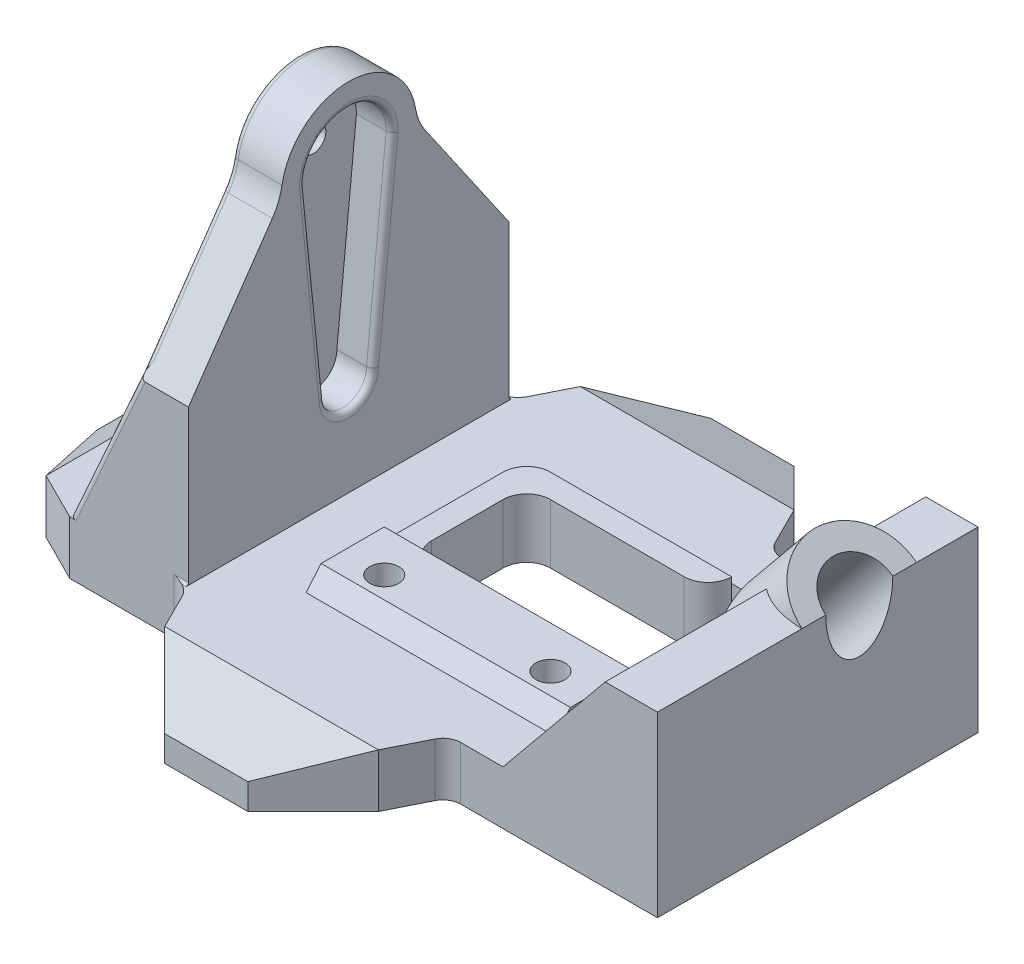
ISO-10303-21;
HEADER;
FILE_DESCRIPTION(('STEP AP214'),'2;1');
FILE_NAME('part.step','',(''),(''),'','','');
FILE_SCHEMA(('AUTOMOTIVE_DESIGN { 1 0 10303 214 1 1 1 1 }'));
ENDSEC;
DATA;
#1=APPLICATION_CONTEXT('core data for automotive mechanical design processes');
#2=APPLICATION_PROTOCOL_DEFINITION('international standard','automotive_design',2000,#1);
#3=PRODUCT_CONTEXT('',#1,'mechanical');
#4=PRODUCT('Part','Part','',(#3));
#5=PRODUCT_RELATED_PRODUCT_CATEGORY('part','',(#4));
#6=PRODUCT_DEFINITION_FORMATION('','',#4);
#7=PRODUCT_DEFINITION_CONTEXT('part definition',#1,'design');
#8=PRODUCT_DEFINITION('design','',#6,#7);
#9=PRODUCT_DEFINITION_SHAPE('','',#8);
#10=(LENGTH_UNIT() NAMED_UNIT(*) SI_UNIT(.MILLI.,.METRE.));
#11=(NAMED_UNIT(*) PLANE_ANGLE_UNIT() SI_UNIT($,.RADIAN.));
#12=(NAMED_UNIT(*) SI_UNIT($,.STERADIAN.) SOLID_ANGLE_UNIT());
#13=UNCERTAINTY_MEASURE_WITH_UNIT(LENGTH_MEASURE(1.E-05),#10,'distance_accuracy_value','');
#14=(GEOMETRIC_REPRESENTATION_CONTEXT(3) GLOBAL_UNCERTAINTY_ASSIGNED_CONTEXT((#13)) GLOBAL_UNIT_ASSIGNED_CONTEXT((#10,
#11,#12)) REPRESENTATION_CONTEXT('',''));
#15=CARTESIAN_POINT('',(0.,0.,0.));
#16=DIRECTION('',(0.,0.,1.));
#17=DIRECTION('',(1.,0.,0.));
#18=AXIS2_PLACEMENT_3D('',#15,#16,#17);
#19=CARTESIAN_POINT('',(0.,4.5,-6.22658348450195));
#20=DIRECTION('',(0.,0.,-1.));
#21=DIRECTION('',(-1.,0.,0.));
#22=AXIS2_PLACEMENT_3D('',#19,#20,#21);
#23=PLANE('',#22);
#24=DIRECTION('',(1.,0.,0.));
#25=VECTOR('',#24,1.);
#26=CARTESIAN_POINT('',(0.,0.,-6.22658348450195));
#27=LINE('',#26,#25);
#28=CARTESIAN_POINT('',(11.7553950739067,0.,-6.22658348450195));
#29=VERTEX_POINT('',#28);
#30=CARTESIAN_POINT('',(17.934026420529,0.,-6.22658348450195));
#31=VERTEX_POINT('',#30);
#32=EDGE_CURVE('E766',#29,#31,#27,.T.);
#33=ORIENTED_EDGE('',*,*,#32,.T.);
#34=DIRECTION('',(0.,-1.,0.));
#35=VECTOR('',#34,1.);
#36=CARTESIAN_POINT('',(17.934026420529,9.91946288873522,-6.22658348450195));
#37=LINE('',#36,#35);
#38=CARTESIAN_POINT('',(17.934026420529,7.4803993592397,-6.22658348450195));
#39=VERTEX_POINT('',#38);
#40=EDGE_CURVE('E758',#31,#39,#37,.F.);
#41=ORIENTED_EDGE('',*,*,#40,.T.);
#42=DIRECTION('',(-0.634073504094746,-0.773272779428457,0.));
#43=VECTOR('',#42,1.);
#44=CARTESIAN_POINT('',(7.05593735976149,-5.78577579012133,-6.22658348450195));
#45=LINE('',#44,#43);
#46=CARTESIAN_POINT('',(15.490138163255,4.5,-6.22658348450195));
#47=VERTEX_POINT('',#46);
#48=EDGE_CURVE('E762',#39,#47,#45,.T.);
#49=ORIENTED_EDGE('',*,*,#48,.T.);
#50=DIRECTION('',(1.,0.,0.));
#51=VECTOR('',#50,1.);
#52=CARTESIAN_POINT('',(0.,4.5,-6.22658348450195));
#53=LINE('',#52,#51);
#54=CARTESIAN_POINT('',(11.7553950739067,4.5,-6.22658348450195));
#55=VERTEX_POINT('',#54);
#56=EDGE_CURVE('E1127',#55,#47,#53,.T.);
#57=ORIENTED_EDGE('',*,*,#56,.F.);
#58=DIRECTION('',(0.,-1.,0.));
#59=VECTOR('',#58,1.);
#60=CARTESIAN_POINT('',(11.7553950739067,5.,-6.22658348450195));
#61=LINE('',#60,#59);
#62=EDGE_CURVE('E2142',#55,#29,#61,.T.);
#63=ORIENTED_EDGE('',*,*,#62,.T.);
#64=EDGE_LOOP('',(#33,#41,#49,#57,#63));
#65=FACE_BOUND('',#64,.T.);
#66=ADVANCED_FACE('F41',(#65),#23,.F.);
#67=CARTESIAN_POINT('',(0.,15.,-10.226583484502));
#68=DIRECTION('',(0.,1.,0.));
#69=DIRECTION('',(0.,0.,1.));
#70=AXIS2_PLACEMENT_3D('',#67,#68,#69);
#71=PLANE('',#70);
#72=DIRECTION('',(0.,0.,1.));
#73=VECTOR('',#72,1.);
#74=CARTESIAN_POINT('',(28.5,15.,-10.226583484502));
#75=LINE('',#74,#73);
#76=CARTESIAN_POINT('',(28.5,15.,4.59841651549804));
#77=VERTEX_POINT('',#76);
#78=CARTESIAN_POINT('',(28.5,15.,16.773416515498));
#79=VERTEX_POINT('',#78);
#80=EDGE_CURVE('E1294',#77,#79,#75,.T.);
#81=ORIENTED_EDGE('',*,*,#80,.F.);
#82=CARTESIAN_POINT('',(28.5,15.,-0.22658348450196));
#83=DIRECTION('',(0.,1.,0.));
#84=DIRECTION('',(1.,0.,0.));
#85=AXIS2_PLACEMENT_3D('',#82,#83,#84);
#86=ELLIPSE('',#85,6.23971272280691,4.825);
#87=CARTESIAN_POINT('',(24.1,15.,3.19457095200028));
#88=VERTEX_POINT('',#87);
#89=EDGE_CURVE('E2164',#77,#88,#86,.F.);
#90=ORIENTED_EDGE('',*,*,#89,.T.);
#91=DIRECTION('',(0.,0.,1.));
#92=VECTOR('',#91,1.);
#93=CARTESIAN_POINT('',(24.1,15.,-10.226583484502));
#94=LINE('',#93,#92);
#95=CARTESIAN_POINT('',(24.1,15.,16.773416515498));
#96=VERTEX_POINT('',#95);
#97=EDGE_CURVE('E1276',#88,#96,#94,.T.);
#98=ORIENTED_EDGE('',*,*,#97,.T.);
#99=DIRECTION('',(-1.,0.,0.));
#100=VECTOR('',#99,1.);
#101=CARTESIAN_POINT('',(0.,15.,16.773416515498));
#102=LINE('',#101,#100);
#103=EDGE_CURVE('E1285',#79,#96,#102,.T.);
#104=ORIENTED_EDGE('',*,*,#103,.F.);
#105=EDGE_LOOP('',(#81,#90,#98,#104));
#106=FACE_BOUND('',#105,.T.);
#107=ADVANCED_FACE('F345',(#106),#71,.T.);
#108=CARTESIAN_POINT('',(24.1,15.,-10.226583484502));
#109=VERTEX_POINT('',#108);
#110=CARTESIAN_POINT('',(24.1,15.,-3.6477379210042));
#111=VERTEX_POINT('',#110);
#112=EDGE_CURVE('E1275',#109,#111,#94,.T.);
#113=ORIENTED_EDGE('',*,*,#112,.T.);
#114=CARTESIAN_POINT('',(28.5,15.,-5.05158348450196));
#115=VERTEX_POINT('',#114);
#116=EDGE_CURVE('E2162',#111,#115,#86,.F.);
#117=ORIENTED_EDGE('',*,*,#116,.T.);
#118=CARTESIAN_POINT('',(28.5,15.,-10.226583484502));
#119=VERTEX_POINT('',#118);
#120=EDGE_CURVE('E548',#119,#115,#75,.T.);
#121=ORIENTED_EDGE('',*,*,#120,.F.);
#122=DIRECTION('',(-1.,0.,0.));
#123=VECTOR('',#122,1.);
#124=CARTESIAN_POINT('',(0.,15.,-10.226583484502));
#125=LINE('',#124,#123);
#126=EDGE_CURVE('E1277',#119,#109,#125,.T.);
#127=ORIENTED_EDGE('',*,*,#126,.T.);
#128=EDGE_LOOP('',(#113,#117,#121,#127));
#129=FACE_BOUND('',#128,.T.);
#130=ADVANCED_FACE('F351',(#129),#71,.T.);
#131=CARTESIAN_POINT('',(7.05593735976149,-5.78577579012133,-10.226583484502));
#132=DIRECTION('',(-0.773272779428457,0.634073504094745,0.));
#133=DIRECTION('',(-0.634073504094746,-0.773272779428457,0.));
#134=AXIS2_PLACEMENT_3D('',#131,#132,#133);
#135=PLANE('',#134);
#136=DIRECTION('',(0.634073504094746,0.773272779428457,0.));
#137=VECTOR('',#136,1.);
#138=CARTESIAN_POINT('',(7.05593735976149,-5.78577579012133,5.77341651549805));
#139=LINE('',#138,#137);
#140=CARTESIAN_POINT('',(15.490138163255,4.5,5.77341651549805));
#141=VERTEX_POINT('',#140);
#142=CARTESIAN_POINT('',(17.934026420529,7.4803993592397,5.77341651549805));
#143=VERTEX_POINT('',#142);
#144=EDGE_CURVE('E779',#141,#143,#139,.T.);
#145=ORIENTED_EDGE('',*,*,#144,.F.);
#146=DIRECTION('',(0.,0.,-1.));
#147=VECTOR('',#146,1.);
#148=CARTESIAN_POINT('',(15.490138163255,4.5,0.));
#149=LINE('',#148,#147);
#150=CARTESIAN_POINT('',(15.490138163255,4.5,12.3538666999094));
#151=VERTEX_POINT('',#150);
#152=EDGE_CURVE('E1091',#151,#141,#149,.T.);
#153=ORIENTED_EDGE('',*,*,#152,.F.);
#154=CARTESIAN_POINT('',(15.490138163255,4.5,16.773416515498));
#155=VERTEX_POINT('',#154);
#156=EDGE_CURVE('E1092',#155,#151,#149,.T.);
#157=ORIENTED_EDGE('',*,*,#156,.F.);
#158=DIRECTION('',(-0.634073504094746,-0.773272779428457,0.));
#159=VECTOR('',#158,1.);
#160=CARTESIAN_POINT('',(7.05593735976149,-5.78577579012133,16.773416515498));
#161=LINE('',#160,#159);
#162=EDGE_CURVE('E1281',#96,#155,#161,.T.);
#163=ORIENTED_EDGE('',*,*,#162,.F.);
#164=ORIENTED_EDGE('',*,*,#97,.F.);
#165=DIRECTION('',(0.634073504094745,0.773272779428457,0.));
#166=VECTOR('',#165,1.);
#167=CARTESIAN_POINT('',(15.0897669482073,4.0117345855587,3.19457095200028));
#168=LINE('',#167,#166);
#169=CARTESIAN_POINT('',(19.934026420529,9.9194628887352,3.19457095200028));
#170=VERTEX_POINT('',#169);
#171=EDGE_CURVE('E888',#88,#170,#168,.F.);
#172=ORIENTED_EDGE('',*,*,#171,.T.);
#173=DIRECTION('',(0.,0.,-1.));
#174=VECTOR('',#173,1.);
#175=CARTESIAN_POINT('',(19.934026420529,9.9194628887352,-10.226583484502));
#176=LINE('',#175,#174);
#177=CARTESIAN_POINT('',(19.934026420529,9.9194628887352,3.77341651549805));
#178=VERTEX_POINT('',#177);
#179=EDGE_CURVE('E2147',#178,#170,#176,.T.);
#180=ORIENTED_EDGE('',*,*,#179,.F.);
#181=CARTESIAN_POINT('',(17.934026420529,7.48039935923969,3.77341651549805));
#182=DIRECTION('',(-0.773272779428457,0.634073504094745,0.));
#183=DIRECTION('',(-0.634073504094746,-0.773272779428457,0.));
#184=AXIS2_PLACEMENT_3D('',#181,#182,#183);
#185=ELLIPSE('',#184,3.15420844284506,2.);
#186=EDGE_CURVE('E786',#178,#143,#185,.F.);
#187=ORIENTED_EDGE('',*,*,#186,.T.);
#188=EDGE_LOOP('',(#145,#153,#157,#163,#164,#172,#180,#187));
#189=FACE_BOUND('',#188,.T.);
#190=ADVANCED_FACE('F1984',(#189),#135,.T.);
#191=DIRECTION('',(0.,0.,-1.));
#192=VECTOR('',#191,1.);
#193=CARTESIAN_POINT('',(19.934026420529,9.9194628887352,-10.226583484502));
#194=LINE('',#193,#192);
#195=CARTESIAN_POINT('',(19.934026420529,9.9194628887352,-3.6477379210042));
#196=VERTEX_POINT('',#195);
#197=CARTESIAN_POINT('',(19.934026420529,9.9194628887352,-4.22658348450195));
#198=VERTEX_POINT('',#197);
#199=EDGE_CURVE('E2145',#196,#198,#194,.T.);
#200=ORIENTED_EDGE('',*,*,#199,.F.);
#201=DIRECTION('',(0.634073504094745,0.773272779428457,0.));
#202=VECTOR('',#201,1.);
#203=CARTESIAN_POINT('',(15.0897669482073,4.0117345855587,-3.6477379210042));
#204=LINE('',#203,#202);
#205=EDGE_CURVE('E891',#196,#111,#204,.T.);
#206=ORIENTED_EDGE('',*,*,#205,.T.);
#207=ORIENTED_EDGE('',*,*,#112,.F.);
#208=DIRECTION('',(-0.634073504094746,-0.773272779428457,0.));
#209=VECTOR('',#208,1.);
#210=CARTESIAN_POINT('',(7.05593735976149,-5.78577579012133,-10.226583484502));
#211=LINE('',#210,#209);
#212=CARTESIAN_POINT('',(15.490138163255,4.5,-10.226583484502));
#213=VERTEX_POINT('',#212);
#214=EDGE_CURVE('E1269',#109,#213,#211,.T.);
#215=ORIENTED_EDGE('',*,*,#214,.T.);
#216=DIRECTION('',(0.,0.,1.));
#217=VECTOR('',#216,1.);
#218=CARTESIAN_POINT('',(15.490138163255,4.5,-10.226583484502));
#219=LINE('',#218,#217);
#220=EDGE_CURVE('E777',#213,#47,#219,.T.);
#221=ORIENTED_EDGE('',*,*,#220,.T.);
#222=ORIENTED_EDGE('',*,*,#48,.F.);
#223=CARTESIAN_POINT('',(17.934026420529,7.4803993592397,-4.22658348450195));
#224=DIRECTION('',(-0.773272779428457,0.634073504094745,0.));
#225=DIRECTION('',(0.634073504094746,0.773272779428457,0.));
#226=AXIS2_PLACEMENT_3D('',#223,#224,#225);
#227=ELLIPSE('',#226,3.15420844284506,2.);
#228=EDGE_CURVE('E774',#39,#198,#227,.F.);
#229=ORIENTED_EDGE('',*,*,#228,.T.);
#230=EDGE_LOOP('',(#200,#206,#207,#215,#221,#222,#229));
#231=FACE_BOUND('',#230,.T.);
#232=ADVANCED_FACE('F363',(#231),#135,.T.);
#233=CARTESIAN_POINT('',(28.5,4.5,0.));
#234=DIRECTION('',(-1.,0.,0.));
#235=DIRECTION('',(0.,0.,1.));
#236=AXIS2_PLACEMENT_3D('',#233,#234,#235);
#237=PLANE('',#236);
#238=CARTESIAN_POINT('',(28.5,15.,-0.22658348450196));
#239=DIRECTION('',(-1.,0.,0.));
#240=DIRECTION('',(0.,1.,0.));
#241=AXIS2_PLACEMENT_3D('',#238,#239,#240);
#242=ELLIPSE('',#241,4.45531942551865,2.825);
#243=CARTESIAN_POINT('',(28.5,15.,2.59841651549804));
#244=VERTEX_POINT('',#243);
#245=CARTESIAN_POINT('',(28.5,15.,-3.05158348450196));
#246=VERTEX_POINT('',#245);
#247=EDGE_CURVE('E1288',#244,#246,#242,.F.);
#248=ORIENTED_EDGE('',*,*,#247,.F.);
#249=EDGE_CURVE('E1293',#244,#77,#75,.T.);
#250=ORIENTED_EDGE('',*,*,#249,.T.);
#251=ORIENTED_EDGE('',*,*,#80,.T.);
#252=DIRECTION('',(0.,-1.,0.));
#253=VECTOR('',#252,1.);
#254=CARTESIAN_POINT('',(28.5,4.5,16.773416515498));
#255=LINE('',#254,#253);
#256=CARTESIAN_POINT('',(28.5,0.,16.773416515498));
#257=VERTEX_POINT('',#256);
#258=EDGE_CURVE('E1194',#79,#257,#255,.T.);
#259=ORIENTED_EDGE('',*,*,#258,.T.);
#260=DIRECTION('',(0.,0.,-1.));
#261=VECTOR('',#260,1.);
#262=CARTESIAN_POINT('',(28.5,0.,0.));
#263=LINE('',#262,#261);
#264=CARTESIAN_POINT('',(28.5,0.,-10.2265834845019));
#265=VERTEX_POINT('',#264);
#266=EDGE_CURVE('E1188',#257,#265,#263,.T.);
#267=ORIENTED_EDGE('',*,*,#266,.T.);
#268=DIRECTION('',(0.,-1.,0.));
#269=VECTOR('',#268,1.);
#270=CARTESIAN_POINT('',(28.5,4.5,-10.2265834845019));
#271=LINE('',#270,#269);
#272=EDGE_CURVE('E1131',#119,#265,#271,.T.);
#273=ORIENTED_EDGE('',*,*,#272,.F.);
#274=ORIENTED_EDGE('',*,*,#120,.T.);
#275=DIRECTION('',(0.,0.,-1.));
#276=VECTOR('',#275,1.);
#277=CARTESIAN_POINT('',(28.5,15.,0.));
#278=LINE('',#277,#276);
#279=EDGE_CURVE('E2154',#246,#115,#278,.T.);
#280=ORIENTED_EDGE('',*,*,#279,.F.);
#281=EDGE_LOOP('',(#248,#250,#251,#259,#267,#273,#274,#280));
#282=FACE_BOUND('',#281,.T.);
#283=ADVANCED_FACE('F359',(#282),#237,.F.);
#284=CARTESIAN_POINT('',(-19.1882155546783,8.56089617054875,-19.726583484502));
#285=DIRECTION('',(-0.913231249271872,0.407441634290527,0.));
#286=DIRECTION('',(-0.407441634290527,-0.913231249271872,0.));
#287=AXIS2_PLACEMENT_3D('',#284,#285,#286);
#288=PLANE('',#287);
#289=DIRECTION('',(0.344675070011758,0.772547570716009,0.533262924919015));
#290=VECTOR('',#289,1.);
#291=CARTESIAN_POINT('',(-19.5602441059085,7.72703907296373,-16.9725211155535));
#292=LINE('',#291,#290);
#293=CARTESIAN_POINT('',(-14.8768244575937,18.224358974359,-9.72658348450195));
#294=VERTEX_POINT('',#293);
#295=CARTESIAN_POINT('',(-14.7,18.6206896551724,-9.45301009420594));
#296=VERTEX_POINT('',#295);
#297=EDGE_CURVE('E533',#294,#296,#292,.T.);
#298=ORIENTED_EDGE('',*,*,#297,.F.);
#299=DIRECTION('',(0.407441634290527,0.913231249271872,0.));
#300=VECTOR('',#299,1.);
#301=CARTESIAN_POINT('',(-19.1882155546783,8.56089617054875,-9.72658348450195));
#302=LINE('',#301,#300);
#303=CARTESIAN_POINT('',(-14.9149722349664,18.1388553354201,-9.72658348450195));
#304=VERTEX_POINT('',#303);
#305=EDGE_CURVE('E581',#294,#304,#302,.F.);
#306=ORIENTED_EDGE('',*,*,#305,.T.);
#307=CARTESIAN_POINT('',(-14.7,18.6206896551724,-8.84546041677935));
#308=DIRECTION('',(-0.913231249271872,0.407441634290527,0.));
#309=DIRECTION('',(-0.3250383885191,-0.728534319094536,-0.602982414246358));
#310=AXIS2_PLACEMENT_3D('',#307,#308,#309);
#311=ELLIPSE('',#310,1.4911330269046,0.5);
#312=EDGE_CURVE('E540',#304,#296,#311,.F.);
#313=ORIENTED_EDGE('',*,*,#312,.T.);
#314=EDGE_LOOP('',(#298,#306,#313));
#315=FACE_BOUND('',#314,.T.);
#316=ADVANCED_FACE('F362',(#315),#288,.T.);
#317=DIRECTION('',(0.,0.,1.));
#318=VECTOR('',#317,1.);
#319=CARTESIAN_POINT('',(-20.9999999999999,4.5,0.));
#320=LINE('',#319,#318);
#321=CARTESIAN_POINT('',(-21.,4.5,5.31468411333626));
#322=VERTEX_POINT('',#321);
#323=CARTESIAN_POINT('',(-21.,4.5,16.273416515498));
#324=VERTEX_POINT('',#323);
#325=EDGE_CURVE('E56',#322,#324,#320,.T.);
#326=ORIENTED_EDGE('',*,*,#325,.T.);
#327=DIRECTION('',(-0.407441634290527,-0.913231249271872,0.));
#328=VECTOR('',#327,1.);
#329=CARTESIAN_POINT('',(-15.2,17.5,16.273416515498));
#330=LINE('',#329,#328);
#331=CARTESIAN_POINT('',(-15.1895141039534,17.5235028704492,16.273416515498));
#332=VERTEX_POINT('',#331);
#333=EDGE_CURVE('E566',#324,#332,#330,.F.);
#334=ORIENTED_EDGE('',*,*,#333,.T.);
#335=CARTESIAN_POINT('',(-14.7,18.6206896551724,15.3922934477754));
#336=DIRECTION('',(-0.913231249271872,0.407441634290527,0.));
#337=DIRECTION('',(0.3250383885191,0.728534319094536,-0.602982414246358));
#338=AXIS2_PLACEMENT_3D('',#335,#336,#337);
#339=ELLIPSE('',#338,1.4911330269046,0.5);
#340=CARTESIAN_POINT('',(-15.2,17.5,16.1658668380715));
#341=VERTEX_POINT('',#340);
#342=EDGE_CURVE('E536',#332,#341,#339,.F.);
#343=ORIENTED_EDGE('',*,*,#342,.T.);
#344=DIRECTION('',(0.,0.,1.));
#345=VECTOR('',#344,1.);
#346=CARTESIAN_POINT('',(-15.2,17.5,-19.726583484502));
#347=LINE('',#346,#345);
#348=CARTESIAN_POINT('',(-15.2,17.5,8.27341651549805));
#349=VERTEX_POINT('',#348);
#350=EDGE_CURVE('E1054',#349,#341,#347,.T.);
#351=ORIENTED_EDGE('',*,*,#350,.F.);
#352=DIRECTION('',(0.407441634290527,0.913231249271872,0.));
#353=VECTOR('',#352,1.);
#354=CARTESIAN_POINT('',(-19.1882155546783,8.56089617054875,8.27341651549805));
#355=LINE('',#354,#353);
#356=CARTESIAN_POINT('',(-15.9440659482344,15.8322659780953,8.27341651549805));
#357=VERTEX_POINT('',#356);
#358=EDGE_CURVE('E155',#357,#349,#355,.T.);
#359=ORIENTED_EDGE('',*,*,#358,.F.);
#360=DIRECTION('',(0.402250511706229,0.901595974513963,0.159120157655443));
#361=VECTOR('',#360,1.);
#362=CARTESIAN_POINT('',(-20.3512098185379,5.95418488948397,6.53006154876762));
#363=LINE('',#362,#361);
#364=CARTESIAN_POINT('',(-19.2124573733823,8.5065610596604,6.9805232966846));
#365=VERTEX_POINT('',#364);
#366=EDGE_CURVE('E143',#357,#365,#363,.F.);
#367=ORIENTED_EDGE('',*,*,#366,.T.);
#368=DIRECTION('',(-0.380907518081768,-0.853758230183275,-0.354973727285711));
#369=VECTOR('',#368,1.);
#370=CARTESIAN_POINT('',(-13.0040104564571,22.4220455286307,12.7662729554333));
#371=LINE('',#370,#369);
#372=EDGE_CURVE('E13',#365,#322,#371,.T.);
#373=ORIENTED_EDGE('',*,*,#372,.T.);
#374=EDGE_LOOP('',(#326,#334,#343,#351,#359,#367,#373));
#375=FACE_BOUND('',#374,.T.);
#376=ADVANCED_FACE('F147',(#375),#288,.T.);
#377=CARTESIAN_POINT('',(-15.2,0.,-19.726583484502));
#378=DIRECTION('',(-1.,0.,0.));
#379=DIRECTION('',(0.,0.,1.));
#380=AXIS2_PLACEMENT_3D('',#377,#378,#379);
#381=PLANE('',#380);
#382=CARTESIAN_POINT('',(-15.2,28.8,3.27341651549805));
#383=DIRECTION('',(-1.,0.,0.));
#384=DIRECTION('',(0.,0.,1.));
#385=AXIS2_PLACEMENT_3D('',#382,#383,#384);
#386=CIRCLE('',#385,1.07);
#387=CARTESIAN_POINT('',(-15.2,28.8,4.34341651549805));
#388=VERTEX_POINT('',#387);
#389=EDGE_CURVE('E1036',#388,#388,#386,.T.);
#390=ORIENTED_EDGE('',*,*,#389,.F.);
#391=EDGE_LOOP('',(#390));
#392=FACE_BOUND('',#391,.T.);
#393=ORIENTED_EDGE('',*,*,#350,.T.);
#394=DIRECTION('',(0.,-0.822977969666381,0.568073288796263));
#395=VECTOR('',#394,1.);
#396=CARTESIAN_POINT('',(-15.2,27.4477780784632,9.29925896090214));
#397=LINE('',#396,#395);
#398=CARTESIAN_POINT('',(-15.2,27.4477780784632,9.29925896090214));
#399=VERTEX_POINT('',#398);
#400=EDGE_CURVE('E518',#341,#399,#397,.F.);
#401=ORIENTED_EDGE('',*,*,#400,.T.);
#402=CARTESIAN_POINT('',(-15.2,30.5721811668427,13.8256377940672));
#403=DIRECTION('',(-1.,0.,0.));
#404=DIRECTION('',(0.,0.,1.));
#405=AXIS2_PLACEMENT_3D('',#402,#403,#404);
#406=CIRCLE('',#405,5.5);
#407=CARTESIAN_POINT('',(-15.2,29.6612469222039,8.40159881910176));
#408=VERTEX_POINT('',#407);
#409=EDGE_CURVE('E515',#399,#408,#406,.F.);
#410=ORIENTED_EDGE('',*,*,#409,.T.);
#411=CARTESIAN_POINT('',(-15.2,28.8,3.27341651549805));
#412=DIRECTION('',(-1.,0.,0.));
#413=DIRECTION('',(0.,0.,1.));
#414=AXIS2_PLACEMENT_3D('',#411,#412,#413);
#415=CIRCLE('',#414,5.2);
#416=CARTESIAN_POINT('',(-15.2,29.6612469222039,-1.85476578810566));
#417=VERTEX_POINT('',#416);
#418=EDGE_CURVE('E512',#408,#417,#415,.T.);
#419=ORIENTED_EDGE('',*,*,#418,.T.);
#420=CARTESIAN_POINT('',(-15.2,30.5721811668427,-7.27880476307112));
#421=DIRECTION('',(-1.,0.,0.));
#422=DIRECTION('',(0.,0.,1.));
#423=AXIS2_PLACEMENT_3D('',#420,#421,#422);
#424=CIRCLE('',#423,5.5);
#425=CARTESIAN_POINT('',(-15.2,27.4477780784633,-2.75242592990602));
#426=VERTEX_POINT('',#425);
#427=EDGE_CURVE('E509',#417,#426,#424,.F.);
#428=ORIENTED_EDGE('',*,*,#427,.T.);
#429=DIRECTION('',(0.,-0.82297796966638,-0.568073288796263));
#430=VECTOR('',#429,1.);
#431=CARTESIAN_POINT('',(-15.2,0.921978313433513,-21.0622700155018));
#432=LINE('',#431,#430);
#433=CARTESIAN_POINT('',(-15.2,17.5,-9.61903380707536));
#434=VERTEX_POINT('',#433);
#435=EDGE_CURVE('E506',#426,#434,#432,.T.);
#436=ORIENTED_EDGE('',*,*,#435,.T.);
#437=CARTESIAN_POINT('',(-15.2,17.5,-1.72658348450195));
#438=VERTEX_POINT('',#437);
#439=EDGE_CURVE('E903',#434,#438,#347,.T.);
#440=ORIENTED_EDGE('',*,*,#439,.T.);
#441=DIRECTION('',(0.,1.,0.));
#442=VECTOR('',#441,1.);
#443=CARTESIAN_POINT('',(-15.2,4.5,-1.72658348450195));
#444=LINE('',#443,#442);
#445=CARTESIAN_POINT('',(-15.2,18.6545850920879,-1.72658348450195));
#446=VERTEX_POINT('',#445);
#447=EDGE_CURVE('E1303',#438,#446,#444,.T.);
#448=ORIENTED_EDGE('',*,*,#447,.T.);
#449=DIRECTION('',(0.,0.969008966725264,0.247025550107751));
#450=VECTOR('',#449,1.);
#451=CARTESIAN_POINT('',(-15.2,26.5,0.273416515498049));
#452=LINE('',#451,#450);
#453=CARTESIAN_POINT('',(-15.2,23.7262269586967,-0.433690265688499));
#454=VERTEX_POINT('',#453);
#455=EDGE_CURVE('E116',#446,#454,#452,.T.);
#456=ORIENTED_EDGE('',*,*,#455,.T.);
#457=DIRECTION('',(0.,-0.857278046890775,-0.51485371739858));
#458=VECTOR('',#457,1.);
#459=CARTESIAN_POINT('',(-15.2,26.5,1.23214891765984));
#460=LINE('',#459,#458);
#461=CARTESIAN_POINT('',(-15.2,26.5,1.23214891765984));
#462=VERTEX_POINT('',#461);
#463=EDGE_CURVE('E106',#454,#462,#460,.F.);
#464=ORIENTED_EDGE('',*,*,#463,.T.);
#465=DIRECTION('',(0.,0.,1.));
#466=VECTOR('',#465,1.);
#467=CARTESIAN_POINT('',(-15.2,26.5,-1.72658348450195));
#468=LINE('',#467,#466);
#469=CARTESIAN_POINT('',(-15.2,26.5,5.31468411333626));
#470=VERTEX_POINT('',#469);
#471=EDGE_CURVE('E138',#462,#470,#468,.T.);
#472=ORIENTED_EDGE('',*,*,#471,.T.);
#473=DIRECTION('',(0.,-0.857278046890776,0.51485371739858));
#474=VECTOR('',#473,1.);
#475=CARTESIAN_POINT('',(-15.2,26.5,5.31468411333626));
#476=LINE('',#475,#474);
#477=CARTESIAN_POINT('',(-15.2,23.7262269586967,6.9805232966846));
#478=VERTEX_POINT('',#477);
#479=EDGE_CURVE('E49',#470,#478,#476,.T.);
#480=ORIENTED_EDGE('',*,*,#479,.T.);
#481=DIRECTION('',(0.,0.969008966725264,-0.24702555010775));
#482=VECTOR('',#481,1.);
#483=CARTESIAN_POINT('',(-15.2,5.79487825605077,11.551689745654));
#484=LINE('',#483,#482);
#485=CARTESIAN_POINT('',(-15.2,18.6545850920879,8.27341651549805));
#486=VERTEX_POINT('',#485);
#487=EDGE_CURVE('E135',#478,#486,#484,.F.);
#488=ORIENTED_EDGE('',*,*,#487,.T.);
#489=DIRECTION('',(0.,1.,0.));
#490=VECTOR('',#489,1.);
#491=CARTESIAN_POINT('',(-15.2,4.5,8.27341651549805));
#492=LINE('',#491,#490);
#493=EDGE_CURVE('E955',#349,#486,#492,.T.);
#494=ORIENTED_EDGE('',*,*,#493,.F.);
#495=EDGE_LOOP('',(#393,#401,#410,#419,#428,#436,#440,#448,#456,#464,#472,#480,#488,#494));
#496=FACE_BOUND('',#495,.T.);
#497=ADVANCED_FACE('F132',(#392,#496),#381,.T.);
#498=CARTESIAN_POINT('',(-15.1895141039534,17.5235028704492,-9.72658348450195));
#499=VERTEX_POINT('',#498);
#500=EDGE_CURVE('E541',#434,#499,#311,.F.);
#501=ORIENTED_EDGE('',*,*,#500,.T.);
#502=DIRECTION('',(0.407441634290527,0.913231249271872,0.));
#503=VECTOR('',#502,1.);
#504=CARTESIAN_POINT('',(-19.1882155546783,8.56089617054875,-9.72658348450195));
#505=LINE('',#504,#503);
#506=CARTESIAN_POINT('',(-20.9999999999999,4.5,-9.72658348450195));
#507=VERTEX_POINT('',#506);
#508=EDGE_CURVE('E580',#499,#507,#505,.F.);
#509=ORIENTED_EDGE('',*,*,#508,.T.);
#510=CARTESIAN_POINT('',(-20.9999999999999,4.5,1.23214891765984));
#511=VERTEX_POINT('',#510);
#512=EDGE_CURVE('E79',#507,#511,#320,.T.);
#513=ORIENTED_EDGE('',*,*,#512,.T.);
#514=DIRECTION('',(-0.380907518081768,-0.853758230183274,0.354973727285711));
#515=VECTOR('',#514,1.);
#516=CARTESIAN_POINT('',(-13.0040104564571,22.4220455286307,-6.21943992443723));
#517=LINE('',#516,#515);
#518=CARTESIAN_POINT('',(-19.2124573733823,8.50656105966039,-0.433690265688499));
#519=VERTEX_POINT('',#518);
#520=EDGE_CURVE('E94',#511,#519,#517,.F.);
#521=ORIENTED_EDGE('',*,*,#520,.T.);
#522=DIRECTION('',(0.402250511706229,0.901595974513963,-0.159120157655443));
#523=VECTOR('',#522,1.);
#524=CARTESIAN_POINT('',(-12.0828445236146,24.4867277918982,-3.25398529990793));
#525=LINE('',#524,#523);
#526=CARTESIAN_POINT('',(-15.9440659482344,15.8322659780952,-1.72658348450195));
#527=VERTEX_POINT('',#526);
#528=EDGE_CURVE('E100',#519,#527,#525,.T.);
#529=ORIENTED_EDGE('',*,*,#528,.T.);
#530=DIRECTION('',(0.407441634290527,0.913231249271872,0.));
#531=VECTOR('',#530,1.);
#532=CARTESIAN_POINT('',(-19.1882155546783,8.56089617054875,-1.72658348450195));
#533=LINE('',#532,#531);
#534=EDGE_CURVE('E929',#527,#438,#533,.T.);
#535=ORIENTED_EDGE('',*,*,#534,.T.);
#536=ORIENTED_EDGE('',*,*,#439,.F.);
#537=EDGE_LOOP('',(#501,#509,#513,#521,#529,#535,#536));
#538=FACE_BOUND('',#537,.T.);
#539=ADVANCED_FACE('F97',(#538),#288,.T.);
#540=CARTESIAN_POINT('',(11.6116776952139,4.5,-11.6223645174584));
#541=DIRECTION('',(0.706781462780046,0.,-0.707431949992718));
#542=DIRECTION('',(-0.707431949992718,0.,-0.706781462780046));
#543=AXIS2_PLACEMENT_3D('',#540,#541,#542);
#544=PLANE('',#543);
#545=DIRECTION('',(0.,-1.,0.));
#546=VECTOR('',#545,1.);
#547=CARTESIAN_POINT('',(3.5,4.5,-19.7265834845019));
#548=LINE('',#547,#546);
#549=CARTESIAN_POINT('',(3.5,2.18,-19.7265834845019));
#550=VERTEX_POINT('',#549);
#551=CARTESIAN_POINT('',(3.5,0.,-19.7265834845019));
#552=VERTEX_POINT('',#551);
#553=EDGE_CURVE('E922',#550,#552,#548,.T.);
#554=ORIENTED_EDGE('',*,*,#553,.F.);
#555=DIRECTION('',(0.677944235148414,0.285706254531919,0.677320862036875));
#556=VECTOR('',#555,1.);
#557=CARTESIAN_POINT('',(11.3989046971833,5.50883791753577,-11.8349418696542));
#558=LINE('',#557,#556);
#559=CARTESIAN_POINT('',(9.00506193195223,4.5,-14.226583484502));
#560=VERTEX_POINT('',#559);
#561=EDGE_CURVE('E1253',#550,#560,#558,.T.);
#562=ORIENTED_EDGE('',*,*,#561,.T.);
#563=DIRECTION('',(0.,-1.,0.));
#564=VECTOR('',#563,1.);
#565=CARTESIAN_POINT('',(9.00506193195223,4.5,-14.226583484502));
#566=LINE('',#565,#564);
#567=CARTESIAN_POINT('',(9.00506193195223,0.,-14.226583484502));
#568=VERTEX_POINT('',#567);
#569=EDGE_CURVE('E917',#560,#568,#566,.T.);
#570=ORIENTED_EDGE('',*,*,#569,.T.);
#571=DIRECTION('',(0.707431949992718,0.,0.706781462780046));
#572=VECTOR('',#571,1.);
#573=CARTESIAN_POINT('',(11.6116776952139,0.,-11.6223645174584));
#574=LINE('',#573,#572);
#575=EDGE_CURVE('E1137',#552,#568,#574,.T.);
#576=ORIENTED_EDGE('',*,*,#575,.F.);
#577=EDGE_LOOP('',(#554,#562,#570,#576));
#578=FACE_BOUND('',#577,.T.);
#579=ADVANCED_FACE('F432',(#578),#544,.T.);
#580=CARTESIAN_POINT('',(0.,4.5,-19.726583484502));
#581=DIRECTION('',(0.,0.,1.));
#582=DIRECTION('',(1.,0.,0.));
#583=AXIS2_PLACEMENT_3D('',#580,#581,#582);
#584=PLANE('',#583);
#585=DIRECTION('',(1.,0.,0.));
#586=VECTOR('',#585,1.);
#587=CARTESIAN_POINT('',(-28.5,2.18,-19.7265834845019));
#588=LINE('',#587,#586);
#589=CARTESIAN_POINT('',(-3.50000000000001,2.18,-19.7265834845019));
#590=VERTEX_POINT('',#589);
#591=EDGE_CURVE('E1241',#590,#550,#588,.T.);
#592=ORIENTED_EDGE('',*,*,#591,.T.);
#593=ORIENTED_EDGE('',*,*,#553,.T.);
#594=DIRECTION('',(-1.,0.,0.));
#595=VECTOR('',#594,1.);
#596=CARTESIAN_POINT('',(0.,0.,-19.726583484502));
#597=LINE('',#596,#595);
#598=CARTESIAN_POINT('',(-3.5,0.,-19.726583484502));
#599=VERTEX_POINT('',#598);
#600=EDGE_CURVE('E1140',#552,#599,#597,.T.);
#601=ORIENTED_EDGE('',*,*,#600,.T.);
#602=DIRECTION('',(0.,-1.,0.));
#603=VECTOR('',#602,1.);
#604=CARTESIAN_POINT('',(-3.5,4.5,-19.726583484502));
#605=LINE('',#604,#603);
#606=EDGE_CURVE('E1230',#590,#599,#605,.T.);
#607=ORIENTED_EDGE('',*,*,#606,.F.);
#608=EDGE_LOOP('',(#592,#593,#601,#607));
#609=FACE_BOUND('',#608,.T.);
#610=ADVANCED_FACE('F428',(#609),#584,.F.);
#611=CARTESIAN_POINT('',(-11.613291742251,4.5,-11.613291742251));
#612=DIRECTION('',(-0.707106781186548,0.,-0.707106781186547));
#613=DIRECTION('',(-0.707106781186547,0.,0.707106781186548));
#614=AXIS2_PLACEMENT_3D('',#611,#612,#613);
#615=PLANE('',#614);
#616=DIRECTION('',(0.,-1.,0.));
#617=VECTOR('',#616,1.);
#618=CARTESIAN_POINT('',(-9.,4.5,-14.226583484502));
#619=LINE('',#618,#617);
#620=CARTESIAN_POINT('',(-9.,4.5,-14.226583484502));
#621=VERTEX_POINT('',#620);
#622=CARTESIAN_POINT('',(-9.,0.,-14.226583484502));
#623=VERTEX_POINT('',#622);
#624=EDGE_CURVE('E1227',#621,#623,#619,.T.);
#625=ORIENTED_EDGE('',*,*,#624,.F.);
#626=DIRECTION('',(0.677607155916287,-0.285827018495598,-0.677607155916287));
#627=VECTOR('',#626,1.);
#628=CARTESIAN_POINT('',(-11.3997934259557,5.51227649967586,-11.8267900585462));
#629=LINE('',#628,#627);
#630=EDGE_CURVE('E1313',#621,#590,#629,.T.);
#631=ORIENTED_EDGE('',*,*,#630,.T.);
#632=ORIENTED_EDGE('',*,*,#606,.T.);
#633=DIRECTION('',(0.707106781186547,0.,-0.707106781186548));
#634=VECTOR('',#633,1.);
#635=CARTESIAN_POINT('',(-11.613291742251,0.,-11.613291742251));
#636=LINE('',#635,#634);
#637=EDGE_CURVE('E1143',#623,#599,#636,.T.);
#638=ORIENTED_EDGE('',*,*,#637,.F.);
#639=EDGE_LOOP('',(#625,#631,#632,#638));
#640=FACE_BOUND('',#639,.T.);
#641=ADVANCED_FACE('F424',(#640),#615,.T.);
#642=CARTESIAN_POINT('',(0.,4.5,0.));
#643=DIRECTION('',(0.,1.,0.));
#644=DIRECTION('',(0.,0.,1.));
#645=AXIS2_PLACEMENT_3D('',#642,#643,#644);
#646=PLANE('',#645);
#647=ORIENTED_EDGE('',*,*,#220,.F.);
#648=DIRECTION('',(1.,0.,0.));
#649=VECTOR('',#648,1.);
#650=CARTESIAN_POINT('',(0.,4.5,-10.2265834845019));
#651=LINE('',#650,#649);
#652=CARTESIAN_POINT('',(11.928101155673,4.5,-10.2265834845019));
#653=VERTEX_POINT('',#652);
#654=EDGE_CURVE('E1103',#653,#213,#651,.T.);
#655=ORIENTED_EDGE('',*,*,#654,.F.);
#656=CARTESIAN_POINT('',(11.928101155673,4.5,-11.7265834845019));
#657=DIRECTION('',(0.,1.,0.));
#658=DIRECTION('',(0.,0.,1.));
#659=AXIS2_PLACEMENT_3D('',#656,#657,#658);
#660=CIRCLE('',#659,1.5);
#661=CARTESIAN_POINT('',(10.5857815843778,4.5,-11.0571223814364));
#662=VERTEX_POINT('',#661);
#663=EDGE_CURVE('E871',#653,#662,#660,.F.);
#664=ORIENTED_EDGE('',*,*,#663,.T.);
#665=DIRECTION('',(0.44630740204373,0.,0.894879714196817));
#666=VECTOR('',#665,1.);
#667=CARTESIAN_POINT('',(12.8933166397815,4.5,-6.43034204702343));
#668=LINE('',#667,#666);
#669=EDGE_CURVE('E1106',#560,#662,#668,.T.);
#670=ORIENTED_EDGE('',*,*,#669,.F.);
#671=DIRECTION('',(-1.,0.,0.));
#672=VECTOR('',#671,1.);
#673=CARTESIAN_POINT('',(0.,4.5,-14.226583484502));
#674=LINE('',#673,#672);
#675=EDGE_CURVE('E916',#560,#621,#674,.T.);
#676=ORIENTED_EDGE('',*,*,#675,.T.);
#677=DIRECTION('',(-0.44721359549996,0.,0.894427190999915));
#678=VECTOR('',#677,1.);
#679=CARTESIAN_POINT('',(-12.8906333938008,4.5,-6.44531669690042));
#680=LINE('',#679,#678);
#681=CARTESIAN_POINT('',(-10.4472135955,4.5,-11.332156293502));
#682=VERTEX_POINT('',#681);
#683=EDGE_CURVE('E484',#621,#682,#680,.T.);
#684=ORIENTED_EDGE('',*,*,#683,.T.);
#685=CARTESIAN_POINT('',(-12.2360679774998,4.5,-12.2265834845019));
#686=DIRECTION('',(0.,1.,0.));
#687=DIRECTION('',(0.,0.,1.));
#688=AXIS2_PLACEMENT_3D('',#685,#686,#687);
#689=CIRCLE('',#688,2.);
#690=CARTESIAN_POINT('',(-11.3642881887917,4.5,-10.426583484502));
#691=VERTEX_POINT('',#690);
#692=EDGE_CURVE('E173',#682,#691,#689,.F.);
#693=ORIENTED_EDGE('',*,*,#692,.T.);
#694=DIRECTION('',(-1.,0.,0.));
#695=VECTOR('',#694,1.);
#696=CARTESIAN_POINT('',(-11.,4.5,-10.426583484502));
#697=LINE('',#696,#695);
#698=CARTESIAN_POINT('',(-11.,4.5,-10.426583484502));
#699=VERTEX_POINT('',#698);
#700=EDGE_CURVE('E185',#691,#699,#697,.F.);
#701=ORIENTED_EDGE('',*,*,#700,.T.);
#702=DIRECTION('',(0.,0.,-1.));
#703=VECTOR('',#702,1.);
#704=CARTESIAN_POINT('',(-11.,4.5,0.));
#705=LINE('',#704,#703);
#706=CARTESIAN_POINT('',(-11.,4.5,16.973416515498));
#707=VERTEX_POINT('',#706);
#708=EDGE_CURVE('E1068',#707,#699,#705,.T.);
#709=ORIENTED_EDGE('',*,*,#708,.F.);
#710=DIRECTION('',(1.,0.,0.));
#711=VECTOR('',#710,1.);
#712=CARTESIAN_POINT('',(0.,4.5,16.973416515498));
#713=LINE('',#712,#711);
#714=CARTESIAN_POINT('',(-11.3642881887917,4.5,16.973416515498));
#715=VERTEX_POINT('',#714);
#716=EDGE_CURVE('E188',#707,#715,#713,.F.);
#717=ORIENTED_EDGE('',*,*,#716,.T.);
#718=CARTESIAN_POINT('',(-12.2360679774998,4.5,18.773416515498));
#719=DIRECTION('',(0.,1.,0.));
#720=DIRECTION('',(0.,0.,1.));
#721=AXIS2_PLACEMENT_3D('',#718,#719,#720);
#722=CIRCLE('',#721,2.);
#723=CARTESIAN_POINT('',(-10.4472135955,4.5,17.8789893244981));
#724=VERTEX_POINT('',#723);
#725=EDGE_CURVE('E179',#715,#724,#722,.F.);
#726=ORIENTED_EDGE('',*,*,#725,.T.);
#727=DIRECTION('',(-0.447213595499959,0.,-0.894427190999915));
#728=VECTOR('',#727,1.);
#729=CARTESIAN_POINT('',(-15.5093666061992,4.5,7.75468330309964));
#730=LINE('',#729,#728);
#731=CARTESIAN_POINT('',(-8.99999999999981,4.50000000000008,20.7734165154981));
#732=VERTEX_POINT('',#731);
#733=EDGE_CURVE('E1115',#732,#724,#730,.T.);
#734=ORIENTED_EDGE('',*,*,#733,.F.);
#735=DIRECTION('',(-1.,0.,0.));
#736=VECTOR('',#735,1.);
#737=CARTESIAN_POINT('',(0.,4.5,20.7734165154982));
#738=LINE('',#737,#736);
#739=CARTESIAN_POINT('',(9.00506193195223,4.5,20.7734165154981));
#740=VERTEX_POINT('',#739);
#741=EDGE_CURVE('E919',#740,#732,#738,.T.);
#742=ORIENTED_EDGE('',*,*,#741,.F.);
#743=DIRECTION('',(0.446307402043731,0.,-0.894879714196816));
#744=VECTOR('',#743,1.);
#745=CARTESIAN_POINT('',(15.50806571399,4.5,7.73440766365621));
#746=LINE('',#745,#744);
#747=CARTESIAN_POINT('',(10.5857815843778,4.5,17.6039554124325));
#748=VERTEX_POINT('',#747);
#749=EDGE_CURVE('E1118',#740,#748,#746,.T.);
#750=ORIENTED_EDGE('',*,*,#749,.T.);
#751=CARTESIAN_POINT('',(11.928101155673,4.5,18.2734165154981));
#752=DIRECTION('',(0.,1.,0.));
#753=DIRECTION('',(0.,0.,1.));
#754=AXIS2_PLACEMENT_3D('',#751,#752,#753);
#755=CIRCLE('',#754,1.5);
#756=CARTESIAN_POINT('',(11.928101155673,4.5,16.773416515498));
#757=VERTEX_POINT('',#756);
#758=EDGE_CURVE('E867',#748,#757,#755,.F.);
#759=ORIENTED_EDGE('',*,*,#758,.T.);
#760=DIRECTION('',(1.,0.,0.));
#761=VECTOR('',#760,1.);
#762=CARTESIAN_POINT('',(0.,4.5,16.773416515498));
#763=LINE('',#762,#761);
#764=EDGE_CURVE('E1121',#757,#155,#763,.T.);
#765=ORIENTED_EDGE('',*,*,#764,.T.);
#766=ORIENTED_EDGE('',*,*,#156,.T.);
#767=DIRECTION('',(-1.,0.,0.));
#768=VECTOR('',#767,1.);
#769=CARTESIAN_POINT('',(0.,4.5,12.3538666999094));
#770=LINE('',#769,#768);
#771=CARTESIAN_POINT('',(-5.50986183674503,4.5,12.3538666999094));
#772=VERTEX_POINT('',#771);
#773=EDGE_CURVE('E796',#151,#772,#770,.T.);
#774=ORIENTED_EDGE('',*,*,#773,.T.);
#775=DIRECTION('',(0.,0.,1.));
#776=VECTOR('',#775,1.);
#777=CARTESIAN_POINT('',(-5.50986183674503,4.5,0.));
#778=LINE('',#777,#776);
#779=CARTESIAN_POINT('',(-5.50986183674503,4.5,-4.22658348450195));
#780=VERTEX_POINT('',#779);
#781=EDGE_CURVE('E1124',#780,#772,#778,.T.);
#782=ORIENTED_EDGE('',*,*,#781,.F.);
#783=CARTESIAN_POINT('',(-3.50986183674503,4.5,-4.22658348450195));
#784=DIRECTION('',(0.,1.,0.));
#785=DIRECTION('',(0.,0.,1.));
#786=AXIS2_PLACEMENT_3D('',#783,#784,#785);
#787=CIRCLE('',#786,2.);
#788=CARTESIAN_POINT('',(-3.50986183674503,4.5,-6.22658348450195));
#789=VERTEX_POINT('',#788);
#790=EDGE_CURVE('E832',#780,#789,#787,.F.);
#791=ORIENTED_EDGE('',*,*,#790,.T.);
#792=EDGE_CURVE('E1128',#789,#55,#53,.T.);
#793=ORIENTED_EDGE('',*,*,#792,.T.);
#794=ORIENTED_EDGE('',*,*,#56,.T.);
#795=EDGE_LOOP('',(#647,#655,#664,#670,#676,#684,#693,#701,#709,#717,#726,#734,#742,#750,#759,
#765,#766,#774,#782,#791,#793,#794));
#796=FACE_BOUND('',#795,.T.);
#797=ADVANCED_FACE('F427',(#796),#646,.T.);
#798=CARTESIAN_POINT('',(-11.,34.5,0.));
#799=DIRECTION('',(1.,0.,0.));
#800=DIRECTION('',(0.,0.,-1.));
#801=AXIS2_PLACEMENT_3D('',#798,#799,#800);
#802=PLANE('',#801);
#803=DIRECTION('',(0.,0.994946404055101,-0.100407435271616));
#804=VECTOR('',#803,1.);
#805=CARTESIAN_POINT('',(-11.,12.3997962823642,0.775943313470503));
#806=LINE('',#805,#804);
#807=CARTESIAN_POINT('',(-11.,28.774029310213,-0.876502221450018));
#808=VERTEX_POINT('',#807);
#809=CARTESIAN_POINT('',(-11.,12.4234360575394,0.773557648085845));
#810=VERTEX_POINT('',#809);
#811=EDGE_CURVE('E827',#808,#810,#806,.F.);
#812=ORIENTED_EDGE('',*,*,#811,.T.);
#813=CARTESIAN_POINT('',(-11.,12.45,3.27341651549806));
#814=DIRECTION('',(1.,0.,0.));
#815=DIRECTION('',(0.,0.,-1.));
#816=AXIS2_PLACEMENT_3D('',#813,#814,#815);
#817=CIRCLE('',#816,2.50000000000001);
#818=CARTESIAN_POINT('',(-11.,12.4234360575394,5.77327538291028));
#819=VERTEX_POINT('',#818);
#820=EDGE_CURVE('E820',#810,#819,#817,.F.);
#821=ORIENTED_EDGE('',*,*,#820,.T.);
#822=DIRECTION('',(0.,0.994946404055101,0.100407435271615));
#823=VECTOR('',#822,1.);
#824=CARTESIAN_POINT('',(-11.,33.7006814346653,7.92052032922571));
#825=LINE('',#824,#823);
#826=CARTESIAN_POINT('',(-11.,28.774029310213,7.42333525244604));
#827=VERTEX_POINT('',#826);
#828=EDGE_CURVE('E823',#819,#827,#825,.T.);
#829=ORIENTED_EDGE('',*,*,#828,.T.);
#830=CARTESIAN_POINT('',(-11.,28.8,3.27341651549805));
#831=DIRECTION('',(1.,0.,0.));
#832=DIRECTION('',(0.,0.,-1.));
#833=AXIS2_PLACEMENT_3D('',#830,#831,#832);
#834=CIRCLE('',#833,4.15);
#835=EDGE_CURVE('E825',#827,#808,#834,.F.);
#836=ORIENTED_EDGE('',*,*,#835,.T.);
#837=EDGE_LOOP('',(#812,#821,#829,#836));
#838=FACE_BOUND('',#837,.T.);
#839=DIRECTION('',(0.,0.822977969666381,0.568073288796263));
#840=VECTOR('',#839,1.);
#841=CARTESIAN_POINT('',(-11.,10.4284255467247,-15.1078472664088));
#842=LINE('',#841,#840);
#843=CARTESIAN_POINT('',(-11.,17.5,-10.226583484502));
#844=VERTEX_POINT('',#843);
#845=CARTESIAN_POINT('',(-11.,27.7318147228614,-3.16391491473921));
#846=VERTEX_POINT('',#845);
#847=EDGE_CURVE('E915',#844,#846,#842,.T.);
#848=ORIENTED_EDGE('',*,*,#847,.T.);
#849=CARTESIAN_POINT('',(-11.,30.5721811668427,-7.27880476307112));
#850=DIRECTION('',(1.,0.,0.));
#851=DIRECTION('',(0.,0.,-1.));
#852=AXIS2_PLACEMENT_3D('',#849,#850,#851);
#853=CIRCLE('',#852,5.);
#854=CARTESIAN_POINT('',(-11.,29.744059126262,-2.34786024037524));
#855=VERTEX_POINT('',#854);
#856=EDGE_CURVE('E945',#846,#855,#853,.F.);
#857=ORIENTED_EDGE('',*,*,#856,.T.);
#858=CARTESIAN_POINT('',(-11.,28.8,3.27341651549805));
#859=DIRECTION('',(1.,0.,0.));
#860=DIRECTION('',(0.,0.,-1.));
#861=AXIS2_PLACEMENT_3D('',#858,#859,#860);
#862=CIRCLE('',#861,5.7);
#863=CARTESIAN_POINT('',(-11.,29.744059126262,8.89469327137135));
#864=VERTEX_POINT('',#863);
#865=EDGE_CURVE('E1017',#855,#864,#862,.T.);
#866=ORIENTED_EDGE('',*,*,#865,.T.);
#867=CARTESIAN_POINT('',(-11.,30.5721811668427,13.8256377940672));
#868=DIRECTION('',(1.,0.,0.));
#869=DIRECTION('',(0.,0.,-1.));
#870=AXIS2_PLACEMENT_3D('',#867,#868,#869);
#871=CIRCLE('',#870,5.);
#872=CARTESIAN_POINT('',(-11.,27.7318147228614,9.71074794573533));
#873=VERTEX_POINT('',#872);
#874=EDGE_CURVE('E948',#864,#873,#871,.F.);
#875=ORIENTED_EDGE('',*,*,#874,.T.);
#876=DIRECTION('',(0.,0.822977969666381,-0.568073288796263));
#877=VECTOR('',#876,1.);
#878=CARTESIAN_POINT('',(-11.,13.4891472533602,19.5419697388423));
#879=LINE('',#878,#877);
#880=CARTESIAN_POINT('',(-11.,17.5,16.773416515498));
#881=VERTEX_POINT('',#880);
#882=EDGE_CURVE('E1022',#881,#873,#879,.T.);
#883=ORIENTED_EDGE('',*,*,#882,.F.);
#884=DIRECTION('',(0.,-1.,0.));
#885=VECTOR('',#884,1.);
#886=CARTESIAN_POINT('',(-11.,34.5,16.773416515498));
#887=LINE('',#886,#885);
#888=CARTESIAN_POINT('',(-11.,4.7,16.773416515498));
#889=VERTEX_POINT('',#888);
#890=EDGE_CURVE('E1065',#881,#889,#887,.T.);
#891=ORIENTED_EDGE('',*,*,#890,.T.);
#892=CARTESIAN_POINT('',(-11.,4.7,16.973416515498));
#893=DIRECTION('',(1.,0.,0.));
#894=DIRECTION('',(0.,0.,-1.));
#895=AXIS2_PLACEMENT_3D('',#892,#893,#894);
#896=CIRCLE('',#895,0.2);
#897=EDGE_CURVE('E194',#889,#707,#896,.F.);
#898=ORIENTED_EDGE('',*,*,#897,.T.);
#899=ORIENTED_EDGE('',*,*,#708,.T.);
#900=CARTESIAN_POINT('',(-11.,4.7,-10.426583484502));
#901=DIRECTION('',(1.,0.,0.));
#902=DIRECTION('',(0.,0.,-1.));
#903=AXIS2_PLACEMENT_3D('',#900,#901,#902);
#904=CIRCLE('',#903,0.2);
#905=CARTESIAN_POINT('',(-11.,4.7,-10.2265834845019));
#906=VERTEX_POINT('',#905);
#907=EDGE_CURVE('E491',#699,#906,#904,.F.);
#908=ORIENTED_EDGE('',*,*,#907,.T.);
#909=DIRECTION('',(0.,-1.,0.));
#910=VECTOR('',#909,1.);
#911=CARTESIAN_POINT('',(-11.,34.5,-10.2265834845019));
#912=LINE('',#911,#910);
#913=EDGE_CURVE('E1063',#844,#906,#912,.T.);
#914=ORIENTED_EDGE('',*,*,#913,.F.);
#915=EDGE_LOOP('',(#848,#857,#866,#875,#883,#891,#898,#899,#908,#914));
#916=FACE_BOUND('',#915,.T.);
#917=ADVANCED_FACE('F418',(#838,#916),#802,.T.);
#918=CARTESIAN_POINT('',(0.,4.5,-10.2265834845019));
#919=DIRECTION('',(0.,0.,-1.));
#920=DIRECTION('',(-1.,0.,0.));
#921=AXIS2_PLACEMENT_3D('',#918,#919,#920);
#922=PLANE('',#921);
#923=DIRECTION('',(1.,0.,0.));
#924=VECTOR('',#923,1.);
#925=CARTESIAN_POINT('',(0.,4.5,-10.2265834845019));
#926=LINE('',#925,#924);
#927=CARTESIAN_POINT('',(-21.,4.5,-10.2265834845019));
#928=VERTEX_POINT('',#927);
#929=CARTESIAN_POINT('',(-20.4524935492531,4.5,-10.2265834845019));
#930=VERTEX_POINT('',#929);
#931=EDGE_CURVE('E571',#928,#930,#926,.T.);
#932=ORIENTED_EDGE('',*,*,#931,.T.);
#933=DIRECTION('',(0.407441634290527,0.913231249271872,0.));
#934=VECTOR('',#933,1.);
#935=CARTESIAN_POINT('',(-17.057201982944,12.1101362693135,-10.2265834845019));
#936=LINE('',#935,#934);
#937=CARTESIAN_POINT('',(-14.6524935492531,17.5,-10.2265834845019));
#938=VERTEX_POINT('',#937);
#939=EDGE_CURVE('E574',#930,#938,#936,.T.);
#940=ORIENTED_EDGE('',*,*,#939,.T.);
#941=DIRECTION('',(1.,0.,0.));
#942=VECTOR('',#941,1.);
#943=CARTESIAN_POINT('',(0.,17.5,-10.2265834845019));
#944=LINE('',#943,#942);
#945=EDGE_CURVE('E908',#938,#844,#944,.T.);
#946=ORIENTED_EDGE('',*,*,#945,.T.);
#947=ORIENTED_EDGE('',*,*,#913,.T.);
#948=DIRECTION('',(-1.,0.,0.));
#949=VECTOR('',#948,1.);
#950=CARTESIAN_POINT('',(-12.2360679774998,4.7,-10.2265834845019));
#951=LINE('',#950,#949);
#952=CARTESIAN_POINT('',(-12.2360679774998,4.7,-10.2265834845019));
#953=VERTEX_POINT('',#952);
#954=EDGE_CURVE('E191',#906,#953,#951,.T.);
#955=ORIENTED_EDGE('',*,*,#954,.T.);
#956=DIRECTION('',(0.,-1.,0.));
#957=VECTOR('',#956,1.);
#958=CARTESIAN_POINT('',(-12.2360679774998,4.5,-10.2265834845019));
#959=LINE('',#958,#957);
#960=CARTESIAN_POINT('',(-12.2360679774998,0.,-10.2265834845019));
#961=VERTEX_POINT('',#960);
#962=EDGE_CURVE('E142',#953,#961,#959,.T.);
#963=ORIENTED_EDGE('',*,*,#962,.T.);
#964=DIRECTION('',(1.,0.,0.));
#965=VECTOR('',#964,1.);
#966=CARTESIAN_POINT('',(0.,0.,-10.2265834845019));
#967=LINE('',#966,#965);
#968=CARTESIAN_POINT('',(-21.,0.,-10.2265834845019));
#969=VERTEX_POINT('',#968);
#970=EDGE_CURVE('E1149',#969,#961,#967,.T.);
#971=ORIENTED_EDGE('',*,*,#970,.F.);
#972=DIRECTION('',(0.,-1.,0.));
#973=VECTOR('',#972,1.);
#974=CARTESIAN_POINT('',(-21.,4.5,-10.2265834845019));
#975=LINE('',#974,#973);
#976=EDGE_CURVE('E1224',#928,#969,#975,.T.);
#977=ORIENTED_EDGE('',*,*,#976,.F.);
#978=EDGE_LOOP('',(#932,#940,#946,#947,#955,#963,#971,#977));
#979=FACE_BOUND('',#978,.T.);
#980=ADVANCED_FACE('F394',(#979),#922,.T.);
#981=CARTESIAN_POINT('',(0.,4.5,16.773416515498));
#982=DIRECTION('',(0.,0.,-1.));
#983=DIRECTION('',(-1.,0.,0.));
#984=AXIS2_PLACEMENT_3D('',#981,#982,#983);
#985=PLANE('',#984);
#986=DIRECTION('',(1.,0.,0.));
#987=VECTOR('',#986,1.);
#988=CARTESIAN_POINT('',(-28.5,17.5,16.773416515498));
#989=LINE('',#988,#987);
#990=CARTESIAN_POINT('',(-14.6524935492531,17.5,16.773416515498));
#991=VERTEX_POINT('',#990);
#992=EDGE_CURVE('E1025',#991,#881,#989,.T.);
#993=ORIENTED_EDGE('',*,*,#992,.F.);
#994=DIRECTION('',(-0.407441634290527,-0.913231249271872,0.));
#995=VECTOR('',#994,1.);
#996=CARTESIAN_POINT('',(-20.5433843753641,4.29627918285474,16.773416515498));
#997=LINE('',#996,#995);
#998=CARTESIAN_POINT('',(-20.4524935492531,4.5,16.773416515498));
#999=VERTEX_POINT('',#998);
#1000=EDGE_CURVE('E560',#991,#999,#997,.T.);
#1001=ORIENTED_EDGE('',*,*,#1000,.T.);
#1002=DIRECTION('',(-1.,0.,0.));
#1003=VECTOR('',#1002,1.);
#1004=CARTESIAN_POINT('',(0.,4.5,16.773416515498));
#1005=LINE('',#1004,#1003);
#1006=CARTESIAN_POINT('',(-21.,4.5,16.773416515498));
#1007=VERTEX_POINT('',#1006);
#1008=EDGE_CURVE('E543',#999,#1007,#1005,.T.);
#1009=ORIENTED_EDGE('',*,*,#1008,.T.);
#1010=DIRECTION('',(0.,-1.,0.));
#1011=VECTOR('',#1010,1.);
#1012=CARTESIAN_POINT('',(-21.,4.5,16.773416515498));
#1013=LINE('',#1012,#1011);
#1014=CARTESIAN_POINT('',(-21.,0.,16.773416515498));
#1015=VERTEX_POINT('',#1014);
#1016=EDGE_CURVE('E1209',#1007,#1015,#1013,.T.);
#1017=ORIENTED_EDGE('',*,*,#1016,.T.);
#1018=DIRECTION('',(1.,0.,0.));
#1019=VECTOR('',#1018,1.);
#1020=CARTESIAN_POINT('',(0.,0.,16.773416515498));
#1021=LINE('',#1020,#1019);
#1022=CARTESIAN_POINT('',(-12.2360679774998,0.,16.773416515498));
#1023=VERTEX_POINT('',#1022);
#1024=EDGE_CURVE('E1167',#1015,#1023,#1021,.T.);
#1025=ORIENTED_EDGE('',*,*,#1024,.T.);
#1026=DIRECTION('',(0.,-1.,0.));
#1027=VECTOR('',#1026,1.);
#1028=CARTESIAN_POINT('',(-12.2360679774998,4.5,16.773416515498));
#1029=LINE('',#1028,#1027);
#1030=CARTESIAN_POINT('',(-12.2360679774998,4.7,16.773416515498));
#1031=VERTEX_POINT('',#1030);
#1032=EDGE_CURVE('E167',#1023,#1031,#1029,.F.);
#1033=ORIENTED_EDGE('',*,*,#1032,.T.);
#1034=DIRECTION('',(1.,0.,0.));
#1035=VECTOR('',#1034,1.);
#1036=CARTESIAN_POINT('',(0.,4.7,16.773416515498));
#1037=LINE('',#1036,#1035);
#1038=EDGE_CURVE('E182',#1031,#889,#1037,.T.);
#1039=ORIENTED_EDGE('',*,*,#1038,.T.);
#1040=ORIENTED_EDGE('',*,*,#890,.F.);
#1041=EDGE_LOOP('',(#993,#1001,#1009,#1017,#1025,#1033,#1039,#1040));
#1042=FACE_BOUND('',#1041,.T.);
#1043=ADVANCED_FACE('F390',(#1042),#985,.F.);
#1044=DIRECTION('',(0.,0.,1.));
#1045=VECTOR('',#1044,1.);
#1046=CARTESIAN_POINT('',(-25.,4.5,-19.726583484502));
#1047=LINE('',#1046,#1045);
#1048=CARTESIAN_POINT('',(-25.,4.5,-8.22658348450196));
#1049=VERTEX_POINT('',#1048);
#1050=CARTESIAN_POINT('',(-25.,4.5,14.7734165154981));
#1051=VERTEX_POINT('',#1050);
#1052=EDGE_CURVE('E1296',#1049,#1051,#1047,.T.);
#1053=ORIENTED_EDGE('',*,*,#1052,.T.);
#1054=DIRECTION('',(0.894427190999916,0.,0.447213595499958));
#1055=VECTOR('',#1054,1.);
#1056=CARTESIAN_POINT('',(-10.9093666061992,4.5,21.8187332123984));
#1057=LINE('',#1056,#1055);
#1058=EDGE_CURVE('E1113',#1051,#1007,#1057,.T.);
#1059=ORIENTED_EDGE('',*,*,#1058,.T.);
#1060=ORIENTED_EDGE('',*,*,#1008,.F.);
#1061=CARTESIAN_POINT('',(-20.4524935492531,4.5,16.273416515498));
#1062=DIRECTION('',(0.,1.,0.));
#1063=DIRECTION('',(1.,0.,0.));
#1064=AXIS2_PLACEMENT_3D('',#1061,#1062,#1063);
#1065=ELLIPSE('',#1064,0.5475064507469,0.5);
#1066=EDGE_CURVE('E242',#999,#324,#1065,.F.);
#1067=ORIENTED_EDGE('',*,*,#1066,.T.);
#1068=ORIENTED_EDGE('',*,*,#325,.F.);
#1069=DIRECTION('',(0.,0.,1.));
#1070=VECTOR('',#1069,1.);
#1071=CARTESIAN_POINT('',(-21.,4.5,-1.72658348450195));
#1072=LINE('',#1071,#1070);
#1073=EDGE_CURVE('E1307',#511,#322,#1072,.T.);
#1074=ORIENTED_EDGE('',*,*,#1073,.F.);
#1075=ORIENTED_EDGE('',*,*,#512,.F.);
#1076=CARTESIAN_POINT('',(-20.4524935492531,4.5,-9.72658348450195));
#1077=DIRECTION('',(0.,1.,0.));
#1078=DIRECTION('',(1.,0.,0.));
#1079=AXIS2_PLACEMENT_3D('',#1076,#1077,#1078);
#1080=ELLIPSE('',#1079,0.5475064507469,0.5);
#1081=EDGE_CURVE('E892',#507,#930,#1080,.F.);
#1082=ORIENTED_EDGE('',*,*,#1081,.T.);
#1083=ORIENTED_EDGE('',*,*,#931,.F.);
#1084=DIRECTION('',(0.894427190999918,0.,-0.447213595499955));
#1085=VECTOR('',#1084,1.);
#1086=CARTESIAN_POINT('',(-8.2906333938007,4.5,-16.5812667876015));
#1087=LINE('',#1086,#1085);
#1088=EDGE_CURVE('E1110',#1049,#928,#1087,.T.);
#1089=ORIENTED_EDGE('',*,*,#1088,.F.);
#1090=EDGE_LOOP('',(#1053,#1059,#1060,#1067,#1068,#1074,#1075,#1082,#1083,#1089));
#1091=FACE_BOUND('',#1090,.T.);
#1092=ADVANCED_FACE('F393',(#1091),#646,.T.);
#1093=CARTESIAN_POINT('',(0.,4.5,-10.2265834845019));
#1094=DIRECTION('',(0.,0.,-1.));
#1095=DIRECTION('',(-1.,0.,0.));
#1096=AXIS2_PLACEMENT_3D('',#1093,#1094,#1095);
#1097=PLANE('',#1096);
#1098=DIRECTION('',(1.,0.,0.));
#1099=VECTOR('',#1098,1.);
#1100=CARTESIAN_POINT('',(0.,0.,-10.2265834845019));
#1101=LINE('',#1100,#1099);
#1102=CARTESIAN_POINT('',(11.928101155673,0.,-10.2265834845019));
#1103=VERTEX_POINT('',#1102);
#1104=EDGE_CURVE('E1102',#1103,#265,#1101,.T.);
#1105=ORIENTED_EDGE('',*,*,#1104,.F.);
#1106=DIRECTION('',(0.,-1.,0.));
#1107=VECTOR('',#1106,1.);
#1108=CARTESIAN_POINT('',(11.928101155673,4.5,-10.2265834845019));
#1109=LINE('',#1108,#1107);
#1110=EDGE_CURVE('E880',#1103,#653,#1109,.F.);
#1111=ORIENTED_EDGE('',*,*,#1110,.T.);
#1112=ORIENTED_EDGE('',*,*,#654,.T.);
#1113=ORIENTED_EDGE('',*,*,#214,.F.);
#1114=ORIENTED_EDGE('',*,*,#126,.F.);
#1115=ORIENTED_EDGE('',*,*,#272,.T.);
#1116=EDGE_LOOP('',(#1105,#1111,#1112,#1113,#1114,#1115));
#1117=FACE_BOUND('',#1116,.T.);
#1118=ADVANCED_FACE('F439',(#1117),#1097,.T.);
#1119=CARTESIAN_POINT('',(12.8933166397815,4.5,-6.43034204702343));
#1120=DIRECTION('',(0.894879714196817,0.,-0.44630740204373));
#1121=DIRECTION('',(-0.44630740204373,0.,-0.894879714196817));
#1122=AXIS2_PLACEMENT_3D('',#1119,#1120,#1121);
#1123=PLANE('',#1122);
#1124=ORIENTED_EDGE('',*,*,#669,.T.);
#1125=DIRECTION('',(0.,-1.,0.));
#1126=VECTOR('',#1125,1.);
#1127=CARTESIAN_POINT('',(10.5857815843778,0.,-11.0571223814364));
#1128=LINE('',#1127,#1126);
#1129=CARTESIAN_POINT('',(10.5857815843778,0.,-11.0571223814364));
#1130=VERTEX_POINT('',#1129);
#1131=EDGE_CURVE('E882',#662,#1130,#1128,.T.);
#1132=ORIENTED_EDGE('',*,*,#1131,.T.);
#1133=DIRECTION('',(0.44630740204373,0.,0.894879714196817));
#1134=VECTOR('',#1133,1.);
#1135=CARTESIAN_POINT('',(12.8933166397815,0.,-6.43034204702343));
#1136=LINE('',#1135,#1134);
#1137=EDGE_CURVE('E1134',#568,#1130,#1136,.T.);
#1138=ORIENTED_EDGE('',*,*,#1137,.F.);
#1139=ORIENTED_EDGE('',*,*,#569,.F.);
#1140=EDGE_LOOP('',(#1124,#1132,#1138,#1139));
#1141=FACE_BOUND('',#1140,.T.);
#1142=ADVANCED_FACE('F422',(#1141),#1123,.T.);
#1143=CARTESIAN_POINT('',(-12.8906333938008,4.5,-6.44531669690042));
#1144=DIRECTION('',(0.894427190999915,0.,0.447213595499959));
#1145=DIRECTION('',(0.447213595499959,0.,-0.894427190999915));
#1146=AXIS2_PLACEMENT_3D('',#1143,#1144,#1145);
#1147=PLANE('',#1146);
#1148=DIRECTION('',(-0.44721359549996,0.,0.894427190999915));
#1149=VECTOR('',#1148,1.);
#1150=CARTESIAN_POINT('',(-12.8906333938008,0.,-6.44531669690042));
#1151=LINE('',#1150,#1149);
#1152=CARTESIAN_POINT('',(-10.4472135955,0.,-11.332156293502));
#1153=VERTEX_POINT('',#1152);
#1154=EDGE_CURVE('E1146',#623,#1153,#1151,.T.);
#1155=ORIENTED_EDGE('',*,*,#1154,.T.);
#1156=DIRECTION('',(0.,-1.,0.));
#1157=VECTOR('',#1156,1.);
#1158=CARTESIAN_POINT('',(-10.4472135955,4.5,-11.332156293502));
#1159=LINE('',#1158,#1157);
#1160=EDGE_CURVE('E161',#1153,#682,#1159,.F.);
#1161=ORIENTED_EDGE('',*,*,#1160,.T.);
#1162=ORIENTED_EDGE('',*,*,#683,.F.);
#1163=ORIENTED_EDGE('',*,*,#624,.T.);
#1164=EDGE_LOOP('',(#1155,#1161,#1162,#1163));
#1165=FACE_BOUND('',#1164,.T.);
#1166=ADVANCED_FACE('F414',(#1165),#1147,.F.);
#1167=CARTESIAN_POINT('',(-8.2906333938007,4.5,-16.5812667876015));
#1168=DIRECTION('',(-0.447213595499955,0.,-0.894427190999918));
#1169=DIRECTION('',(-0.894427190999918,0.,0.447213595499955));
#1170=AXIS2_PLACEMENT_3D('',#1167,#1168,#1169);
#1171=PLANE('',#1170);
#1172=DIRECTION('',(0.894427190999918,0.,-0.447213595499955));
#1173=VECTOR('',#1172,1.);
#1174=CARTESIAN_POINT('',(-8.2906333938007,0.,-16.5812667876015));
#1175=LINE('',#1174,#1173);
#1176=CARTESIAN_POINT('',(-25.,0.,-8.22658348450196));
#1177=VERTEX_POINT('',#1176);
#1178=EDGE_CURVE('E1152',#1177,#969,#1175,.T.);
#1179=ORIENTED_EDGE('',*,*,#1178,.F.);
#1180=DIRECTION('',(0.,-1.,0.));
#1181=VECTOR('',#1180,1.);
#1182=CARTESIAN_POINT('',(-25.,4.5,-8.22658348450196));
#1183=LINE('',#1182,#1181);
#1184=EDGE_CURVE('E1221',#1049,#1177,#1183,.T.);
#1185=ORIENTED_EDGE('',*,*,#1184,.F.);
#1186=ORIENTED_EDGE('',*,*,#1088,.T.);
#1187=ORIENTED_EDGE('',*,*,#976,.T.);
#1188=EDGE_LOOP('',(#1179,#1185,#1186,#1187));
#1189=FACE_BOUND('',#1188,.T.);
#1190=ADVANCED_FACE('F410',(#1189),#1171,.T.);
#1191=CARTESIAN_POINT('',(-23.8826888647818,4.5,-10.7165911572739));
#1192=DIRECTION('',(0.912358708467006,0.,0.409391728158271));
#1193=DIRECTION('',(0.409391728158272,0.,-0.912358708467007));
#1194=AXIS2_PLACEMENT_3D('',#1191,#1192,#1193);
#1195=PLANE('',#1194);
#1196=DIRECTION('',(0.,-1.,0.));
#1197=VECTOR('',#1196,1.);
#1198=CARTESIAN_POINT('',(-28.5,4.5,-0.426583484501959));
#1199=LINE('',#1198,#1197);
#1200=CARTESIAN_POINT('',(-28.5,2.18,-0.426583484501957));
#1201=VERTEX_POINT('',#1200);
#1202=CARTESIAN_POINT('',(-28.5,0.,-0.426583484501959));
#1203=VERTEX_POINT('',#1202);
#1204=EDGE_CURVE('E1218',#1201,#1203,#1199,.T.);
#1205=ORIENTED_EDGE('',*,*,#1204,.F.);
#1206=DIRECTION('',(0.395102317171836,0.26189639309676,-0.880513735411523));
#1207=VECTOR('',#1206,1.);
#1208=CARTESIAN_POINT('',(-23.9593249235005,5.18981890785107,-10.545802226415));
#1209=LINE('',#1208,#1207);
#1210=EDGE_CURVE('E1298',#1201,#1049,#1209,.T.);
#1211=ORIENTED_EDGE('',*,*,#1210,.T.);
#1212=ORIENTED_EDGE('',*,*,#1184,.T.);
#1213=DIRECTION('',(-0.409391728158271,0.,0.912358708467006));
#1214=VECTOR('',#1213,1.);
#1215=CARTESIAN_POINT('',(-23.8826888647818,0.,-10.7165911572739));
#1216=LINE('',#1215,#1214);
#1217=EDGE_CURVE('E1155',#1177,#1203,#1216,.T.);
#1218=ORIENTED_EDGE('',*,*,#1217,.T.);
#1219=EDGE_LOOP('',(#1205,#1211,#1212,#1218));
#1220=FACE_BOUND('',#1219,.T.);
#1221=ADVANCED_FACE('F406',(#1220),#1195,.F.);
#1222=CARTESIAN_POINT('',(-28.5,4.5,0.));
#1223=DIRECTION('',(-1.,0.,0.));
#1224=DIRECTION('',(0.,0.,1.));
#1225=AXIS2_PLACEMENT_3D('',#1222,#1223,#1224);
#1226=PLANE('',#1225);
#1227=DIRECTION('',(0.,0.,1.));
#1228=VECTOR('',#1227,1.);
#1229=CARTESIAN_POINT('',(-28.5,2.18,-19.726583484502));
#1230=LINE('',#1229,#1228);
#1231=CARTESIAN_POINT('',(-28.5,2.18,6.97341651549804));
#1232=VERTEX_POINT('',#1231);
#1233=EDGE_CURVE('E557',#1201,#1232,#1230,.T.);
#1234=ORIENTED_EDGE('',*,*,#1233,.F.);
#1235=ORIENTED_EDGE('',*,*,#1204,.T.);
#1236=DIRECTION('',(0.,0.,-1.));
#1237=VECTOR('',#1236,1.);
#1238=CARTESIAN_POINT('',(-28.5,0.,0.));
#1239=LINE('',#1238,#1237);
#1240=CARTESIAN_POINT('',(-28.5,0.,6.97341651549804));
#1241=VERTEX_POINT('',#1240);
#1242=EDGE_CURVE('E1158',#1241,#1203,#1239,.T.);
#1243=ORIENTED_EDGE('',*,*,#1242,.F.);
#1244=DIRECTION('',(0.,-1.,0.));
#1245=VECTOR('',#1244,1.);
#1246=CARTESIAN_POINT('',(-28.5,4.5,6.97341651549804));
#1247=LINE('',#1246,#1245);
#1248=EDGE_CURVE('E1215',#1232,#1241,#1247,.T.);
#1249=ORIENTED_EDGE('',*,*,#1248,.F.);
#1250=EDGE_LOOP('',(#1234,#1235,#1243,#1249));
#1251=FACE_BOUND('',#1250,.T.);
#1252=ADVANCED_FACE('F402',(#1251),#1226,.T.);
#1253=CARTESIAN_POINT('',(-26.3280102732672,4.5,11.8138507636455));
#1254=DIRECTION('',(-0.912358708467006,0.,0.409391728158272));
#1255=DIRECTION('',(0.409391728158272,0.,0.912358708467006));
#1256=AXIS2_PLACEMENT_3D('',#1253,#1254,#1255);
#1257=PLANE('',#1256);
#1258=DIRECTION('',(0.395102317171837,0.261896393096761,0.880513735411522));
#1259=VECTOR('',#1258,1.);
#1260=CARTESIAN_POINT('',(-26.2369224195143,3.68009713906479,12.016846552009));
#1261=LINE('',#1260,#1259);
#1262=EDGE_CURVE('E931',#1232,#1051,#1261,.T.);
#1263=ORIENTED_EDGE('',*,*,#1262,.F.);
#1264=ORIENTED_EDGE('',*,*,#1248,.T.);
#1265=DIRECTION('',(-0.409391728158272,0.,-0.912358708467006));
#1266=VECTOR('',#1265,1.);
#1267=CARTESIAN_POINT('',(-26.3280102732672,0.,11.8138507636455));
#1268=LINE('',#1267,#1266);
#1269=CARTESIAN_POINT('',(-25.,0.,14.773416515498));
#1270=VERTEX_POINT('',#1269);
#1271=EDGE_CURVE('E1161',#1270,#1241,#1268,.T.);
#1272=ORIENTED_EDGE('',*,*,#1271,.F.);
#1273=DIRECTION('',(0.,-1.,0.));
#1274=VECTOR('',#1273,1.);
#1275=CARTESIAN_POINT('',(-25.,4.5,14.773416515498));
#1276=LINE('',#1275,#1274);
#1277=EDGE_CURVE('E1212',#1051,#1270,#1276,.T.);
#1278=ORIENTED_EDGE('',*,*,#1277,.F.);
#1279=EDGE_LOOP('',(#1263,#1264,#1272,#1278));
#1280=FACE_BOUND('',#1279,.T.);
#1281=ADVANCED_FACE('F398',(#1280),#1257,.T.);
#1282=CARTESIAN_POINT('',(-10.9093666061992,4.5,21.8187332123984));
#1283=DIRECTION('',(0.447213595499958,0.,-0.894427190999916));
#1284=DIRECTION('',(-0.894427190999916,0.,-0.447213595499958));
#1285=AXIS2_PLACEMENT_3D('',#1282,#1283,#1284);
#1286=PLANE('',#1285);
#1287=DIRECTION('',(0.894427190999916,0.,0.447213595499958));
#1288=VECTOR('',#1287,1.);
#1289=CARTESIAN_POINT('',(-10.9093666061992,0.,21.8187332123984));
#1290=LINE('',#1289,#1288);
#1291=EDGE_CURVE('E1164',#1270,#1015,#1290,.T.);
#1292=ORIENTED_EDGE('',*,*,#1291,.T.);
#1293=ORIENTED_EDGE('',*,*,#1016,.F.);
#1294=ORIENTED_EDGE('',*,*,#1058,.F.);
#1295=ORIENTED_EDGE('',*,*,#1277,.T.);
#1296=EDGE_LOOP('',(#1292,#1293,#1294,#1295));
#1297=FACE_BOUND('',#1296,.T.);
#1298=ADVANCED_FACE('F388',(#1297),#1286,.F.);
#1299=CARTESIAN_POINT('',(-15.5093666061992,4.5,7.75468330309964));
#1300=DIRECTION('',(-0.894427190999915,0.,0.447213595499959));
#1301=DIRECTION('',(0.447213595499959,0.,0.894427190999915));
#1302=AXIS2_PLACEMENT_3D('',#1299,#1300,#1301);
#1303=PLANE('',#1302);
#1304=ORIENTED_EDGE('',*,*,#733,.T.);
#1305=DIRECTION('',(0.,-1.,0.));
#1306=VECTOR('',#1305,1.);
#1307=CARTESIAN_POINT('',(-10.4472135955,4.5,17.8789893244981));
#1308=LINE('',#1307,#1306);
#1309=CARTESIAN_POINT('',(-10.4472135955,0.,17.8789893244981));
#1310=VERTEX_POINT('',#1309);
#1311=EDGE_CURVE('E164',#724,#1310,#1308,.T.);
#1312=ORIENTED_EDGE('',*,*,#1311,.T.);
#1313=DIRECTION('',(-0.447213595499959,0.,-0.894427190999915));
#1314=VECTOR('',#1313,1.);
#1315=CARTESIAN_POINT('',(-15.5093666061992,0.,7.75468330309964));
#1316=LINE('',#1315,#1314);
#1317=CARTESIAN_POINT('',(-8.99999999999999,0.,20.7734165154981));
#1318=VERTEX_POINT('',#1317);
#1319=EDGE_CURVE('E1170',#1318,#1310,#1316,.T.);
#1320=ORIENTED_EDGE('',*,*,#1319,.F.);
#1321=DIRECTION('',(0.,-1.,0.));
#1322=VECTOR('',#1321,1.);
#1323=CARTESIAN_POINT('',(-8.99999999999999,4.5,20.7734165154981));
#1324=LINE('',#1323,#1322);
#1325=EDGE_CURVE('E1206',#732,#1318,#1324,.T.);
#1326=ORIENTED_EDGE('',*,*,#1325,.F.);
#1327=EDGE_LOOP('',(#1304,#1312,#1320,#1326));
#1328=FACE_BOUND('',#1327,.T.);
#1329=ADVANCED_FACE('F384',(#1328),#1303,.T.);
#1330=CARTESIAN_POINT('',(-14.886708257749,4.5,14.886708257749));
#1331=DIRECTION('',(0.707106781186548,0.,-0.707106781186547));
#1332=DIRECTION('',(-0.707106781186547,0.,-0.707106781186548));
#1333=AXIS2_PLACEMENT_3D('',#1330,#1331,#1332);
#1334=PLANE('',#1333);
#1335=DIRECTION('',(0.,-1.,0.));
#1336=VECTOR('',#1335,1.);
#1337=CARTESIAN_POINT('',(-3.49999999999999,4.5,26.2734165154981));
#1338=LINE('',#1337,#1336);
#1339=CARTESIAN_POINT('',(-3.49999999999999,2.18000000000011,26.273416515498));
#1340=VERTEX_POINT('',#1339);
#1341=CARTESIAN_POINT('',(-3.49999999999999,0.,26.2734165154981));
#1342=VERTEX_POINT('',#1341);
#1343=EDGE_CURVE('E1203',#1340,#1342,#1338,.T.);
#1344=ORIENTED_EDGE('',*,*,#1343,.F.);
#1345=DIRECTION('',(-0.677607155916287,0.285827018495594,-0.677607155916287));
#1346=VECTOR('',#1345,1.);
#1347=CARTESIAN_POINT('',(-14.4057813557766,6.78025686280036,15.3676351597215));
#1348=LINE('',#1347,#1346);
#1349=EDGE_CURVE('E1027',#1340,#732,#1348,.T.);
#1350=ORIENTED_EDGE('',*,*,#1349,.T.);
#1351=ORIENTED_EDGE('',*,*,#1325,.T.);
#1352=DIRECTION('',(0.707106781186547,0.,0.707106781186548));
#1353=VECTOR('',#1352,1.);
#1354=CARTESIAN_POINT('',(-14.886708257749,0.,14.886708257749));
#1355=LINE('',#1354,#1353);
#1356=EDGE_CURVE('E1173',#1318,#1342,#1355,.T.);
#1357=ORIENTED_EDGE('',*,*,#1356,.T.);
#1358=EDGE_LOOP('',(#1344,#1350,#1351,#1357));
#1359=FACE_BOUND('',#1358,.T.);
#1360=ADVANCED_FACE('F380',(#1359),#1334,.F.);
#1361=CARTESIAN_POINT('',(0.,4.5,26.2734165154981));
#1362=DIRECTION('',(0.,0.,-1.));
#1363=DIRECTION('',(-1.,0.,0.));
#1364=AXIS2_PLACEMENT_3D('',#1361,#1362,#1363);
#1365=PLANE('',#1364);
#1366=DIRECTION('',(0.,-1.,0.));
#1367=VECTOR('',#1366,1.);
#1368=CARTESIAN_POINT('',(3.50000000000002,4.5,26.2734165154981));
#1369=LINE('',#1368,#1367);
#1370=CARTESIAN_POINT('',(3.50000000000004,2.18000000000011,26.273416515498));
#1371=VERTEX_POINT('',#1370);
#1372=CARTESIAN_POINT('',(3.50000000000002,0.,26.2734165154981));
#1373=VERTEX_POINT('',#1372);
#1374=EDGE_CURVE('E1200',#1371,#1373,#1369,.T.);
#1375=ORIENTED_EDGE('',*,*,#1374,.F.);
#1376=DIRECTION('',(1.,0.,0.));
#1377=VECTOR('',#1376,1.);
#1378=CARTESIAN_POINT('',(-28.5,2.18000000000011,26.2734165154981));
#1379=LINE('',#1378,#1377);
#1380=EDGE_CURVE('E1310',#1340,#1371,#1379,.T.);
#1381=ORIENTED_EDGE('',*,*,#1380,.F.);
#1382=ORIENTED_EDGE('',*,*,#1343,.T.);
#1383=DIRECTION('',(1.,0.,0.));
#1384=VECTOR('',#1383,1.);
#1385=CARTESIAN_POINT('',(0.,0.,26.2734165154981));
#1386=LINE('',#1385,#1384);
#1387=EDGE_CURVE('E1176',#1342,#1373,#1386,.T.);
#1388=ORIENTED_EDGE('',*,*,#1387,.T.);
#1389=EDGE_LOOP('',(#1375,#1381,#1382,#1388));
#1390=FACE_BOUND('',#1389,.T.);
#1391=ADVANCED_FACE('F376',(#1390),#1365,.F.);
#1392=CARTESIAN_POINT('',(14.8850928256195,4.5,14.8987923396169));
#1393=DIRECTION('',(-0.706781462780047,0.,-0.707431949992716));
#1394=DIRECTION('',(-0.707431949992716,0.,0.706781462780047));
#1395=AXIS2_PLACEMENT_3D('',#1392,#1393,#1394);
#1396=PLANE('',#1395);
#1397=DIRECTION('',(0.,-1.,0.));
#1398=VECTOR('',#1397,1.);
#1399=CARTESIAN_POINT('',(9.00506193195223,4.5,20.7734165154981));
#1400=LINE('',#1399,#1398);
#1401=CARTESIAN_POINT('',(9.00506193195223,0.,20.7734165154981));
#1402=VERTEX_POINT('',#1401);
#1403=EDGE_CURVE('E1197',#740,#1402,#1400,.T.);
#1404=ORIENTED_EDGE('',*,*,#1403,.F.);
#1405=DIRECTION('',(-0.677944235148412,-0.285706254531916,0.677320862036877));
#1406=VECTOR('',#1405,1.);
#1407=CARTESIAN_POINT('',(14.4051172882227,6.7757470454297,15.3783265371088));
#1408=LINE('',#1407,#1406);
#1409=EDGE_CURVE('E1318',#740,#1371,#1408,.T.);
#1410=ORIENTED_EDGE('',*,*,#1409,.T.);
#1411=ORIENTED_EDGE('',*,*,#1374,.T.);
#1412=DIRECTION('',(0.707431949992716,0.,-0.706781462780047));
#1413=VECTOR('',#1412,1.);
#1414=CARTESIAN_POINT('',(14.8850928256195,0.,14.8987923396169));
#1415=LINE('',#1414,#1413);
#1416=EDGE_CURVE('E1179',#1373,#1402,#1415,.T.);
#1417=ORIENTED_EDGE('',*,*,#1416,.T.);
#1418=EDGE_LOOP('',(#1404,#1410,#1411,#1417));
#1419=FACE_BOUND('',#1418,.T.);
#1420=ADVANCED_FACE('F372',(#1419),#1396,.F.);
#1421=CARTESIAN_POINT('',(15.50806571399,4.5,7.73440766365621));
#1422=DIRECTION('',(-0.894879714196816,0.,-0.446307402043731));
#1423=DIRECTION('',(-0.446307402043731,0.,0.894879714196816));
#1424=AXIS2_PLACEMENT_3D('',#1421,#1422,#1423);
#1425=PLANE('',#1424);
#1426=DIRECTION('',(0.446307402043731,0.,-0.894879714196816));
#1427=VECTOR('',#1426,1.);
#1428=CARTESIAN_POINT('',(15.50806571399,0.,7.73440766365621));
#1429=LINE('',#1428,#1427);
#1430=CARTESIAN_POINT('',(10.5857815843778,0.,17.6039554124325));
#1431=VERTEX_POINT('',#1430);
#1432=EDGE_CURVE('E1182',#1402,#1431,#1429,.T.);
#1433=ORIENTED_EDGE('',*,*,#1432,.T.);
#1434=DIRECTION('',(0.,-1.,0.));
#1435=VECTOR('',#1434,1.);
#1436=CARTESIAN_POINT('',(10.5857815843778,4.5,17.6039554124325));
#1437=LINE('',#1436,#1435);
#1438=EDGE_CURVE('E875',#1431,#748,#1437,.F.);
#1439=ORIENTED_EDGE('',*,*,#1438,.T.);
#1440=ORIENTED_EDGE('',*,*,#749,.F.);
#1441=ORIENTED_EDGE('',*,*,#1403,.T.);
#1442=EDGE_LOOP('',(#1433,#1439,#1440,#1441));
#1443=FACE_BOUND('',#1442,.T.);
#1444=ADVANCED_FACE('F368',(#1443),#1425,.F.);
#1445=CARTESIAN_POINT('',(0.,4.5,16.773416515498));
#1446=DIRECTION('',(0.,0.,-1.));
#1447=DIRECTION('',(-1.,0.,0.));
#1448=AXIS2_PLACEMENT_3D('',#1445,#1446,#1447);
#1449=PLANE('',#1448);
#1450=ORIENTED_EDGE('',*,*,#764,.F.);
#1451=DIRECTION('',(0.,-1.,0.));
#1452=VECTOR('',#1451,1.);
#1453=CARTESIAN_POINT('',(11.928101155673,0.,16.773416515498));
#1454=LINE('',#1453,#1452);
#1455=CARTESIAN_POINT('',(11.928101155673,0.,16.773416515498));
#1456=VERTEX_POINT('',#1455);
#1457=EDGE_CURVE('E877',#757,#1456,#1454,.T.);
#1458=ORIENTED_EDGE('',*,*,#1457,.T.);
#1459=DIRECTION('',(1.,0.,0.));
#1460=VECTOR('',#1459,1.);
#1461=CARTESIAN_POINT('',(0.,0.,16.773416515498));
#1462=LINE('',#1461,#1460);
#1463=EDGE_CURVE('E1185',#1456,#257,#1462,.T.);
#1464=ORIENTED_EDGE('',*,*,#1463,.T.);
#1465=ORIENTED_EDGE('',*,*,#258,.F.);
#1466=ORIENTED_EDGE('',*,*,#103,.T.);
#1467=ORIENTED_EDGE('',*,*,#162,.T.);
#1468=EDGE_LOOP('',(#1450,#1458,#1464,#1465,#1466,#1467));
#1469=FACE_BOUND('',#1468,.T.);
#1470=ADVANCED_FACE('F365',(#1469),#1449,.F.);
#1471=CARTESIAN_POINT('',(0.,0.,0.));
#1472=DIRECTION('',(0.,1.,0.));
#1473=DIRECTION('',(0.,0.,1.));
#1474=AXIS2_PLACEMENT_3D('',#1471,#1472,#1473);
#1475=PLANE('',#1474);
#1476=ORIENTED_EDGE('',*,*,#32,.F.);
#1477=CARTESIAN_POINT('',(9.75539507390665,0.,-6.22658348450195));
#1478=DIRECTION('',(0.,1.,0.));
#1479=DIRECTION('',(0.,0.,1.));
#1480=AXIS2_PLACEMENT_3D('',#1477,#1478,#1479);
#1481=CIRCLE('',#1480,2.);
#1482=CARTESIAN_POINT('',(9.75539507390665,0.,-4.22658348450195));
#1483=VERTEX_POINT('',#1482);
#1484=EDGE_CURVE('E865',#29,#1483,#1481,.F.);
#1485=ORIENTED_EDGE('',*,*,#1484,.T.);
#1486=DIRECTION('',(1.,0.,0.));
#1487=VECTOR('',#1486,1.);
#1488=CARTESIAN_POINT('',(0.,0.,-4.22658348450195));
#1489=LINE('',#1488,#1487);
#1490=CARTESIAN_POINT('',(-1.50986183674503,0.,-4.22658348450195));
#1491=VERTEX_POINT('',#1490);
#1492=EDGE_CURVE('E2125',#1491,#1483,#1489,.T.);
#1493=ORIENTED_EDGE('',*,*,#1492,.F.);
#1494=CARTESIAN_POINT('',(-1.50986183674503,0.,-2.22658348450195));
#1495=DIRECTION('',(0.,1.,0.));
#1496=DIRECTION('',(0.,0.,1.));
#1497=AXIS2_PLACEMENT_3D('',#1494,#1495,#1496);
#1498=CIRCLE('',#1497,2.);
#1499=CARTESIAN_POINT('',(-3.50986183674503,0.,-2.22658348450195));
#1500=VERTEX_POINT('',#1499);
#1501=EDGE_CURVE('E843',#1491,#1500,#1498,.T.);
#1502=ORIENTED_EDGE('',*,*,#1501,.T.);
#1503=DIRECTION('',(0.,0.,-1.));
#1504=VECTOR('',#1503,1.);
#1505=CARTESIAN_POINT('',(-3.50986183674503,0.,0.));
#1506=LINE('',#1505,#1504);
#1507=CARTESIAN_POINT('',(-3.50986183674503,0.,3.77341651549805));
#1508=VERTEX_POINT('',#1507);
#1509=EDGE_CURVE('E2127',#1508,#1500,#1506,.T.);
#1510=ORIENTED_EDGE('',*,*,#1509,.F.);
#1511=CARTESIAN_POINT('',(-1.50986183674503,0.,3.77341651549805));
#1512=DIRECTION('',(0.,1.,0.));
#1513=DIRECTION('',(0.,0.,1.));
#1514=AXIS2_PLACEMENT_3D('',#1511,#1512,#1513);
#1515=CIRCLE('',#1514,2.);
#1516=CARTESIAN_POINT('',(-1.50986183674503,0.,5.77341651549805));
#1517=VERTEX_POINT('',#1516);
#1518=EDGE_CURVE('E847',#1508,#1517,#1515,.T.);
#1519=ORIENTED_EDGE('',*,*,#1518,.T.);
#1520=DIRECTION('',(1.,0.,0.));
#1521=VECTOR('',#1520,1.);
#1522=CARTESIAN_POINT('',(0.,0.,5.77341651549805));
#1523=LINE('',#1522,#1521);
#1524=CARTESIAN_POINT('',(17.934026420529,0.,5.77341651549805));
#1525=VERTEX_POINT('',#1524);
#1526=EDGE_CURVE('E1075',#1517,#1525,#1523,.T.);
#1527=ORIENTED_EDGE('',*,*,#1526,.T.);
#1528=CARTESIAN_POINT('',(17.934026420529,0.,3.77341651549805));
#1529=DIRECTION('',(0.,1.,0.));
#1530=DIRECTION('',(0.,0.,1.));
#1531=AXIS2_PLACEMENT_3D('',#1528,#1529,#1530);
#1532=CIRCLE('',#1531,2.);
#1533=CARTESIAN_POINT('',(19.934026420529,0.,3.77341651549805));
#1534=VERTEX_POINT('',#1533);
#1535=EDGE_CURVE('E768',#1525,#1534,#1532,.T.);
#1536=ORIENTED_EDGE('',*,*,#1535,.T.);
#1537=DIRECTION('',(0.,0.,1.));
#1538=VECTOR('',#1537,1.);
#1539=CARTESIAN_POINT('',(19.934026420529,0.,5.77341651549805));
#1540=LINE('',#1539,#1538);
#1541=CARTESIAN_POINT('',(19.934026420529,0.,-4.22658348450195));
#1542=VERTEX_POINT('',#1541);
#1543=EDGE_CURVE('E2141',#1542,#1534,#1540,.T.);
#1544=ORIENTED_EDGE('',*,*,#1543,.F.);
#1545=CARTESIAN_POINT('',(17.934026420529,0.,-4.22658348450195));
#1546=DIRECTION('',(0.,1.,0.));
#1547=DIRECTION('',(0.,0.,1.));
#1548=AXIS2_PLACEMENT_3D('',#1545,#1546,#1547);
#1549=CIRCLE('',#1548,2.);
#1550=EDGE_CURVE('E784',#1542,#31,#1549,.T.);
#1551=ORIENTED_EDGE('',*,*,#1550,.T.);
#1552=EDGE_LOOP('',(#1476,#1485,#1493,#1502,#1510,#1519,#1527,#1536,#1544,#1551));
#1553=FACE_BOUND('',#1552,.T.);
#1554=CARTESIAN_POINT('',(-2.00986183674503,0.,9.27341651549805));
#1555=DIRECTION('',(0.,1.,0.));
#1556=DIRECTION('',(0.,0.,1.));
#1557=AXIS2_PLACEMENT_3D('',#1554,#1555,#1556);
#1558=CIRCLE('',#1557,1.225);
#1559=CARTESIAN_POINT('',(-2.00986183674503,0.,10.4984165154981));
#1560=VERTEX_POINT('',#1559);
#1561=EDGE_CURVE('E1072',#1560,#1560,#1558,.T.);
#1562=ORIENTED_EDGE('',*,*,#1561,.T.);
#1563=EDGE_LOOP('',(#1562));
#1564=FACE_BOUND('',#1563,.T.);
#1565=CARTESIAN_POINT('',(12.0165737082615,0.,9.2998520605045));
#1566=DIRECTION('',(0.,1.,0.));
#1567=DIRECTION('',(0.,0.,1.));
#1568=AXIS2_PLACEMENT_3D('',#1565,#1566,#1567);
#1569=CIRCLE('',#1568,1.225);
#1570=CARTESIAN_POINT('',(12.0165737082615,0.,10.5248520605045));
#1571=VERTEX_POINT('',#1570);
#1572=EDGE_CURVE('E1079',#1571,#1571,#1569,.T.);
#1573=ORIENTED_EDGE('',*,*,#1572,.T.);
#1574=EDGE_LOOP('',(#1573));
#1575=FACE_BOUND('',#1574,.T.);
#1576=ORIENTED_EDGE('',*,*,#1319,.T.);
#1577=CARTESIAN_POINT('',(-12.2360679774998,0.,18.773416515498));
#1578=DIRECTION('',(0.,1.,0.));
#1579=DIRECTION('',(0.,0.,1.));
#1580=AXIS2_PLACEMENT_3D('',#1577,#1578,#1579);
#1581=CIRCLE('',#1580,2.);
#1582=EDGE_CURVE('E176',#1310,#1023,#1581,.T.);
#1583=ORIENTED_EDGE('',*,*,#1582,.T.);
#1584=ORIENTED_EDGE('',*,*,#1024,.F.);
#1585=ORIENTED_EDGE('',*,*,#1291,.F.);
#1586=ORIENTED_EDGE('',*,*,#1271,.T.);
#1587=ORIENTED_EDGE('',*,*,#1242,.T.);
#1588=ORIENTED_EDGE('',*,*,#1217,.F.);
#1589=ORIENTED_EDGE('',*,*,#1178,.T.);
#1590=ORIENTED_EDGE('',*,*,#970,.T.);
#1591=CARTESIAN_POINT('',(-12.2360679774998,0.,-12.2265834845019));
#1592=DIRECTION('',(0.,1.,0.));
#1593=DIRECTION('',(0.,0.,1.));
#1594=AXIS2_PLACEMENT_3D('',#1591,#1592,#1593);
#1595=CIRCLE('',#1594,2.);
#1596=EDGE_CURVE('E170',#961,#1153,#1595,.T.);
#1597=ORIENTED_EDGE('',*,*,#1596,.T.);
#1598=ORIENTED_EDGE('',*,*,#1154,.F.);
#1599=ORIENTED_EDGE('',*,*,#637,.T.);
#1600=ORIENTED_EDGE('',*,*,#600,.F.);
#1601=ORIENTED_EDGE('',*,*,#575,.T.);
#1602=ORIENTED_EDGE('',*,*,#1137,.T.);
#1603=CARTESIAN_POINT('',(11.928101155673,0.,-11.7265834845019));
#1604=DIRECTION('',(0.,1.,0.));
#1605=DIRECTION('',(0.,0.,1.));
#1606=AXIS2_PLACEMENT_3D('',#1603,#1604,#1605);
#1607=CIRCLE('',#1606,1.5);
#1608=EDGE_CURVE('E873',#1130,#1103,#1607,.T.);
#1609=ORIENTED_EDGE('',*,*,#1608,.T.);
#1610=ORIENTED_EDGE('',*,*,#1104,.T.);
#1611=ORIENTED_EDGE('',*,*,#266,.F.);
#1612=ORIENTED_EDGE('',*,*,#1463,.F.);
#1613=CARTESIAN_POINT('',(11.928101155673,0.,18.2734165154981));
#1614=DIRECTION('',(0.,1.,0.));
#1615=DIRECTION('',(0.,0.,1.));
#1616=AXIS2_PLACEMENT_3D('',#1613,#1614,#1615);
#1617=CIRCLE('',#1616,1.5);
#1618=EDGE_CURVE('E869',#1456,#1431,#1617,.T.);
#1619=ORIENTED_EDGE('',*,*,#1618,.T.);
#1620=ORIENTED_EDGE('',*,*,#1432,.F.);
#1621=ORIENTED_EDGE('',*,*,#1416,.F.);
#1622=ORIENTED_EDGE('',*,*,#1387,.F.);
#1623=ORIENTED_EDGE('',*,*,#1356,.F.);
#1624=EDGE_LOOP('',(#1576,#1583,#1584,#1585,#1586,#1587,#1588,#1589,#1590,#1597,#1598,#1599,
#1600,#1601,#1602,#1609,#1610,#1611,#1612,#1619,#1620,#1621,#1622,#1623));
#1625=FACE_BOUND('',#1624,.T.);
#1626=ADVANCED_FACE('F357',(#1553,#1564,#1575,#1625),#1475,.F.);
#1627=CARTESIAN_POINT('',(-5.50986183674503,6.,0.));
#1628=DIRECTION('',(1.,0.,0.));
#1629=DIRECTION('',(0.,0.,-1.));
#1630=AXIS2_PLACEMENT_3D('',#1627,#1628,#1629);
#1631=PLANE('',#1630);
#1632=ORIENTED_EDGE('',*,*,#781,.T.);
#1633=DIRECTION('',(0.,0.766044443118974,-0.642787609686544));
#1634=VECTOR('',#1633,1.);
#1635=CARTESIAN_POINT('',(-5.50986183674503,6.,11.0952172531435));
#1636=LINE('',#1635,#1634);
#1637=CARTESIAN_POINT('',(-5.50986183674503,6.,11.0952172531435));
#1638=VERTEX_POINT('',#1637);
#1639=EDGE_CURVE('E798',#772,#1638,#1636,.T.);
#1640=ORIENTED_EDGE('',*,*,#1639,.T.);
#1641=DIRECTION('',(0.,0.,1.));
#1642=VECTOR('',#1641,1.);
#1643=CARTESIAN_POINT('',(-5.50986183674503,6.,0.));
#1644=LINE('',#1643,#1642);
#1645=CARTESIAN_POINT('',(-5.50986183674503,6.,5.77341651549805));
#1646=VERTEX_POINT('',#1645);
#1647=EDGE_CURVE('E1094',#1646,#1638,#1644,.T.);
#1648=ORIENTED_EDGE('',*,*,#1647,.F.);
#1649=DIRECTION('',(0.,-1.,0.));
#1650=VECTOR('',#1649,1.);
#1651=CARTESIAN_POINT('',(-5.50986183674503,6.,5.77341651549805));
#1652=LINE('',#1651,#1650);
#1653=CARTESIAN_POINT('',(-5.50986183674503,5.,5.77341651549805));
#1654=VERTEX_POINT('',#1653);
#1655=EDGE_CURVE('E1099',#1646,#1654,#1652,.T.);
#1656=ORIENTED_EDGE('',*,*,#1655,.T.);
#1657=DIRECTION('',(0.,0.,1.));
#1658=VECTOR('',#1657,1.);
#1659=CARTESIAN_POINT('',(-5.50986183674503,5.,0.));
#1660=LINE('',#1659,#1658);
#1661=CARTESIAN_POINT('',(-5.50986183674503,5.,-4.22658348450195));
#1662=VERTEX_POINT('',#1661);
#1663=EDGE_CURVE('E2314',#1662,#1654,#1660,.T.);
#1664=ORIENTED_EDGE('',*,*,#1663,.F.);
#1665=DIRECTION('',(0.,-1.,0.));
#1666=VECTOR('',#1665,1.);
#1667=CARTESIAN_POINT('',(-5.50986183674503,6.,-4.22658348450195));
#1668=LINE('',#1667,#1666);
#1669=EDGE_CURVE('E838',#1662,#780,#1668,.T.);
#1670=ORIENTED_EDGE('',*,*,#1669,.T.);
#1671=EDGE_LOOP('',(#1632,#1640,#1648,#1656,#1664,#1670));
#1672=FACE_BOUND('',#1671,.T.);
#1673=ADVANCED_FACE('F1614',(#1672),#1631,.F.);
#1674=CARTESIAN_POINT('',(0.,6.,0.));
#1675=DIRECTION('',(0.,1.,0.));
#1676=DIRECTION('',(0.,0.,1.));
#1677=AXIS2_PLACEMENT_3D('',#1674,#1675,#1676);
#1678=PLANE('',#1677);
#1679=CARTESIAN_POINT('',(-2.00986183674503,6.,9.27341651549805));
#1680=DIRECTION('',(0.,1.,0.));
#1681=DIRECTION('',(0.,0.,1.));
#1682=AXIS2_PLACEMENT_3D('',#1679,#1680,#1681);
#1683=CIRCLE('',#1682,1.225);
#1684=CARTESIAN_POINT('',(-2.00986183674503,6.,10.4984165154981));
#1685=VERTEX_POINT('',#1684);
#1686=EDGE_CURVE('E1076',#1685,#1685,#1683,.T.);
#1687=ORIENTED_EDGE('',*,*,#1686,.F.);
#1688=EDGE_LOOP('',(#1687));
#1689=FACE_BOUND('',#1688,.T.);
#1690=ORIENTED_EDGE('',*,*,#1647,.T.);
#1691=DIRECTION('',(1.,0.,0.));
#1692=VECTOR('',#1691,1.);
#1693=CARTESIAN_POINT('',(15.490138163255,6.,11.0952172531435));
#1694=LINE('',#1693,#1692);
#1695=CARTESIAN_POINT('',(15.490138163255,6.,11.0952172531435));
#1696=VERTEX_POINT('',#1695);
#1697=EDGE_CURVE('E802',#1638,#1696,#1694,.T.);
#1698=ORIENTED_EDGE('',*,*,#1697,.T.);
#1699=DIRECTION('',(0.,0.,1.));
#1700=VECTOR('',#1699,1.);
#1701=CARTESIAN_POINT('',(15.490138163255,6.,0.));
#1702=LINE('',#1701,#1700);
#1703=CARTESIAN_POINT('',(15.490138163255,6.,5.77341651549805));
#1704=VERTEX_POINT('',#1703);
#1705=EDGE_CURVE('E1084',#1704,#1696,#1702,.T.);
#1706=ORIENTED_EDGE('',*,*,#1705,.F.);
#1707=DIRECTION('',(1.,0.,0.));
#1708=VECTOR('',#1707,1.);
#1709=CARTESIAN_POINT('',(0.,6.,5.77341651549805));
#1710=LINE('',#1709,#1708);
#1711=EDGE_CURVE('E1096',#1646,#1704,#1710,.T.);
#1712=ORIENTED_EDGE('',*,*,#1711,.F.);
#1713=EDGE_LOOP('',(#1690,#1698,#1706,#1712));
#1714=FACE_BOUND('',#1713,.T.);
#1715=CARTESIAN_POINT('',(12.0165737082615,6.,9.2998520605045));
#1716=DIRECTION('',(0.,1.,0.));
#1717=DIRECTION('',(0.,0.,1.));
#1718=AXIS2_PLACEMENT_3D('',#1715,#1716,#1717);
#1719=CIRCLE('',#1718,1.225);
#1720=CARTESIAN_POINT('',(12.0165737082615,6.,10.5248520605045));
#1721=VERTEX_POINT('',#1720);
#1722=EDGE_CURVE('E1071',#1721,#1721,#1719,.T.);
#1723=ORIENTED_EDGE('',*,*,#1722,.F.);
#1724=EDGE_LOOP('',(#1723));
#1725=FACE_BOUND('',#1724,.T.);
#1726=ADVANCED_FACE('F1528',(#1689,#1714,#1725),#1678,.T.);
#1727=CARTESIAN_POINT('',(0.,6.,5.77341651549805));
#1728=DIRECTION('',(0.,0.,-1.));
#1729=DIRECTION('',(-1.,0.,0.));
#1730=AXIS2_PLACEMENT_3D('',#1727,#1728,#1729);
#1731=PLANE('',#1730);
#1732=ORIENTED_EDGE('',*,*,#144,.T.);
#1733=DIRECTION('',(0.,-1.,0.));
#1734=VECTOR('',#1733,1.);
#1735=CARTESIAN_POINT('',(17.934026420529,6.,5.77341651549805));
#1736=LINE('',#1735,#1734);
#1737=EDGE_CURVE('E793',#143,#1525,#1736,.T.);
#1738=ORIENTED_EDGE('',*,*,#1737,.T.);
#1739=ORIENTED_EDGE('',*,*,#1526,.F.);
#1740=DIRECTION('',(0.,-1.,0.));
#1741=VECTOR('',#1740,1.);
#1742=CARTESIAN_POINT('',(-1.50986183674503,6.,5.77341651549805));
#1743=LINE('',#1742,#1741);
#1744=CARTESIAN_POINT('',(-1.50986183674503,5.,5.77341651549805));
#1745=VERTEX_POINT('',#1744);
#1746=EDGE_CURVE('E849',#1517,#1745,#1743,.F.);
#1747=ORIENTED_EDGE('',*,*,#1746,.T.);
#1748=DIRECTION('',(1.,0.,0.));
#1749=VECTOR('',#1748,1.);
#1750=CARTESIAN_POINT('',(0.,5.,5.77341651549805));
#1751=LINE('',#1750,#1749);
#1752=EDGE_CURVE('E2317',#1654,#1745,#1751,.T.);
#1753=ORIENTED_EDGE('',*,*,#1752,.F.);
#1754=ORIENTED_EDGE('',*,*,#1655,.F.);
#1755=ORIENTED_EDGE('',*,*,#1711,.T.);
#1756=DIRECTION('',(0.,-1.,0.));
#1757=VECTOR('',#1756,1.);
#1758=CARTESIAN_POINT('',(15.490138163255,6.,5.77341651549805));
#1759=LINE('',#1758,#1757);
#1760=EDGE_CURVE('E1086',#1704,#141,#1759,.T.);
#1761=ORIENTED_EDGE('',*,*,#1760,.T.);
#1762=EDGE_LOOP('',(#1732,#1738,#1739,#1747,#1753,#1754,#1755,#1761));
#1763=FACE_BOUND('',#1762,.T.);
#1764=ADVANCED_FACE('F1521',(#1763),#1731,.T.);
#1765=CARTESIAN_POINT('',(15.490138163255,6.,0.));
#1766=DIRECTION('',(1.,0.,0.));
#1767=DIRECTION('',(0.,0.,-1.));
#1768=AXIS2_PLACEMENT_3D('',#1765,#1766,#1767);
#1769=PLANE('',#1768);
#1770=ORIENTED_EDGE('',*,*,#1705,.T.);
#1771=DIRECTION('',(0.,-0.766044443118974,0.642787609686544));
#1772=VECTOR('',#1771,1.);
#1773=CARTESIAN_POINT('',(15.490138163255,11.4633279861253,6.51094075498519));
#1774=LINE('',#1773,#1772);
#1775=EDGE_CURVE('E800',#1696,#151,#1774,.T.);
#1776=ORIENTED_EDGE('',*,*,#1775,.T.);
#1777=ORIENTED_EDGE('',*,*,#152,.T.);
#1778=ORIENTED_EDGE('',*,*,#1760,.F.);
#1779=EDGE_LOOP('',(#1770,#1776,#1777,#1778));
#1780=FACE_BOUND('',#1779,.T.);
#1781=ADVANCED_FACE('F1527',(#1780),#1769,.T.);
#1782=CARTESIAN_POINT('',(12.0165737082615,0.,9.2998520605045));
#1783=DIRECTION('',(0.,1.,0.));
#1784=DIRECTION('',(0.,0.,1.));
#1785=AXIS2_PLACEMENT_3D('',#1782,#1783,#1784);
#1786=CYLINDRICAL_SURFACE('',#1785,1.225);
#1787=ORIENTED_EDGE('',*,*,#1572,.F.);
#1788=EDGE_LOOP('',(#1787));
#1789=FACE_BOUND('',#1788,.T.);
#1790=ORIENTED_EDGE('',*,*,#1722,.T.);
#1791=EDGE_LOOP('',(#1790));
#1792=FACE_BOUND('',#1791,.T.);
#1793=ADVANCED_FACE('F1375',(#1789,#1792),#1786,.F.);
#1794=CARTESIAN_POINT('',(-2.00986183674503,0.,9.27341651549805));
#1795=DIRECTION('',(0.,1.,0.));
#1796=DIRECTION('',(0.,0.,1.));
#1797=AXIS2_PLACEMENT_3D('',#1794,#1795,#1796);
#1798=CYLINDRICAL_SURFACE('',#1797,1.225);
#1799=ORIENTED_EDGE('',*,*,#1561,.F.);
#1800=EDGE_LOOP('',(#1799));
#1801=FACE_BOUND('',#1800,.T.);
#1802=ORIENTED_EDGE('',*,*,#1686,.T.);
#1803=EDGE_LOOP('',(#1802));
#1804=FACE_BOUND('',#1803,.T.);
#1805=ADVANCED_FACE('F1367',(#1801,#1804),#1798,.F.);
#1806=CARTESIAN_POINT('',(-14.7,18.6206896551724,15.999843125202));
#1807=VERTEX_POINT('',#1806);
#1808=CARTESIAN_POINT('',(-14.9149722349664,18.1388553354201,16.273416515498));
#1809=VERTEX_POINT('',#1808);
#1810=EDGE_CURVE('E537',#1807,#1809,#339,.F.);
#1811=ORIENTED_EDGE('',*,*,#1810,.T.);
#1812=DIRECTION('',(-0.407441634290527,-0.913231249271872,0.));
#1813=VECTOR('',#1812,1.);
#1814=CARTESIAN_POINT('',(-15.2,17.5,16.273416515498));
#1815=LINE('',#1814,#1813);
#1816=CARTESIAN_POINT('',(-14.8768244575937,18.224358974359,16.273416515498));
#1817=VERTEX_POINT('',#1816);
#1818=EDGE_CURVE('E563',#1809,#1817,#1815,.F.);
#1819=ORIENTED_EDGE('',*,*,#1818,.T.);
#1820=DIRECTION('',(-0.344675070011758,-0.772547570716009,0.533262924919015));
#1821=VECTOR('',#1820,1.);
#1822=CARTESIAN_POINT('',(-11.3453003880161,26.1398439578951,10.8096304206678));
#1823=LINE('',#1822,#1821);
#1824=EDGE_CURVE('E499',#1807,#1817,#1823,.T.);
#1825=ORIENTED_EDGE('',*,*,#1824,.F.);
#1826=EDGE_LOOP('',(#1811,#1819,#1825));
#1827=FACE_BOUND('',#1826,.T.);
#1828=ADVANCED_FACE('F1364',(#1827),#288,.T.);
#1829=CARTESIAN_POINT('',(-14.,0.252730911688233,2.50433357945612));
#1830=DIRECTION('',(0.,-0.100407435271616,-0.994946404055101));
#1831=DIRECTION('',(0.,0.994946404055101,-0.100407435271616));
#1832=AXIS2_PLACEMENT_3D('',#1829,#1830,#1831);
#1833=PLANE('',#1832);
#1834=DIRECTION('',(1.,0.,0.));
#1835=VECTOR('',#1834,1.);
#1836=CARTESIAN_POINT('',(-14.,12.45,1.27341651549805));
#1837=LINE('',#1836,#1835);
#1838=CARTESIAN_POINT('',(-14.,12.45,1.27341651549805));
#1839=VERTEX_POINT('',#1838);
#1840=CARTESIAN_POINT('',(-11.5,12.45,1.27341651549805));
#1841=VERTEX_POINT('',#1840);
#1842=EDGE_CURVE('E1052',#1839,#1841,#1837,.T.);
#1843=ORIENTED_EDGE('',*,*,#1842,.T.);
#1844=DIRECTION('',(0.,0.994946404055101,-0.100407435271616));
#1845=VECTOR('',#1844,1.);
#1846=CARTESIAN_POINT('',(-11.5,28.8,-0.376583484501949));
#1847=LINE('',#1846,#1845);
#1848=CARTESIAN_POINT('',(-11.5,28.8,-0.376583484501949));
#1849=VERTEX_POINT('',#1848);
#1850=EDGE_CURVE('E804',#1841,#1849,#1847,.T.);
#1851=ORIENTED_EDGE('',*,*,#1850,.T.);
#1852=DIRECTION('',(1.,0.,0.));
#1853=VECTOR('',#1852,1.);
#1854=CARTESIAN_POINT('',(-14.,28.8,-0.376583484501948));
#1855=LINE('',#1854,#1853);
#1856=CARTESIAN_POINT('',(-14.,28.8,-0.376583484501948));
#1857=VERTEX_POINT('',#1856);
#1858=EDGE_CURVE('E1051',#1857,#1849,#1855,.T.);
#1859=ORIENTED_EDGE('',*,*,#1858,.F.);
#1860=DIRECTION('',(0.,0.994946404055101,-0.100407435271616));
#1861=VECTOR('',#1860,1.);
#1862=CARTESIAN_POINT('',(-14.,0.252730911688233,2.50433357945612));
#1863=LINE('',#1862,#1861);
#1864=EDGE_CURVE('E1039',#1839,#1857,#1863,.T.);
#1865=ORIENTED_EDGE('',*,*,#1864,.F.);
#1866=EDGE_LOOP('',(#1843,#1851,#1859,#1865));
#1867=FACE_BOUND('',#1866,.T.);
#1868=ADVANCED_FACE('F1366',(#1867),#1833,.F.);
#1869=CARTESIAN_POINT('',(-14.,12.45,3.27341651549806));
#1870=DIRECTION('',(1.,0.,0.));
#1871=DIRECTION('',(0.,0.,-1.));
#1872=AXIS2_PLACEMENT_3D('',#1869,#1870,#1871);
#1873=CYLINDRICAL_SURFACE('',#1872,2.00000000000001);
#1874=DIRECTION('',(1.,0.,0.));
#1875=VECTOR('',#1874,1.);
#1876=CARTESIAN_POINT('',(-14.,12.45,5.27341651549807));
#1877=LINE('',#1876,#1875);
#1878=CARTESIAN_POINT('',(-14.,12.45,5.27341651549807));
#1879=VERTEX_POINT('',#1878);
#1880=CARTESIAN_POINT('',(-11.5,12.45,5.27341651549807));
#1881=VERTEX_POINT('',#1880);
#1882=EDGE_CURVE('E1055',#1879,#1881,#1877,.T.);
#1883=ORIENTED_EDGE('',*,*,#1882,.T.);
#1884=CARTESIAN_POINT('',(-11.5,12.45,3.27341651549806));
#1885=DIRECTION('',(1.,0.,0.));
#1886=DIRECTION('',(0.,0.,-1.));
#1887=AXIS2_PLACEMENT_3D('',#1884,#1885,#1886);
#1888=CIRCLE('',#1887,2.00000000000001);
#1889=EDGE_CURVE('E829',#1881,#1841,#1888,.T.);
#1890=ORIENTED_EDGE('',*,*,#1889,.T.);
#1891=ORIENTED_EDGE('',*,*,#1842,.F.);
#1892=CARTESIAN_POINT('',(-14.,12.45,3.27341651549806));
#1893=DIRECTION('',(1.,0.,0.));
#1894=DIRECTION('',(0.,0.,-1.));
#1895=AXIS2_PLACEMENT_3D('',#1892,#1893,#1894);
#1896=CIRCLE('',#1895,2.00000000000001);
#1897=EDGE_CURVE('E1048',#1879,#1839,#1896,.T.);
#1898=ORIENTED_EDGE('',*,*,#1897,.F.);
#1899=EDGE_LOOP('',(#1883,#1890,#1891,#1898));
#1900=FACE_BOUND('',#1899,.T.);
#1901=ADVANCED_FACE('F1373',(#1900),#1873,.F.);
#1902=CARTESIAN_POINT('',(-14.,-0.401297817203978,3.97649655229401));
#1903=DIRECTION('',(0.,0.100407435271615,-0.994946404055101));
#1904=DIRECTION('',(0.,0.994946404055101,0.100407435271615));
#1905=AXIS2_PLACEMENT_3D('',#1902,#1903,#1904);
#1906=PLANE('',#1905);
#1907=DIRECTION('',(1.,0.,0.));
#1908=VECTOR('',#1907,1.);
#1909=CARTESIAN_POINT('',(-14.,28.8,6.92341651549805));
#1910=LINE('',#1909,#1908);
#1911=CARTESIAN_POINT('',(-14.,28.8,6.92341651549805));
#1912=VERTEX_POINT('',#1911);
#1913=CARTESIAN_POINT('',(-11.5,28.8,6.92341651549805));
#1914=VERTEX_POINT('',#1913);
#1915=EDGE_CURVE('E1058',#1912,#1914,#1910,.T.);
#1916=ORIENTED_EDGE('',*,*,#1915,.T.);
#1917=DIRECTION('',(0.,0.994946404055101,0.100407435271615));
#1918=VECTOR('',#1917,1.);
#1919=CARTESIAN_POINT('',(-11.5,-0.401297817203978,3.97649655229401));
#1920=LINE('',#1919,#1918);
#1921=EDGE_CURVE('E816',#1914,#1881,#1920,.F.);
#1922=ORIENTED_EDGE('',*,*,#1921,.T.);
#1923=ORIENTED_EDGE('',*,*,#1882,.F.);
#1924=DIRECTION('',(0.,0.994946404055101,0.100407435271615));
#1925=VECTOR('',#1924,1.);
#1926=CARTESIAN_POINT('',(-14.,-0.401297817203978,3.97649655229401));
#1927=LINE('',#1926,#1925);
#1928=EDGE_CURVE('E1045',#1879,#1912,#1927,.T.);
#1929=ORIENTED_EDGE('',*,*,#1928,.T.);
#1930=EDGE_LOOP('',(#1916,#1922,#1923,#1929));
#1931=FACE_BOUND('',#1930,.T.);
#1932=ADVANCED_FACE('F2102',(#1931),#1906,.T.);
#1933=CARTESIAN_POINT('',(-14.,28.8,3.27341651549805));
#1934=DIRECTION('',(1.,0.,0.));
#1935=DIRECTION('',(0.,0.,-1.));
#1936=AXIS2_PLACEMENT_3D('',#1933,#1934,#1935);
#1937=CYLINDRICAL_SURFACE('',#1936,3.65);
#1938=ORIENTED_EDGE('',*,*,#1858,.T.);
#1939=CARTESIAN_POINT('',(-11.5,28.8,3.27341651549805));
#1940=DIRECTION('',(1.,0.,0.));
#1941=DIRECTION('',(0.,0.,-1.));
#1942=AXIS2_PLACEMENT_3D('',#1939,#1940,#1941);
#1943=CIRCLE('',#1942,3.65);
#1944=EDGE_CURVE('E810',#1849,#1914,#1943,.T.);
#1945=ORIENTED_EDGE('',*,*,#1944,.T.);
#1946=ORIENTED_EDGE('',*,*,#1915,.F.);
#1947=CARTESIAN_POINT('',(-14.,28.8,3.27341651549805));
#1948=DIRECTION('',(1.,0.,0.));
#1949=DIRECTION('',(0.,0.,-1.));
#1950=AXIS2_PLACEMENT_3D('',#1947,#1948,#1949);
#1951=CIRCLE('',#1950,3.65);
#1952=EDGE_CURVE('E1042',#1857,#1912,#1951,.T.);
#1953=ORIENTED_EDGE('',*,*,#1952,.F.);
#1954=EDGE_LOOP('',(#1938,#1945,#1946,#1953));
#1955=FACE_BOUND('',#1954,.T.);
#1956=ADVANCED_FACE('F1700',(#1955),#1937,.F.);
#1957=CARTESIAN_POINT('',(-14.,0.,0.));
#1958=DIRECTION('',(1.,0.,0.));
#1959=DIRECTION('',(0.,0.,-1.));
#1960=AXIS2_PLACEMENT_3D('',#1957,#1958,#1959);
#1961=PLANE('',#1960);
#1962=CARTESIAN_POINT('',(-14.,28.8,3.27341651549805));
#1963=DIRECTION('',(1.,0.,0.));
#1964=DIRECTION('',(0.,0.,-1.));
#1965=AXIS2_PLACEMENT_3D('',#1962,#1963,#1964);
#1966=CIRCLE('',#1965,1.07);
#1967=CARTESIAN_POINT('',(-14.,28.8,2.20341651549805));
#1968=VERTEX_POINT('',#1967);
#1969=EDGE_CURVE('E1033',#1968,#1968,#1966,.T.);
#1970=ORIENTED_EDGE('',*,*,#1969,.F.);
#1971=EDGE_LOOP('',(#1970));
#1972=FACE_BOUND('',#1971,.T.);
#1973=ORIENTED_EDGE('',*,*,#1864,.T.);
#1974=ORIENTED_EDGE('',*,*,#1952,.T.);
#1975=ORIENTED_EDGE('',*,*,#1928,.F.);
#1976=ORIENTED_EDGE('',*,*,#1897,.T.);
#1977=EDGE_LOOP('',(#1973,#1974,#1975,#1976));
#1978=FACE_BOUND('',#1977,.T.);
#1979=ADVANCED_FACE('F1694',(#1972,#1978),#1961,.T.);
#1980=CARTESIAN_POINT('',(-28.5,28.8,3.27341651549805));
#1981=DIRECTION('',(1.,0.,0.));
#1982=DIRECTION('',(0.,0.,-1.));
#1983=AXIS2_PLACEMENT_3D('',#1980,#1981,#1982);
#1984=CYLINDRICAL_SURFACE('',#1983,1.07);
#1985=ORIENTED_EDGE('',*,*,#389,.T.);
#1986=EDGE_LOOP('',(#1985));
#1987=FACE_BOUND('',#1986,.T.);
#1988=ORIENTED_EDGE('',*,*,#1969,.T.);
#1989=EDGE_LOOP('',(#1988));
#1990=FACE_BOUND('',#1989,.T.);
#1991=ADVANCED_FACE('F1699',(#1987,#1990),#1984,.F.);
#1992=CARTESIAN_POINT('',(-28.5,28.8,3.27341651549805));
#1993=DIRECTION('',(1.,0.,0.));
#1994=DIRECTION('',(0.,0.,-1.));
#1995=AXIS2_PLACEMENT_3D('',#1992,#1993,#1994);
#1996=CYLINDRICAL_SURFACE('',#1995,5.7);
#1997=DIRECTION('',(1.,0.,0.));
#1998=VECTOR('',#1997,1.);
#1999=CARTESIAN_POINT('',(-28.5,29.744059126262,-2.34786024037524));
#2000=LINE('',#1999,#1998);
#2001=CARTESIAN_POINT('',(-14.7,29.744059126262,-2.34786024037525));
#2002=VERTEX_POINT('',#2001);
#2003=EDGE_CURVE('E939',#855,#2002,#2000,.F.);
#2004=ORIENTED_EDGE('',*,*,#2003,.T.);
#2005=CARTESIAN_POINT('',(-14.7,28.8,3.27341651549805));
#2006=DIRECTION('',(-1.,0.,0.));
#2007=DIRECTION('',(0.,0.,1.));
#2008=AXIS2_PLACEMENT_3D('',#2005,#2006,#2007);
#2009=CIRCLE('',#2008,5.7);
#2010=CARTESIAN_POINT('',(-14.7,29.744059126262,8.89469327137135));
#2011=VERTEX_POINT('',#2010);
#2012=EDGE_CURVE('E524',#2002,#2011,#2009,.F.);
#2013=ORIENTED_EDGE('',*,*,#2012,.T.);
#2014=DIRECTION('',(1.,0.,0.));
#2015=VECTOR('',#2014,1.);
#2016=CARTESIAN_POINT('',(-28.5,29.744059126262,8.89469327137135));
#2017=LINE('',#2016,#2015);
#2018=EDGE_CURVE('E936',#2011,#864,#2017,.T.);
#2019=ORIENTED_EDGE('',*,*,#2018,.T.);
#2020=ORIENTED_EDGE('',*,*,#865,.F.);
#2021=EDGE_LOOP('',(#2004,#2013,#2019,#2020));
#2022=FACE_BOUND('',#2021,.T.);
#2023=ADVANCED_FACE('F1014',(#2022),#1996,.T.);
#2024=CARTESIAN_POINT('',(-28.5,13.4891472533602,19.5419697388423));
#2025=DIRECTION('',(0.,-0.568073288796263,-0.822977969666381));
#2026=DIRECTION('',(0.,0.822977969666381,-0.568073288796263));
#2027=AXIS2_PLACEMENT_3D('',#2024,#2025,#2026);
#2028=PLANE('',#2027);
#2029=ORIENTED_EDGE('',*,*,#1824,.T.);
#2030=CARTESIAN_POINT('',(-14.3293180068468,18.224358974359,16.273416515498));
#2031=DIRECTION('',(0.,-0.568073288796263,-0.822977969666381));
#2032=DIRECTION('',(0.476592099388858,0.723500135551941,-0.499407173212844));
#2033=AXIS2_PLACEMENT_3D('',#2030,#2031,#2032);
#2034=ELLIPSE('',#2033,0.963795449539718,0.5);
#2035=EDGE_CURVE('E568',#1817,#991,#2034,.F.);
#2036=ORIENTED_EDGE('',*,*,#2035,.T.);
#2037=ORIENTED_EDGE('',*,*,#992,.T.);
#2038=ORIENTED_EDGE('',*,*,#882,.T.);
#2039=DIRECTION('',(1.,0.,0.));
#2040=VECTOR('',#2039,1.);
#2041=CARTESIAN_POINT('',(-28.5,27.7318147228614,9.71074794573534));
#2042=LINE('',#2041,#2040);
#2043=CARTESIAN_POINT('',(-14.7,27.7318147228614,9.71074794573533));
#2044=VERTEX_POINT('',#2043);
#2045=EDGE_CURVE('E942',#873,#2044,#2042,.F.);
#2046=ORIENTED_EDGE('',*,*,#2045,.T.);
#2047=DIRECTION('',(0.,-0.822977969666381,0.568073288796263));
#2048=VECTOR('',#2047,1.);
#2049=CARTESIAN_POINT('',(-14.7,17.5,16.773416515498));
#2050=LINE('',#2049,#2048);
#2051=EDGE_CURVE('E501',#2044,#1807,#2050,.T.);
#2052=ORIENTED_EDGE('',*,*,#2051,.T.);
#2053=EDGE_LOOP('',(#2029,#2036,#2037,#2038,#2046,#2052));
#2054=FACE_BOUND('',#2053,.T.);
#2055=ADVANCED_FACE('F1352',(#2054),#2028,.F.);
#2056=CARTESIAN_POINT('',(-28.5,10.4284255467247,-15.1078472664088));
#2057=DIRECTION('',(0.,0.568073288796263,-0.822977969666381));
#2058=DIRECTION('',(0.,0.82297796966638,0.568073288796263));
#2059=AXIS2_PLACEMENT_3D('',#2056,#2057,#2058);
#2060=PLANE('',#2059);
#2061=ORIENTED_EDGE('',*,*,#945,.F.);
#2062=CARTESIAN_POINT('',(-14.3293180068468,18.224358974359,-9.72658348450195));
#2063=DIRECTION('',(0.,0.568073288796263,-0.822977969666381));
#2064=DIRECTION('',(0.476592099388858,0.723500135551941,0.499407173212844));
#2065=AXIS2_PLACEMENT_3D('',#2062,#2063,#2064);
#2066=ELLIPSE('',#2065,0.963795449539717,0.5);
#2067=EDGE_CURVE('E577',#938,#294,#2066,.T.);
#2068=ORIENTED_EDGE('',*,*,#2067,.T.);
#2069=ORIENTED_EDGE('',*,*,#297,.T.);
#2070=DIRECTION('',(0.,-0.82297796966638,-0.568073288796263));
#2071=VECTOR('',#2070,1.);
#2072=CARTESIAN_POINT('',(-14.7,10.4284255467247,-15.1078472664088));
#2073=LINE('',#2072,#2071);
#2074=CARTESIAN_POINT('',(-14.7,27.7318147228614,-3.16391491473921));
#2075=VERTEX_POINT('',#2074);
#2076=EDGE_CURVE('E530',#296,#2075,#2073,.F.);
#2077=ORIENTED_EDGE('',*,*,#2076,.T.);
#2078=DIRECTION('',(-1.,0.,0.));
#2079=VECTOR('',#2078,1.);
#2080=CARTESIAN_POINT('',(-11.,27.7318147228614,-3.16391491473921));
#2081=LINE('',#2080,#2079);
#2082=EDGE_CURVE('E934',#2075,#846,#2081,.F.);
#2083=ORIENTED_EDGE('',*,*,#2082,.T.);
#2084=ORIENTED_EDGE('',*,*,#847,.F.);
#2085=EDGE_LOOP('',(#2061,#2068,#2069,#2077,#2083,#2084));
#2086=FACE_BOUND('',#2085,.T.);
#2087=ADVANCED_FACE('F912',(#2086),#2060,.T.);
#2088=CARTESIAN_POINT('',(-28.5,8.9148136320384,-3.76043047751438));
#2089=DIRECTION('',(0.,0.921382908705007,-0.388656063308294));
#2090=DIRECTION('',(0.,0.388656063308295,0.921382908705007));
#2091=AXIS2_PLACEMENT_3D('',#2088,#2089,#2090);
#2092=PLANE('',#2091);
#2093=ORIENTED_EDGE('',*,*,#591,.F.);
#2094=ORIENTED_EDGE('',*,*,#630,.F.);
#2095=ORIENTED_EDGE('',*,*,#675,.F.);
#2096=ORIENTED_EDGE('',*,*,#561,.F.);
#2097=EDGE_LOOP('',(#2093,#2094,#2095,#2096));
#2098=FACE_BOUND('',#2097,.T.);
#2099=ADVANCED_FACE('F1758',(#2098),#2092,.T.);
#2100=CARTESIAN_POINT('',(-28.5,11.2592414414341,4.74935275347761));
#2101=DIRECTION('',(0.,-0.921382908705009,-0.38865606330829));
#2102=DIRECTION('',(0.,0.38865606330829,-0.921382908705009));
#2103=AXIS2_PLACEMENT_3D('',#2100,#2101,#2102);
#2104=PLANE('',#2103);
#2105=ORIENTED_EDGE('',*,*,#1380,.T.);
#2106=ORIENTED_EDGE('',*,*,#1409,.F.);
#2107=ORIENTED_EDGE('',*,*,#741,.T.);
#2108=ORIENTED_EDGE('',*,*,#1349,.F.);
#2109=EDGE_LOOP('',(#2105,#2106,#2107,#2108));
#2110=FACE_BOUND('',#2109,.T.);
#2111=ADVANCED_FACE('F1422',(#2110),#2104,.F.);
#2112=CARTESIAN_POINT('',(-15.2,26.5,-1.72658348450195));
#2113=DIRECTION('',(-0.966960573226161,0.254925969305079,0.));
#2114=DIRECTION('',(-0.254925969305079,-0.966960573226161,0.));
#2115=AXIS2_PLACEMENT_3D('',#2112,#2113,#2114);
#2116=PLANE('',#2115);
#2117=ORIENTED_EDGE('',*,*,#471,.F.);
#2118=DIRECTION('',(-0.254925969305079,-0.966960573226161,0.));
#2119=VECTOR('',#2118,1.);
#2120=CARTESIAN_POINT('',(-15.2,26.5,1.23214891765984));
#2121=LINE('',#2120,#2119);
#2122=EDGE_CURVE('E121',#462,#511,#2121,.T.);
#2123=ORIENTED_EDGE('',*,*,#2122,.T.);
#2124=ORIENTED_EDGE('',*,*,#1073,.T.);
#2125=DIRECTION('',(0.254925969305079,0.966960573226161,0.));
#2126=VECTOR('',#2125,1.);
#2127=CARTESIAN_POINT('',(-15.2,26.5,5.31468411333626));
#2128=LINE('',#2127,#2126);
#2129=EDGE_CURVE('E124',#322,#470,#2128,.T.);
#2130=ORIENTED_EDGE('',*,*,#2129,.T.);
#2131=EDGE_LOOP('',(#2117,#2123,#2124,#2130));
#2132=FACE_BOUND('',#2131,.T.);
#2133=ADVANCED_FACE('F1417',(#2132),#2116,.T.);
#2134=CARTESIAN_POINT('',(0.,0.,-1.72658348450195));
#2135=DIRECTION('',(0.,0.,1.));
#2136=DIRECTION('',(1.,0.,0.));
#2137=AXIS2_PLACEMENT_3D('',#2134,#2135,#2136);
#2138=PLANE('',#2137);
#2139=ORIENTED_EDGE('',*,*,#534,.F.);
#2140=DIRECTION('',(0.254925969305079,0.966960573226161,0.));
#2141=VECTOR('',#2140,1.);
#2142=CARTESIAN_POINT('',(-13.2660788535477,25.9901480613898,-1.72658348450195));
#2143=LINE('',#2142,#2141);
#2144=EDGE_CURVE('E115',#527,#446,#2143,.T.);
#2145=ORIENTED_EDGE('',*,*,#2144,.T.);
#2146=ORIENTED_EDGE('',*,*,#447,.F.);
#2147=EDGE_LOOP('',(#2139,#2145,#2146));
#2148=FACE_BOUND('',#2147,.T.);
#2149=ADVANCED_FACE('F1421',(#2148),#2138,.F.);
#2150=CARTESIAN_POINT('',(0.,0.,8.27341651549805));
#2151=DIRECTION('',(0.,0.,1.));
#2152=DIRECTION('',(1.,0.,0.));
#2153=AXIS2_PLACEMENT_3D('',#2150,#2151,#2152);
#2154=PLANE('',#2153);
#2155=ORIENTED_EDGE('',*,*,#493,.T.);
#2156=DIRECTION('',(-0.254925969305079,-0.966960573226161,0.));
#2157=VECTOR('',#2156,1.);
#2158=CARTESIAN_POINT('',(-18.8106117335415,4.95916127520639,8.27341651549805));
#2159=LINE('',#2158,#2157);
#2160=EDGE_CURVE('E117',#486,#357,#2159,.T.);
#2161=ORIENTED_EDGE('',*,*,#2160,.T.);
#2162=ORIENTED_EDGE('',*,*,#358,.T.);
#2163=EDGE_LOOP('',(#2155,#2161,#2162));
#2164=FACE_BOUND('',#2163,.T.);
#2165=ADVANCED_FACE('F953',(#2164),#2154,.T.);
#2166=CARTESIAN_POINT('',(-9.70372722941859,14.6392436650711,-19.726583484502));
#2167=DIRECTION('',(0.552499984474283,-0.833512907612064,0.));
#2168=DIRECTION('',(0.833512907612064,0.552499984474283,0.));
#2169=AXIS2_PLACEMENT_3D('',#2166,#2167,#2168);
#2170=PLANE('',#2169);
#2171=ORIENTED_EDGE('',*,*,#1233,.T.);
#2172=ORIENTED_EDGE('',*,*,#1262,.T.);
#2173=ORIENTED_EDGE('',*,*,#1052,.F.);
#2174=ORIENTED_EDGE('',*,*,#1210,.F.);
#2175=EDGE_LOOP('',(#2171,#2172,#2173,#2174));
#2176=FACE_BOUND('',#2175,.T.);
#2177=ADVANCED_FACE('F448',(#2176),#2170,.F.);
#2178=CARTESIAN_POINT('',(-28.5,30.5721811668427,-7.27880476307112));
#2179=DIRECTION('',(1.,0.,0.));
#2180=DIRECTION('',(0.,0.,-1.));
#2181=AXIS2_PLACEMENT_3D('',#2178,#2179,#2180);
#2182=CYLINDRICAL_SURFACE('',#2181,5.);
#2183=ORIENTED_EDGE('',*,*,#2082,.F.);
#2184=CARTESIAN_POINT('',(-14.7,30.5721811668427,-7.27880476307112));
#2185=DIRECTION('',(-1.,0.,0.));
#2186=DIRECTION('',(0.,0.,1.));
#2187=AXIS2_PLACEMENT_3D('',#2184,#2185,#2186);
#2188=CIRCLE('',#2187,5.);
#2189=EDGE_CURVE('E527',#2075,#2002,#2188,.T.);
#2190=ORIENTED_EDGE('',*,*,#2189,.T.);
#2191=ORIENTED_EDGE('',*,*,#2003,.F.);
#2192=ORIENTED_EDGE('',*,*,#856,.F.);
#2193=EDGE_LOOP('',(#2183,#2190,#2191,#2192));
#2194=FACE_BOUND('',#2193,.T.);
#2195=ADVANCED_FACE('F444',(#2194),#2182,.F.);
#2196=CARTESIAN_POINT('',(-28.5,30.5721811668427,13.8256377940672));
#2197=DIRECTION('',(1.,0.,0.));
#2198=DIRECTION('',(0.,0.,-1.));
#2199=AXIS2_PLACEMENT_3D('',#2196,#2197,#2198);
#2200=CYLINDRICAL_SURFACE('',#2199,5.);
#2201=ORIENTED_EDGE('',*,*,#2018,.F.);
#2202=CARTESIAN_POINT('',(-14.7,30.5721811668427,13.8256377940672));
#2203=DIRECTION('',(-1.,0.,0.));
#2204=DIRECTION('',(0.,0.,1.));
#2205=AXIS2_PLACEMENT_3D('',#2202,#2203,#2204);
#2206=CIRCLE('',#2205,5.);
#2207=EDGE_CURVE('E521',#2011,#2044,#2206,.T.);
#2208=ORIENTED_EDGE('',*,*,#2207,.T.);
#2209=ORIENTED_EDGE('',*,*,#2045,.F.);
#2210=ORIENTED_EDGE('',*,*,#874,.F.);
#2211=EDGE_LOOP('',(#2201,#2208,#2209,#2210));
#2212=FACE_BOUND('',#2211,.T.);
#2213=ADVANCED_FACE('F447',(#2212),#2200,.F.);
#2214=CARTESIAN_POINT('',(-15.2,26.5,0.273416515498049));
#2215=DIRECTION('',(-0.68374437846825,0.180259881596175,-0.707106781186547));
#2216=DIRECTION('',(0.254925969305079,0.966960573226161,0.));
#2217=AXIS2_PLACEMENT_3D('',#2214,#2215,#2216);
#2218=PLANE('',#2217);
#2219=ORIENTED_EDGE('',*,*,#528,.F.);
#2220=DIRECTION('',(0.254925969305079,0.966960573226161,0.));
#2221=VECTOR('',#2220,1.);
#2222=CARTESIAN_POINT('',(-14.5162556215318,26.3197401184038,-0.433690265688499));
#2223=LINE('',#2222,#2221);
#2224=EDGE_CURVE('E112',#519,#454,#2223,.T.);
#2225=ORIENTED_EDGE('',*,*,#2224,.T.);
#2226=ORIENTED_EDGE('',*,*,#455,.F.);
#2227=ORIENTED_EDGE('',*,*,#2144,.F.);
#2228=EDGE_LOOP('',(#2219,#2225,#2226,#2227));
#2229=FACE_BOUND('',#2228,.T.);
#2230=ADVANCED_FACE('F110',(#2229),#2218,.T.);
#2231=CARTESIAN_POINT('',(-18.8106117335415,4.95916127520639,8.27341651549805));
#2232=DIRECTION('',(0.683744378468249,-0.180259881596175,-0.707106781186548));
#2233=DIRECTION('',(-0.254925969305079,-0.966960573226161,0.));
#2234=AXIS2_PLACEMENT_3D('',#2231,#2232,#2233);
#2235=PLANE('',#2234);
#2236=ORIENTED_EDGE('',*,*,#487,.F.);
#2237=DIRECTION('',(0.254925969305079,0.966960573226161,0.));
#2238=VECTOR('',#2237,1.);
#2239=CARTESIAN_POINT('',(-20.0607885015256,5.28875333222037,6.9805232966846));
#2240=LINE('',#2239,#2238);
#2241=EDGE_CURVE('E65',#478,#365,#2240,.F.);
#2242=ORIENTED_EDGE('',*,*,#2241,.T.);
#2243=ORIENTED_EDGE('',*,*,#366,.F.);
#2244=ORIENTED_EDGE('',*,*,#2160,.F.);
#2245=EDGE_LOOP('',(#2236,#2242,#2243,#2244));
#2246=FACE_BOUND('',#2245,.T.);
#2247=ADVANCED_FACE('F140',(#2246),#2235,.F.);
#2248=CARTESIAN_POINT('',(-12.2360679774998,4.5,-12.2265834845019));
#2249=DIRECTION('',(0.,-1.,0.));
#2250=DIRECTION('',(0.,0.,-1.));
#2251=AXIS2_PLACEMENT_3D('',#2248,#2249,#2250);
#2252=CYLINDRICAL_SURFACE('',#2251,2.);
#2253=ORIENTED_EDGE('',*,*,#692,.F.);
#2254=ORIENTED_EDGE('',*,*,#1160,.F.);
#2255=ORIENTED_EDGE('',*,*,#1596,.F.);
#2256=ORIENTED_EDGE('',*,*,#962,.F.);
#2257=CARTESIAN_POINT('',(-11.3642881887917,4.5,-10.426583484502));
#2258=CARTESIAN_POINT('',(-11.3932277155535,4.50003824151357,-10.412563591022));
#2259=CARTESIAN_POINT('',(-11.4224656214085,4.50146902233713,-10.3992683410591));
#2260=CARTESIAN_POINT('',(-11.4813275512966,4.50655452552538,-10.3741838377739));
#2261=CARTESIAN_POINT('',(-11.5109506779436,4.51020475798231,-10.3623916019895));
#2262=CARTESIAN_POINT('',(-11.5703684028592,4.519154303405,-10.3403582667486));
#2263=CARTESIAN_POINT('',(-11.6001618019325,4.52444680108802,-10.3301110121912));
#2264=CARTESIAN_POINT('',(-11.6599750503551,4.53633071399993,-10.3110934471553));
#2265=CARTESIAN_POINT('',(-11.6899950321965,4.54292295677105,-10.3023240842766));
#2266=CARTESIAN_POINT('',(-11.8039200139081,4.56974042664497,-10.271902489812));
#2267=CARTESIAN_POINT('',(-11.8883882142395,4.59330152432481,-10.2551855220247));
#2268=CARTESIAN_POINT('',(-12.0577725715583,4.64366687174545,-10.2327134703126));
#2269=CARTESIAN_POINT('',(-12.1426889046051,4.6704725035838,-10.2269630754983));
#2270=CARTESIAN_POINT('',(-12.230382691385,4.6982021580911,-10.2265895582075));
#2271=CARTESIAN_POINT('',(-12.233225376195,4.69910109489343,-10.2265834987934));
#2272=CARTESIAN_POINT('',(-12.2360679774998,4.7,-10.2265834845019));
#2273=B_SPLINE_CURVE_WITH_KNOTS('',3,(#2257,#2258,#2259,#2260,#2261,#2262,#2263,#2264,#2265,
#2266,#2267,#2268,#2269,#2270,#2271,#2272),.UNSPECIFIED.,.F.,.F.,(4,2,2,2,2,2,2,4),(0.,
0.0963647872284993,0.192535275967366,0.288311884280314,0.38414967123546,0.651005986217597,
0.917976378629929,0.926920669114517),.UNSPECIFIED.);
#2274=EDGE_CURVE('E205',#953,#691,#2273,.F.);
#2275=ORIENTED_EDGE('',*,*,#2274,.T.);
#2276=EDGE_LOOP('',(#2253,#2254,#2255,#2256,#2275));
#2277=FACE_BOUND('',#2276,.T.);
#2278=ADVANCED_FACE('F456',(#2277),#2252,.F.);
#2279=CARTESIAN_POINT('',(-12.2360679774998,4.5,18.773416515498));
#2280=DIRECTION('',(0.,-1.,0.));
#2281=DIRECTION('',(0.,0.,-1.));
#2282=AXIS2_PLACEMENT_3D('',#2279,#2280,#2281);
#2283=CYLINDRICAL_SURFACE('',#2282,2.);
#2284=ORIENTED_EDGE('',*,*,#725,.F.);
#2285=CARTESIAN_POINT('',(-11.3642881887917,4.5,16.973416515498));
#2286=CARTESIAN_POINT('',(-11.3932277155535,4.50003824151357,16.9593966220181));
#2287=CARTESIAN_POINT('',(-11.4224656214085,4.50146902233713,16.9461013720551));
#2288=CARTESIAN_POINT('',(-11.4813275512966,4.50655452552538,16.92101686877));
#2289=CARTESIAN_POINT('',(-11.5109506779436,4.51020475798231,16.9092246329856));
#2290=CARTESIAN_POINT('',(-11.5703684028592,4.519154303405,16.8871912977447));
#2291=CARTESIAN_POINT('',(-11.6001618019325,4.52444680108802,16.8769440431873));
#2292=CARTESIAN_POINT('',(-11.6599750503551,4.53633071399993,16.8579264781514));
#2293=CARTESIAN_POINT('',(-11.6899950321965,4.54292295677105,16.8491571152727));
#2294=CARTESIAN_POINT('',(-11.8039200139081,4.56974042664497,16.8187355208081));
#2295=CARTESIAN_POINT('',(-11.8883882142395,4.59330152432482,16.8020185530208));
#2296=CARTESIAN_POINT('',(-12.0577725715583,4.64366687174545,16.7795465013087));
#2297=CARTESIAN_POINT('',(-12.1426889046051,4.67047250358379,16.7737961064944));
#2298=CARTESIAN_POINT('',(-12.230382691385,4.6982021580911,16.7734225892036));
#2299=CARTESIAN_POINT('',(-12.233225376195,4.69910109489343,16.7734165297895));
#2300=CARTESIAN_POINT('',(-12.2360679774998,4.7,16.773416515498));
#2301=B_SPLINE_CURVE_WITH_KNOTS('',3,(#2285,#2286,#2287,#2288,#2289,#2290,#2291,#2292,#2293,
#2294,#2295,#2296,#2297,#2298,#2299,#2300),.UNSPECIFIED.,.F.,.F.,(4,2,2,2,2,2,2,4),(0.,
0.0963647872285,0.192535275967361,0.288311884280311,0.384149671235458,0.651005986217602,
0.917976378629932,0.926920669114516),.UNSPECIFIED.);
#2302=EDGE_CURVE('E197',#715,#1031,#2301,.T.);
#2303=ORIENTED_EDGE('',*,*,#2302,.T.);
#2304=ORIENTED_EDGE('',*,*,#1032,.F.);
#2305=ORIENTED_EDGE('',*,*,#1582,.F.);
#2306=ORIENTED_EDGE('',*,*,#1311,.F.);
#2307=EDGE_LOOP('',(#2284,#2303,#2304,#2305,#2306));
#2308=FACE_BOUND('',#2307,.T.);
#2309=ADVANCED_FACE('F212',(#2308),#2283,.F.);
#2310=CARTESIAN_POINT('',(0.,4.7,16.973416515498));
#2311=DIRECTION('',(1.,0.,0.));
#2312=DIRECTION('',(0.,0.,-1.));
#2313=AXIS2_PLACEMENT_3D('',#2310,#2311,#2312);
#2314=CYLINDRICAL_SURFACE('',#2313,0.2);
#2315=ORIENTED_EDGE('',*,*,#2302,.F.);
#2316=ORIENTED_EDGE('',*,*,#716,.F.);
#2317=ORIENTED_EDGE('',*,*,#897,.F.);
#2318=ORIENTED_EDGE('',*,*,#1038,.F.);
#2319=EDGE_LOOP('',(#2315,#2316,#2317,#2318));
#2320=FACE_BOUND('',#2319,.T.);
#2321=ADVANCED_FACE('F214',(#2320),#2314,.F.);
#2322=CARTESIAN_POINT('',(0.,4.7,-10.426583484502));
#2323=DIRECTION('',(1.,0.,0.));
#2324=DIRECTION('',(0.,0.,-1.));
#2325=AXIS2_PLACEMENT_3D('',#2322,#2323,#2324);
#2326=CYLINDRICAL_SURFACE('',#2325,0.2);
#2327=ORIENTED_EDGE('',*,*,#907,.F.);
#2328=ORIENTED_EDGE('',*,*,#700,.F.);
#2329=ORIENTED_EDGE('',*,*,#2274,.F.);
#2330=ORIENTED_EDGE('',*,*,#954,.F.);
#2331=EDGE_LOOP('',(#2327,#2328,#2329,#2330));
#2332=FACE_BOUND('',#2331,.T.);
#2333=ADVANCED_FACE('F217',(#2332),#2326,.F.);
#2334=CARTESIAN_POINT('',(-14.7,0.921978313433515,-21.0622700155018));
#2335=DIRECTION('',(0.,-0.82297796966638,-0.568073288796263));
#2336=DIRECTION('',(0.,0.568073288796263,-0.822977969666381));
#2337=AXIS2_PLACEMENT_3D('',#2334,#2335,#2336);
#2338=CYLINDRICAL_SURFACE('',#2337,0.5);
#2339=ORIENTED_EDGE('',*,*,#500,.F.);
#2340=ORIENTED_EDGE('',*,*,#435,.F.);
#2341=CARTESIAN_POINT('',(-14.7,27.4477780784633,-2.75242592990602));
#2342=DIRECTION('',(0.,0.822977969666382,0.568073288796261));
#2343=DIRECTION('',(0.,-0.568073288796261,0.822977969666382));
#2344=AXIS2_PLACEMENT_3D('',#2341,#2342,#2343);
#2345=CIRCLE('',#2344,0.5);
#2346=EDGE_CURVE('E554',#2075,#426,#2345,.T.);
#2347=ORIENTED_EDGE('',*,*,#2346,.F.);
#2348=ORIENTED_EDGE('',*,*,#2076,.F.);
#2349=ORIENTED_EDGE('',*,*,#312,.F.);
#2350=CARTESIAN_POINT('',(-14.9149722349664,18.1388553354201,-9.72658348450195));
#2351=CARTESIAN_POINT('',(-14.9278279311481,18.1100624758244,-9.7389899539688));
#2352=CARTESIAN_POINT('',(-14.9403005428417,18.0809520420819,-9.75107474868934));
#2353=CARTESIAN_POINT('',(-14.9647506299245,18.0219897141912,-9.7744096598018));
#2354=CARTESIAN_POINT('',(-14.9767251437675,17.9921347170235,-9.78565503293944));
#2355=CARTESIAN_POINT('',(-15.0009299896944,17.930320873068,-9.80753599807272));
#2356=CARTESIAN_POINT('',(-15.0131414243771,17.8983331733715,-9.81810979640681));
#2357=CARTESIAN_POINT('',(-15.0376050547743,17.8338060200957,-9.83720631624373));
#2358=CARTESIAN_POINT('',(-15.0498570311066,17.8012684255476,-9.84573486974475));
#2359=CARTESIAN_POINT('',(-15.0680422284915,17.7550677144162,-9.85431458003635));
#2360=CARTESIAN_POINT('',(-15.0734394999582,17.7415928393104,-9.85639878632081));
#2361=CARTESIAN_POINT('',(-15.0846154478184,17.7146749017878,-9.85919943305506));
#2362=CARTESIAN_POINT('',(-15.0903929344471,17.7012318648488,-9.85991994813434));
#2363=CARTESIAN_POINT('',(-15.1008651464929,17.6782148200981,-9.8592480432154));
#2364=CARTESIAN_POINT('',(-15.1054318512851,17.6685748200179,-9.85837290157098));
#2365=CARTESIAN_POINT('',(-15.1148319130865,17.649745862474,-9.85498808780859));
#2366=CARTESIAN_POINT('',(-15.119663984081,17.6405550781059,-9.85248575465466));
#2367=CARTESIAN_POINT('',(-15.1294760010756,17.6228797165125,-9.84551832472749));
#2368=CARTESIAN_POINT('',(-15.1344569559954,17.6144033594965,-9.84103333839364));
#2369=CARTESIAN_POINT('',(-15.1441866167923,17.5985070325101,-9.83025308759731));
#2370=CARTESIAN_POINT('',(-15.1489344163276,17.5910909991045,-9.82395132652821));
#2371=CARTESIAN_POINT('',(-15.1594402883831,17.5748863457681,-9.80766945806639));
#2372=CARTESIAN_POINT('',(-15.1649874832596,17.5664974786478,-9.79716873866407));
#2373=CARTESIAN_POINT('',(-15.1748913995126,17.5508578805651,-9.77485863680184));
#2374=CARTESIAN_POINT('',(-15.1792451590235,17.5436099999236,-9.7630460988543));
#2375=CARTESIAN_POINT('',(-15.1854236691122,17.5321786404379,-9.74290177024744));
#2376=CARTESIAN_POINT('',(-15.1876016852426,17.5278047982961,-9.73478515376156));
#2377=CARTESIAN_POINT('',(-15.1895141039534,17.5235028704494,-9.72658348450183));
#2378=B_SPLINE_CURVE_WITH_KNOTS('',3,(#2350,#2351,#2352,#2353,#2354,#2355,#2356,#2357,#2358,
#2359,#2360,#2361,#2362,#2363,#2364,#2365,#2366,#2367,#2368,#2369,#2370,#2371,#2372,#2373,#2374,
#2375,#2376,#2377),.UNSPECIFIED.,.F.,.F.,(4,2,2,2,2,2,2,2,2,2,2,2,2,4),(0.,0.101663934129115,
0.203864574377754,0.311361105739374,0.418547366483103,0.462505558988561,0.506332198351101,
0.538343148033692,0.570210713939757,0.602405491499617,0.634716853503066,0.678094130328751,
0.721578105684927,0.74996708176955),.UNSPECIFIED.);
#2379=EDGE_CURVE('E241',#304,#499,#2378,.T.);
#2380=ORIENTED_EDGE('',*,*,#2379,.T.);
#2381=EDGE_LOOP('',(#2339,#2340,#2347,#2348,#2349,#2380));
#2382=FACE_BOUND('',#2381,.T.);
#2383=ADVANCED_FACE('F222',(#2382),#2338,.T.);
#2384=CARTESIAN_POINT('',(-14.7,30.5721811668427,-7.27880476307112));
#2385=DIRECTION('',(-1.,0.,0.));
#2386=DIRECTION('',(0.,0.,1.));
#2387=AXIS2_PLACEMENT_3D('',#2384,#2385,#2386);
#2388=TOROIDAL_SURFACE('',#2387,5.5,0.5);
#2389=ORIENTED_EDGE('',*,*,#2346,.T.);
#2390=ORIENTED_EDGE('',*,*,#427,.F.);
#2391=CARTESIAN_POINT('',(-14.7,29.6612469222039,-1.85476578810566));
#2392=DIRECTION('',(0.,0.986188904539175,0.165624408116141));
#2393=DIRECTION('',(0.,-0.165624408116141,0.986188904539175));
#2394=AXIS2_PLACEMENT_3D('',#2391,#2392,#2393);
#2395=CIRCLE('',#2394,0.5);
#2396=EDGE_CURVE('E551',#2002,#417,#2395,.T.);
#2397=ORIENTED_EDGE('',*,*,#2396,.F.);
#2398=ORIENTED_EDGE('',*,*,#2189,.F.);
#2399=EDGE_LOOP('',(#2389,#2390,#2397,#2398));
#2400=FACE_BOUND('',#2399,.T.);
#2401=ADVANCED_FACE('F1007',(#2400),#2388,.T.);
#2402=CARTESIAN_POINT('',(-14.7,28.8,3.27341651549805));
#2403=DIRECTION('',(-1.,0.,0.));
#2404=DIRECTION('',(0.,0.,1.));
#2405=AXIS2_PLACEMENT_3D('',#2402,#2403,#2404);
#2406=TOROIDAL_SURFACE('',#2405,5.2,0.5);
#2407=ORIENTED_EDGE('',*,*,#2396,.T.);
#2408=ORIENTED_EDGE('',*,*,#418,.F.);
#2409=CARTESIAN_POINT('',(-14.7,29.6612469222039,8.40159881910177));
#2410=DIRECTION('',(0.,-0.986188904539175,0.165624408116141));
#2411=DIRECTION('',(0.,-0.165624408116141,-0.986188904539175));
#2412=AXIS2_PLACEMENT_3D('',#2409,#2410,#2411);
#2413=CIRCLE('',#2412,0.5);
#2414=EDGE_CURVE('E547',#2011,#408,#2413,.T.);
#2415=ORIENTED_EDGE('',*,*,#2414,.F.);
#2416=ORIENTED_EDGE('',*,*,#2012,.F.);
#2417=EDGE_LOOP('',(#2407,#2408,#2415,#2416));
#2418=FACE_BOUND('',#2417,.T.);
#2419=ADVANCED_FACE('F1888',(#2418),#2406,.T.);
#2420=CARTESIAN_POINT('',(-14.7,30.5721811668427,13.8256377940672));
#2421=DIRECTION('',(-1.,0.,0.));
#2422=DIRECTION('',(0.,0.,1.));
#2423=AXIS2_PLACEMENT_3D('',#2420,#2421,#2422);
#2424=TOROIDAL_SURFACE('',#2423,5.5,0.5);
#2425=ORIENTED_EDGE('',*,*,#2414,.T.);
#2426=ORIENTED_EDGE('',*,*,#409,.F.);
#2427=CARTESIAN_POINT('',(-14.7,27.4477780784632,9.29925896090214));
#2428=DIRECTION('',(0.,-0.822977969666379,0.568073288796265));
#2429=DIRECTION('',(0.,-0.568073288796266,-0.822977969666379));
#2430=AXIS2_PLACEMENT_3D('',#2427,#2428,#2429);
#2431=CIRCLE('',#2430,0.5);
#2432=EDGE_CURVE('E544',#2044,#399,#2431,.T.);
#2433=ORIENTED_EDGE('',*,*,#2432,.F.);
#2434=ORIENTED_EDGE('',*,*,#2207,.F.);
#2435=EDGE_LOOP('',(#2425,#2426,#2433,#2434));
#2436=FACE_BOUND('',#2435,.T.);
#2437=ADVANCED_FACE('F229',(#2436),#2424,.T.);
#2438=CARTESIAN_POINT('',(-14.7,13.2051106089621,19.1304807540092));
#2439=DIRECTION('',(0.,0.822977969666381,-0.568073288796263));
#2440=DIRECTION('',(0.,0.568073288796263,0.822977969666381));
#2441=AXIS2_PLACEMENT_3D('',#2438,#2439,#2440);
#2442=CYLINDRICAL_SURFACE('',#2441,0.5);
#2443=ORIENTED_EDGE('',*,*,#2432,.T.);
#2444=ORIENTED_EDGE('',*,*,#400,.F.);
#2445=ORIENTED_EDGE('',*,*,#342,.F.);
#2446=CARTESIAN_POINT('',(-15.1895141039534,17.5235028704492,16.273416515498));
#2447=CARTESIAN_POINT('',(-15.1866024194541,17.5301036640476,16.2859239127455));
#2448=CARTESIAN_POINT('',(-15.1830461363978,17.5368499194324,16.2982937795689));
#2449=CARTESIAN_POINT('',(-15.1746160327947,17.5513440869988,16.3223828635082));
#2450=CARTESIAN_POINT('',(-15.1697125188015,17.5591122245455,16.3340792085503));
#2451=CARTESIAN_POINT('',(-15.160291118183,17.5736505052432,16.3526528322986));
#2452=CARTESIAN_POINT('',(-15.1560688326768,17.5800638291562,16.3599479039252));
#2453=CARTESIAN_POINT('',(-15.1471892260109,17.5938151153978,16.3731595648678));
#2454=CARTESIAN_POINT('',(-15.1425364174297,17.601143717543,16.3790885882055));
#2455=CARTESIAN_POINT('',(-15.1329723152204,17.6169098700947,16.3892690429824));
#2456=CARTESIAN_POINT('',(-15.1280586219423,17.6253594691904,16.3934998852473));
#2457=CARTESIAN_POINT('',(-15.1183363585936,17.643044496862,16.4000718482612));
#2458=CARTESIAN_POINT('',(-15.1135282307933,17.6522826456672,16.4024061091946));
#2459=CARTESIAN_POINT('',(-15.1022297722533,17.6751247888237,16.4061481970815));
#2460=CARTESIAN_POINT('',(-15.0958886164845,17.688921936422,16.4067459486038));
#2461=CARTESIAN_POINT('',(-15.0836819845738,17.7168064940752,16.4059615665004));
#2462=CARTESIAN_POINT('',(-15.0778234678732,17.7308953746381,16.4045545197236));
#2463=CARTESIAN_POINT('',(-15.0648462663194,17.7629861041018,16.3999759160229));
#2464=CARTESIAN_POINT('',(-15.0578370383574,17.7809731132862,16.3964191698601));
#2465=CARTESIAN_POINT('',(-15.0440659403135,17.8167903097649,16.3881809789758));
#2466=CARTESIAN_POINT('',(-15.0373043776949,17.8346202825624,16.3834981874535));
#2467=CARTESIAN_POINT('',(-15.0170557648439,17.8879888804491,16.3683491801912));
#2468=CARTESIAN_POINT('',(-15.0036616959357,17.9232559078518,16.3568123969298));
#2469=CARTESIAN_POINT('',(-14.9779788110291,17.9890036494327,16.3336411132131));
#2470=CARTESIAN_POINT('',(-14.9657417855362,18.0195654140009,16.322172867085));
#2471=CARTESIAN_POINT('',(-14.9407886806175,18.0798073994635,16.2983872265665));
#2472=CARTESIAN_POINT('',(-14.9280776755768,18.1094929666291,16.2860780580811));
#2473=CARTESIAN_POINT('',(-14.9149722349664,18.1388553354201,16.273416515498));
#2474=B_SPLINE_CURVE_WITH_KNOTS('',3,(#2446,#2447,#2448,#2449,#2450,#2451,#2452,#2453,#2454,
#2455,#2456,#2457,#2458,#2459,#2460,#2461,#2462,#2463,#2464,#2465,#2466,#2467,#2468,#2469,#2470,
#2471,#2472,#2473),.UNSPECIFIED.,.F.,.F.,(4,2,2,2,2,2,2,2,2,2,2,2,2,4),(0.,0.0434312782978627,
0.0879094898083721,0.119578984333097,0.150947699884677,0.182686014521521,0.214538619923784,
0.259870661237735,0.305770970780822,0.364591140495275,0.423482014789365,0.54175272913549,
0.646317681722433,0.749975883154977),.UNSPECIFIED.);
#2475=EDGE_CURVE('E233',#332,#1809,#2474,.T.);
#2476=ORIENTED_EDGE('',*,*,#2475,.T.);
#2477=ORIENTED_EDGE('',*,*,#1810,.F.);
#2478=ORIENTED_EDGE('',*,*,#2051,.F.);
#2479=EDGE_LOOP('',(#2443,#2444,#2445,#2476,#2477,#2478));
#2480=FACE_BOUND('',#2479,.T.);
#2481=ADVANCED_FACE('F224',(#2480),#2442,.T.);
#2482=CARTESIAN_POINT('',(-17.057201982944,12.1101362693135,16.273416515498));
#2483=DIRECTION('',(0.407441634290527,0.913231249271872,0.));
#2484=DIRECTION('',(-0.913231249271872,0.407441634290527,0.));
#2485=AXIS2_PLACEMENT_3D('',#2482,#2483,#2484);
#2486=CYLINDRICAL_SURFACE('',#2485,0.5);
#2487=ORIENTED_EDGE('',*,*,#2475,.F.);
#2488=ORIENTED_EDGE('',*,*,#333,.F.);
#2489=ORIENTED_EDGE('',*,*,#1066,.F.);
#2490=ORIENTED_EDGE('',*,*,#1000,.F.);
#2491=ORIENTED_EDGE('',*,*,#2035,.F.);
#2492=ORIENTED_EDGE('',*,*,#1818,.F.);
#2493=EDGE_LOOP('',(#2487,#2488,#2489,#2490,#2491,#2492));
#2494=FACE_BOUND('',#2493,.T.);
#2495=ADVANCED_FACE('F228',(#2494),#2486,.T.);
#2496=CARTESIAN_POINT('',(-17.057201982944,12.1101362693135,-9.72658348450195));
#2497=DIRECTION('',(0.407441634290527,0.913231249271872,0.));
#2498=DIRECTION('',(-0.913231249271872,0.407441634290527,0.));
#2499=AXIS2_PLACEMENT_3D('',#2496,#2497,#2498);
#2500=CYLINDRICAL_SURFACE('',#2499,0.5);
#2501=ORIENTED_EDGE('',*,*,#2379,.F.);
#2502=ORIENTED_EDGE('',*,*,#305,.F.);
#2503=ORIENTED_EDGE('',*,*,#2067,.F.);
#2504=ORIENTED_EDGE('',*,*,#939,.F.);
#2505=ORIENTED_EDGE('',*,*,#1081,.F.);
#2506=ORIENTED_EDGE('',*,*,#508,.F.);
#2507=EDGE_LOOP('',(#2501,#2502,#2503,#2504,#2505,#2506));
#2508=FACE_BOUND('',#2507,.T.);
#2509=ADVANCED_FACE('F252',(#2508),#2500,.T.);
#2510=CARTESIAN_POINT('',(11.3800153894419,-5.87836504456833,-0.22658348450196));
#2511=DIRECTION('',(0.634073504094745,0.773272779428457,0.));
#2512=DIRECTION('',(-0.773272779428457,0.634073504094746,0.));
#2513=AXIS2_PLACEMENT_3D('',#2510,#2511,#2512);
#2514=CYLINDRICAL_SURFACE('',#2513,2.825);
#2515=CARTESIAN_POINT('',(19.934026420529,4.55352312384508,-0.22658348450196));
#2516=DIRECTION('',(1.,0.,0.));
#2517=DIRECTION('',(0.,1.,0.));
#2518=AXIS2_PLACEMENT_3D('',#2515,#2516,#2517);
#2519=ELLIPSE('',#2518,4.45531942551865,2.825);
#2520=CARTESIAN_POINT('',(19.934026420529,9.00884254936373,-0.22658348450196));
#2521=VERTEX_POINT('',#2520);
#2522=EDGE_CURVE('E2149',#2521,#2521,#2519,.T.);
#2523=ORIENTED_EDGE('',*,*,#2522,.F.);
#2524=EDGE_LOOP('',(#2523));
#2525=FACE_BOUND('',#2524,.T.);
#2526=ORIENTED_EDGE('',*,*,#247,.T.);
#2527=CARTESIAN_POINT('',(28.5,15.,-0.22658348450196));
#2528=DIRECTION('',(-0.634073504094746,-0.773272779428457,0.));
#2529=DIRECTION('',(0.773272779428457,-0.634073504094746,0.));
#2530=AXIS2_PLACEMENT_3D('',#2527,#2528,#2529);
#2531=CIRCLE('',#2530,2.825);
#2532=EDGE_CURVE('E2157',#244,#246,#2531,.T.);
#2533=ORIENTED_EDGE('',*,*,#2532,.F.);
#2534=EDGE_LOOP('',(#2526,#2533));
#2535=FACE_BOUND('',#2534,.T.);
#2536=ADVANCED_FACE('F259',(#2525,#2535),#2514,.F.);
#2537=CARTESIAN_POINT('',(17.7207504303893,1.85436274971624,-0.22658348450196));
#2538=DIRECTION('',(0.634073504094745,0.773272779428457,0.));
#2539=DIRECTION('',(-0.773272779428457,0.634073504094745,0.));
#2540=AXIS2_PLACEMENT_3D('',#2537,#2538,#2539);
#2541=CYLINDRICAL_SURFACE('',#2540,4.825);
#2542=ORIENTED_EDGE('',*,*,#205,.F.);
#2543=CARTESIAN_POINT('',(19.934026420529,4.55352312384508,-0.22658348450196));
#2544=DIRECTION('',(1.,0.,0.));
#2545=DIRECTION('',(0.,1.,0.));
#2546=AXIS2_PLACEMENT_3D('',#2543,#2544,#2545);
#2547=ELLIPSE('',#2546,7.60952786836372,4.825);
#2548=EDGE_CURVE('E885',#196,#170,#2547,.T.);
#2549=ORIENTED_EDGE('',*,*,#2548,.T.);
#2550=ORIENTED_EDGE('',*,*,#171,.F.);
#2551=ORIENTED_EDGE('',*,*,#89,.F.);
#2552=CARTESIAN_POINT('',(28.5,15.,-0.22658348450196));
#2553=DIRECTION('',(-0.634073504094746,-0.773272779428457,0.));
#2554=DIRECTION('',(0.773272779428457,-0.634073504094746,0.));
#2555=AXIS2_PLACEMENT_3D('',#2552,#2553,#2554);
#2556=CIRCLE('',#2555,4.825);
#2557=EDGE_CURVE('E778',#77,#115,#2556,.T.);
#2558=ORIENTED_EDGE('',*,*,#2557,.T.);
#2559=ORIENTED_EDGE('',*,*,#116,.F.);
#2560=EDGE_LOOP('',(#2542,#2549,#2550,#2551,#2558,#2559));
#2561=FACE_BOUND('',#2560,.T.);
#2562=ADVANCED_FACE('F2001',(#2561),#2541,.T.);
#2563=CARTESIAN_POINT('',(18.8130791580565,22.9431476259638,0.));
#2564=DIRECTION('',(-0.634073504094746,-0.773272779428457,0.));
#2565=DIRECTION('',(0.773272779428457,-0.634073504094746,0.));
#2566=AXIS2_PLACEMENT_3D('',#2563,#2564,#2565);
#2567=PLANE('',#2566);
#2568=ORIENTED_EDGE('',*,*,#249,.F.);
#2569=ORIENTED_EDGE('',*,*,#2532,.T.);
#2570=ORIENTED_EDGE('',*,*,#279,.T.);
#2571=ORIENTED_EDGE('',*,*,#2557,.F.);
#2572=EDGE_LOOP('',(#2568,#2569,#2570,#2571));
#2573=FACE_BOUND('',#2572,.T.);
#2574=ADVANCED_FACE('F1547',(#2573),#2567,.F.);
#2575=CARTESIAN_POINT('',(19.934026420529,17.,5.77341651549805));
#2576=DIRECTION('',(1.,0.,0.));
#2577=DIRECTION('',(0.,0.,-1.));
#2578=AXIS2_PLACEMENT_3D('',#2575,#2576,#2577);
#2579=PLANE('',#2578);
#2580=ORIENTED_EDGE('',*,*,#2522,.T.);
#2581=EDGE_LOOP('',(#2580));
#2582=FACE_BOUND('',#2581,.T.);
#2583=ORIENTED_EDGE('',*,*,#1543,.T.);
#2584=DIRECTION('',(0.,-1.,0.));
#2585=VECTOR('',#2584,1.);
#2586=CARTESIAN_POINT('',(19.934026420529,17.,3.77341651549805));
#2587=LINE('',#2586,#2585);
#2588=EDGE_CURVE('E769',#1534,#178,#2587,.F.);
#2589=ORIENTED_EDGE('',*,*,#2588,.T.);
#2590=ORIENTED_EDGE('',*,*,#179,.T.);
#2591=ORIENTED_EDGE('',*,*,#2548,.F.);
#2592=ORIENTED_EDGE('',*,*,#199,.T.);
#2593=DIRECTION('',(0.,-1.,0.));
#2594=VECTOR('',#2593,1.);
#2595=CARTESIAN_POINT('',(19.934026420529,0.,-4.22658348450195));
#2596=LINE('',#2595,#2594);
#2597=EDGE_CURVE('E783',#198,#1542,#2596,.T.);
#2598=ORIENTED_EDGE('',*,*,#2597,.T.);
#2599=EDGE_LOOP('',(#2583,#2589,#2590,#2591,#2592,#2598));
#2600=FACE_BOUND('',#2599,.T.);
#2601=ADVANCED_FACE('F265',(#2582,#2600),#2579,.F.);
#2602=CARTESIAN_POINT('',(11.928101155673,4.5,-11.7265834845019));
#2603=DIRECTION('',(0.,1.,0.));
#2604=DIRECTION('',(0.,0.,1.));
#2605=AXIS2_PLACEMENT_3D('',#2602,#2603,#2604);
#2606=CYLINDRICAL_SURFACE('',#2605,1.5);
#2607=ORIENTED_EDGE('',*,*,#663,.F.);
#2608=ORIENTED_EDGE('',*,*,#1110,.F.);
#2609=ORIENTED_EDGE('',*,*,#1608,.F.);
#2610=ORIENTED_EDGE('',*,*,#1131,.F.);
#2611=EDGE_LOOP('',(#2607,#2608,#2609,#2610));
#2612=FACE_BOUND('',#2611,.T.);
#2613=ADVANCED_FACE('F261',(#2612),#2606,.F.);
#2614=CARTESIAN_POINT('',(11.928101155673,4.5,18.2734165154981));
#2615=DIRECTION('',(0.,1.,0.));
#2616=DIRECTION('',(0.,0.,1.));
#2617=AXIS2_PLACEMENT_3D('',#2614,#2615,#2616);
#2618=CYLINDRICAL_SURFACE('',#2617,1.5);
#2619=ORIENTED_EDGE('',*,*,#758,.F.);
#2620=ORIENTED_EDGE('',*,*,#1438,.F.);
#2621=ORIENTED_EDGE('',*,*,#1618,.F.);
#2622=ORIENTED_EDGE('',*,*,#1457,.F.);
#2623=EDGE_LOOP('',(#2619,#2620,#2621,#2622));
#2624=FACE_BOUND('',#2623,.T.);
#2625=ADVANCED_FACE('F264',(#2624),#2618,.F.);
#2626=CARTESIAN_POINT('',(0.,5.,-6.22658348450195));
#2627=DIRECTION('',(0.,0.,1.));
#2628=DIRECTION('',(1.,0.,0.));
#2629=AXIS2_PLACEMENT_3D('',#2626,#2627,#2628);
#2630=PLANE('',#2629);
#2631=ORIENTED_EDGE('',*,*,#792,.F.);
#2632=DIRECTION('',(0.,-1.,0.));
#2633=VECTOR('',#2632,1.);
#2634=CARTESIAN_POINT('',(-3.50986183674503,5.,-6.22658348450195));
#2635=LINE('',#2634,#2633);
#2636=CARTESIAN_POINT('',(-3.50986183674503,5.,-6.22658348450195));
#2637=VERTEX_POINT('',#2636);
#2638=EDGE_CURVE('E836',#789,#2637,#2635,.F.);
#2639=ORIENTED_EDGE('',*,*,#2638,.T.);
#2640=DIRECTION('',(-1.,0.,0.));
#2641=VECTOR('',#2640,1.);
#2642=CARTESIAN_POINT('',(0.,5.,-6.22658348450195));
#2643=LINE('',#2642,#2641);
#2644=CARTESIAN_POINT('',(11.7553950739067,5.,-6.22658348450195));
#2645=VERTEX_POINT('',#2644);
#2646=EDGE_CURVE('E2135',#2645,#2637,#2643,.T.);
#2647=ORIENTED_EDGE('',*,*,#2646,.F.);
#2648=EDGE_CURVE('E2138',#2645,#55,#61,.T.);
#2649=ORIENTED_EDGE('',*,*,#2648,.T.);
#2650=EDGE_LOOP('',(#2631,#2639,#2647,#2649));
#2651=FACE_BOUND('',#2650,.T.);
#2652=ADVANCED_FACE('F269',(#2651),#2630,.F.);
#2653=CARTESIAN_POINT('',(-3.50986183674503,5.,0.));
#2654=DIRECTION('',(-1.,0.,0.));
#2655=DIRECTION('',(0.,0.,1.));
#2656=AXIS2_PLACEMENT_3D('',#2653,#2654,#2655);
#2657=PLANE('',#2656);
#2658=DIRECTION('',(0.,0.,-1.));
#2659=VECTOR('',#2658,1.);
#2660=CARTESIAN_POINT('',(-3.50986183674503,5.,0.));
#2661=LINE('',#2660,#2659);
#2662=CARTESIAN_POINT('',(-3.50986183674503,5.,3.77341651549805));
#2663=VERTEX_POINT('',#2662);
#2664=CARTESIAN_POINT('',(-3.50986183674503,5.,-2.22658348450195));
#2665=VERTEX_POINT('',#2664);
#2666=EDGE_CURVE('E2324',#2663,#2665,#2661,.T.);
#2667=ORIENTED_EDGE('',*,*,#2666,.F.);
#2668=DIRECTION('',(0.,-1.,0.));
#2669=VECTOR('',#2668,1.);
#2670=CARTESIAN_POINT('',(-3.50986183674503,5.,3.77341651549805));
#2671=LINE('',#2670,#2669);
#2672=EDGE_CURVE('E852',#2663,#1508,#2671,.T.);
#2673=ORIENTED_EDGE('',*,*,#2672,.T.);
#2674=ORIENTED_EDGE('',*,*,#1509,.T.);
#2675=DIRECTION('',(0.,-1.,0.));
#2676=VECTOR('',#2675,1.);
#2677=CARTESIAN_POINT('',(-3.50986183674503,5.,-2.22658348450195));
#2678=LINE('',#2677,#2676);
#2679=EDGE_CURVE('E855',#1500,#2665,#2678,.F.);
#2680=ORIENTED_EDGE('',*,*,#2679,.T.);
#2681=EDGE_LOOP('',(#2667,#2673,#2674,#2680));
#2682=FACE_BOUND('',#2681,.T.);
#2683=ADVANCED_FACE('F1571',(#2682),#2657,.F.);
#2684=CARTESIAN_POINT('',(0.,5.,-4.22658348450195));
#2685=DIRECTION('',(0.,0.,-1.));
#2686=DIRECTION('',(-1.,0.,0.));
#2687=AXIS2_PLACEMENT_3D('',#2684,#2685,#2686);
#2688=PLANE('',#2687);
#2689=ORIENTED_EDGE('',*,*,#1492,.T.);
#2690=DIRECTION('',(0.,-1.,0.));
#2691=VECTOR('',#2690,1.);
#2692=CARTESIAN_POINT('',(9.75539507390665,5.,-4.22658348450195));
#2693=LINE('',#2692,#2691);
#2694=CARTESIAN_POINT('',(9.75539507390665,5.,-4.22658348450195));
#2695=VERTEX_POINT('',#2694);
#2696=EDGE_CURVE('E860',#1483,#2695,#2693,.F.);
#2697=ORIENTED_EDGE('',*,*,#2696,.T.);
#2698=DIRECTION('',(1.,0.,0.));
#2699=VECTOR('',#2698,1.);
#2700=CARTESIAN_POINT('',(0.,5.,-4.22658348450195));
#2701=LINE('',#2700,#2699);
#2702=CARTESIAN_POINT('',(-1.50986183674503,5.,-4.22658348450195));
#2703=VERTEX_POINT('',#2702);
#2704=EDGE_CURVE('E2132',#2703,#2695,#2701,.T.);
#2705=ORIENTED_EDGE('',*,*,#2704,.F.);
#2706=DIRECTION('',(0.,-1.,0.));
#2707=VECTOR('',#2706,1.);
#2708=CARTESIAN_POINT('',(-1.50986183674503,0.,-4.22658348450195));
#2709=LINE('',#2708,#2707);
#2710=EDGE_CURVE('E862',#2703,#1491,#2709,.T.);
#2711=ORIENTED_EDGE('',*,*,#2710,.T.);
#2712=EDGE_LOOP('',(#2689,#2697,#2705,#2711));
#2713=FACE_BOUND('',#2712,.T.);
#2714=ADVANCED_FACE('F1578',(#2713),#2688,.F.);
#2715=CARTESIAN_POINT('',(0.,5.,0.));
#2716=DIRECTION('',(0.,-1.,0.));
#2717=DIRECTION('',(0.,0.,-1.));
#2718=AXIS2_PLACEMENT_3D('',#2715,#2716,#2717);
#2719=PLANE('',#2718);
#2720=ORIENTED_EDGE('',*,*,#2646,.T.);
#2721=CARTESIAN_POINT('',(-3.50986183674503,5.,-4.22658348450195));
#2722=DIRECTION('',(0.,-1.,0.));
#2723=DIRECTION('',(0.,0.,-1.));
#2724=AXIS2_PLACEMENT_3D('',#2721,#2722,#2723);
#2725=CIRCLE('',#2724,2.);
#2726=EDGE_CURVE('E834',#2637,#1662,#2725,.F.);
#2727=ORIENTED_EDGE('',*,*,#2726,.T.);
#2728=ORIENTED_EDGE('',*,*,#1663,.T.);
#2729=ORIENTED_EDGE('',*,*,#1752,.T.);
#2730=CARTESIAN_POINT('',(-1.50986183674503,5.,3.77341651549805));
#2731=DIRECTION('',(0.,-1.,0.));
#2732=DIRECTION('',(0.,0.,-1.));
#2733=AXIS2_PLACEMENT_3D('',#2730,#2731,#2732);
#2734=CIRCLE('',#2733,2.);
#2735=EDGE_CURVE('E845',#1745,#2663,#2734,.T.);
#2736=ORIENTED_EDGE('',*,*,#2735,.T.);
#2737=ORIENTED_EDGE('',*,*,#2666,.T.);
#2738=CARTESIAN_POINT('',(-1.50986183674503,5.,-2.22658348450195));
#2739=DIRECTION('',(0.,-1.,0.));
#2740=DIRECTION('',(0.,0.,-1.));
#2741=AXIS2_PLACEMENT_3D('',#2738,#2739,#2740);
#2742=CIRCLE('',#2741,2.);
#2743=EDGE_CURVE('E841',#2665,#2703,#2742,.T.);
#2744=ORIENTED_EDGE('',*,*,#2743,.T.);
#2745=ORIENTED_EDGE('',*,*,#2704,.T.);
#2746=CARTESIAN_POINT('',(9.75539507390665,5.,-6.22658348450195));
#2747=DIRECTION('',(0.,-1.,0.));
#2748=DIRECTION('',(0.,0.,-1.));
#2749=AXIS2_PLACEMENT_3D('',#2746,#2747,#2748);
#2750=CIRCLE('',#2749,2.);
#2751=EDGE_CURVE('E857',#2695,#2645,#2750,.F.);
#2752=ORIENTED_EDGE('',*,*,#2751,.T.);
#2753=EDGE_LOOP('',(#2720,#2727,#2728,#2729,#2736,#2737,#2744,#2745,#2752));
#2754=FACE_BOUND('',#2753,.T.);
#2755=ADVANCED_FACE('F275',(#2754),#2719,.F.);
#2756=CARTESIAN_POINT('',(9.75539507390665,5.,-6.22658348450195));
#2757=DIRECTION('',(0.,-1.,0.));
#2758=DIRECTION('',(0.,0.,-1.));
#2759=AXIS2_PLACEMENT_3D('',#2756,#2757,#2758);
#2760=CYLINDRICAL_SURFACE('',#2759,2.);
#2761=ORIENTED_EDGE('',*,*,#2751,.F.);
#2762=ORIENTED_EDGE('',*,*,#2696,.F.);
#2763=ORIENTED_EDGE('',*,*,#1484,.F.);
#2764=ORIENTED_EDGE('',*,*,#62,.F.);
#2765=ORIENTED_EDGE('',*,*,#2648,.F.);
#2766=EDGE_LOOP('',(#2761,#2762,#2763,#2764,#2765));
#2767=FACE_BOUND('',#2766,.T.);
#2768=ADVANCED_FACE('F271',(#2767),#2760,.T.);
#2769=CARTESIAN_POINT('',(-1.50986183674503,5.,3.77341651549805));
#2770=DIRECTION('',(0.,-1.,0.));
#2771=DIRECTION('',(0.,0.,-1.));
#2772=AXIS2_PLACEMENT_3D('',#2769,#2770,#2771);
#2773=CYLINDRICAL_SURFACE('',#2772,2.);
#2774=ORIENTED_EDGE('',*,*,#2735,.F.);
#2775=ORIENTED_EDGE('',*,*,#1746,.F.);
#2776=ORIENTED_EDGE('',*,*,#1518,.F.);
#2777=ORIENTED_EDGE('',*,*,#2672,.F.);
#2778=EDGE_LOOP('',(#2774,#2775,#2776,#2777));
#2779=FACE_BOUND('',#2778,.T.);
#2780=ADVANCED_FACE('F274',(#2779),#2773,.F.);
#2781=CARTESIAN_POINT('',(-1.50986183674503,5.,-2.22658348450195));
#2782=DIRECTION('',(0.,1.,0.));
#2783=DIRECTION('',(0.,0.,1.));
#2784=AXIS2_PLACEMENT_3D('',#2781,#2782,#2783);
#2785=CYLINDRICAL_SURFACE('',#2784,2.);
#2786=ORIENTED_EDGE('',*,*,#2743,.F.);
#2787=ORIENTED_EDGE('',*,*,#2679,.F.);
#2788=ORIENTED_EDGE('',*,*,#1501,.F.);
#2789=ORIENTED_EDGE('',*,*,#2710,.F.);
#2790=EDGE_LOOP('',(#2786,#2787,#2788,#2789));
#2791=FACE_BOUND('',#2790,.T.);
#2792=ADVANCED_FACE('F279',(#2791),#2785,.F.);
#2793=CARTESIAN_POINT('',(-3.50986183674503,6.,-4.22658348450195));
#2794=DIRECTION('',(0.,-1.,0.));
#2795=DIRECTION('',(0.,0.,-1.));
#2796=AXIS2_PLACEMENT_3D('',#2793,#2794,#2795);
#2797=CYLINDRICAL_SURFACE('',#2796,2.);
#2798=ORIENTED_EDGE('',*,*,#2726,.F.);
#2799=ORIENTED_EDGE('',*,*,#2638,.F.);
#2800=ORIENTED_EDGE('',*,*,#790,.F.);
#2801=ORIENTED_EDGE('',*,*,#1669,.F.);
#2802=EDGE_LOOP('',(#2798,#2799,#2800,#2801));
#2803=FACE_BOUND('',#2802,.T.);
#2804=ADVANCED_FACE('F283',(#2803),#2797,.T.);
#2805=CARTESIAN_POINT('',(-11.5,28.8,3.27341651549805));
#2806=DIRECTION('',(1.,0.,0.));
#2807=DIRECTION('',(0.,0.,-1.));
#2808=AXIS2_PLACEMENT_3D('',#2805,#2806,#2807);
#2809=TOROIDAL_SURFACE('',#2808,4.15,0.5);
#2810=CARTESIAN_POINT('',(-11.5,28.8,-0.376583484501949));
#2811=CARTESIAN_POINT('',(-11.4718971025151,28.8000009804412,-0.376559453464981));
#2812=CARTESIAN_POINT('',(-11.4438015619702,28.7998808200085,-0.37895135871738));
#2813=CARTESIAN_POINT('',(-11.3884261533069,28.799405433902,-0.388389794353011));
#2814=CARTESIAN_POINT('',(-11.361145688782,28.7990503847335,-0.395432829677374));
#2815=CARTESIAN_POINT('',(-11.3081445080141,28.7981121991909,-0.414001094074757));
#2816=CARTESIAN_POINT('',(-11.2824245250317,28.7975289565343,-0.425528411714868));
#2817=CARTESIAN_POINT('',(-11.2332915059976,28.7961485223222,-0.452724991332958));
#2818=CARTESIAN_POINT('',(-11.2098779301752,28.795351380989,-0.468393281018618));
#2819=CARTESIAN_POINT('',(-11.1660015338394,28.7935616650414,-0.503437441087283));
#2820=CARTESIAN_POINT('',(-11.1455402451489,28.7925689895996,-0.522815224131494));
#2821=CARTESIAN_POINT('',(-11.1081531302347,28.7904125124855,-0.564730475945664));
#2822=CARTESIAN_POINT('',(-11.0912286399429,28.7892486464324,-0.587269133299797));
#2823=CARTESIAN_POINT('',(-11.0613796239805,28.7867780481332,-0.634892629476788));
#2824=CARTESIAN_POINT('',(-11.0484612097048,28.7854711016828,-0.659981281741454));
#2825=CARTESIAN_POINT('',(-11.0270333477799,28.7827507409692,-0.711953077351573));
#2826=CARTESIAN_POINT('',(-11.0185193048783,28.7813374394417,-0.738834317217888));
#2827=CARTESIAN_POINT('',(-11.0087629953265,28.7790603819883,-0.781939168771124));
#2828=CARTESIAN_POINT('',(-11.0059680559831,28.778218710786,-0.797830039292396));
#2829=CARTESIAN_POINT('',(-11.0019281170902,28.776521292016,-0.829792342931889));
#2830=CARTESIAN_POINT('',(-11.0006810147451,28.7756655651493,-0.845863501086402));
#2831=CARTESIAN_POINT('',(-11.000070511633,28.7745478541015,-0.866800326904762));
#2832=CARTESIAN_POINT('',(-10.9999998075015,28.774288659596,-0.871651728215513));
#2833=CARTESIAN_POINT('',(-11.,28.7740293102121,-0.876502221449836));
#2834=B_SPLINE_CURVE_WITH_KNOTS('',3,(#2810,#2811,#2812,#2813,#2814,#2815,#2816,#2817,#2818,
#2819,#2820,#2821,#2822,#2823,#2824,#2825,#2826,#2827,#2828,#2829,#2830,#2831,#2832,#2833),
.UNSPECIFIED.,.F.,.F.,(4,2,2,2,2,2,2,2,2,2,2,4),(0.,0.0841962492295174,0.168329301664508,
0.25250158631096,0.336654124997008,0.420850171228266,0.505077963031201,0.589433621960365,
0.673701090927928,0.722107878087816,0.770448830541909,0.785022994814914),.UNSPECIFIED.);
#2835=EDGE_CURVE('E307',#808,#1849,#2834,.F.);
#2836=ORIENTED_EDGE('',*,*,#2835,.F.);
#2837=ORIENTED_EDGE('',*,*,#835,.F.);
#2838=CARTESIAN_POINT('',(-11.5,28.8,6.92341651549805));
#2839=CARTESIAN_POINT('',(-11.4718971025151,28.8000009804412,6.92339248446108));
#2840=CARTESIAN_POINT('',(-11.4438015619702,28.7998808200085,6.92578438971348));
#2841=CARTESIAN_POINT('',(-11.3884261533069,28.799405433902,6.93522282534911));
#2842=CARTESIAN_POINT('',(-11.361145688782,28.7990503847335,6.94226586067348));
#2843=CARTESIAN_POINT('',(-11.3081445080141,28.7981121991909,6.96083412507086));
#2844=CARTESIAN_POINT('',(-11.2824245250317,28.7975289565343,6.97236144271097));
#2845=CARTESIAN_POINT('',(-11.2332915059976,28.7961485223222,6.99955802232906));
#2846=CARTESIAN_POINT('',(-11.2098779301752,28.795351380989,7.01522631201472));
#2847=CARTESIAN_POINT('',(-11.1660015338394,28.7935616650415,7.05027047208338));
#2848=CARTESIAN_POINT('',(-11.1455402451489,28.7925689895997,7.0696482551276));
#2849=CARTESIAN_POINT('',(-11.1081531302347,28.7904125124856,7.11156350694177));
#2850=CARTESIAN_POINT('',(-11.0912286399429,28.7892486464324,7.1341021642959));
#2851=CARTESIAN_POINT('',(-11.0613796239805,28.7867780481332,7.18172566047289));
#2852=CARTESIAN_POINT('',(-11.0484612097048,28.7854711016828,7.20681431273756));
#2853=CARTESIAN_POINT('',(-11.0270333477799,28.7827507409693,7.25878610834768));
#2854=CARTESIAN_POINT('',(-11.0185193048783,28.7813374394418,7.28566734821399));
#2855=CARTESIAN_POINT('',(-11.0087629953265,28.7790603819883,7.32877219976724));
#2856=CARTESIAN_POINT('',(-11.0059680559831,28.778218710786,7.34466307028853));
#2857=CARTESIAN_POINT('',(-11.0019281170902,28.7765212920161,7.37662537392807));
#2858=CARTESIAN_POINT('',(-11.0006810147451,28.7756655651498,7.39269653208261));
#2859=CARTESIAN_POINT('',(-11.000070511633,28.7745478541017,7.41363335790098));
#2860=CARTESIAN_POINT('',(-10.9999998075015,28.7742886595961,7.41848475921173));
#2861=CARTESIAN_POINT('',(-11.,28.7740293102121,7.42333525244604));
#2862=B_SPLINE_CURVE_WITH_KNOTS('',3,(#2838,#2839,#2840,#2841,#2842,#2843,#2844,#2845,#2846,
#2847,#2848,#2849,#2850,#2851,#2852,#2853,#2854,#2855,#2856,#2857,#2858,#2859,#2860,#2861),
.UNSPECIFIED.,.F.,.F.,(4,2,2,2,2,2,2,2,2,2,2,4),(0.,0.0841962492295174,0.168329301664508,
0.252501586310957,0.336654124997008,0.420850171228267,0.5050779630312,0.589433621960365,
0.673701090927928,0.722107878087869,0.770448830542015,0.78502299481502),.UNSPECIFIED.);
#2863=EDGE_CURVE('E314',#1914,#827,#2862,.T.);
#2864=ORIENTED_EDGE('',*,*,#2863,.F.);
#2865=ORIENTED_EDGE('',*,*,#1944,.F.);
#2866=EDGE_LOOP('',(#2836,#2837,#2864,#2865));
#2867=FACE_BOUND('',#2866,.T.);
#2868=ADVANCED_FACE('F287',(#2867),#2809,.T.);
#2869=CARTESIAN_POINT('',(-11.5,33.7006814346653,7.92052032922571));
#2870=DIRECTION('',(0.,0.994946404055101,0.100407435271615));
#2871=DIRECTION('',(0.,-0.100407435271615,0.994946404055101));
#2872=AXIS2_PLACEMENT_3D('',#2869,#2870,#2871);
#2873=CYLINDRICAL_SURFACE('',#2872,0.5);
#2874=ORIENTED_EDGE('',*,*,#2863,.T.);
#2875=ORIENTED_EDGE('',*,*,#828,.F.);
#2876=CARTESIAN_POINT('',(-11.5,12.45,5.27341651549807));
#2877=CARTESIAN_POINT('',(-11.4718966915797,12.4500007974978,5.27339246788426));
#2878=CARTESIAN_POINT('',(-11.4438007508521,12.4498808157,5.27578445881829));
#2879=CARTESIAN_POINT('',(-11.388424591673,12.4494051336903,5.28522313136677));
#2880=CARTESIAN_POINT('',(-11.3611437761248,12.4490496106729,5.29226631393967));
#2881=CARTESIAN_POINT('',(-11.3081419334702,12.4481084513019,5.31083479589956));
#2882=CARTESIAN_POINT('',(-11.2824216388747,12.4475227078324,5.32236218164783));
#2883=CARTESIAN_POINT('',(-11.2332879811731,12.4461329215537,5.34955864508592));
#2884=CARTESIAN_POINT('',(-11.2098740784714,12.4453289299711,5.36522675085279));
#2885=CARTESIAN_POINT('',(-11.1659966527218,12.4435186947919,5.40027044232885));
#2886=CARTESIAN_POINT('',(-11.1455347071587,12.4425123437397,5.41964799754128));
#2887=CARTESIAN_POINT('',(-11.1081463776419,12.4403195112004,5.46156251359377));
#2888=CARTESIAN_POINT('',(-11.0912213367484,12.4391329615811,5.48410066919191));
#2889=CARTESIAN_POINT('',(-11.0613718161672,12.4366065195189,5.53172241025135));
#2890=CARTESIAN_POINT('',(-11.0484533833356,12.4352663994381,5.55680976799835));
#2891=CARTESIAN_POINT('',(-11.0270260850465,12.432468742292,5.60877832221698));
#2892=CARTESIAN_POINT('',(-11.0185125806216,12.4310113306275,5.63565759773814));
#2893=CARTESIAN_POINT('',(-11.008771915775,12.4286602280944,5.67869604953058));
#2894=CARTESIAN_POINT('',(-11.0059857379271,12.4277921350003,5.69452144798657));
#2895=CARTESIAN_POINT('',(-11.0019511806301,12.4260389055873,5.72635174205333));
#2896=CARTESIAN_POINT('',(-11.00070072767,12.4251537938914,5.74235636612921));
#2897=CARTESIAN_POINT('',(-11.000073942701,12.4239885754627,5.76334251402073));
#2898=CARTESIAN_POINT('',(-10.9999997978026,12.4237124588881,5.76830942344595));
#2899=CARTESIAN_POINT('',(-11.,12.4234360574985,5.77327538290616));
#2900=B_SPLINE_CURVE_WITH_KNOTS('',3,(#2876,#2877,#2878,#2879,#2880,#2881,#2882,#2883,#2884,
#2885,#2886,#2887,#2888,#2889,#2890,#2891,#2892,#2893,#2894,#2895,#2896,#2897,#2898,#2899),
.UNSPECIFIED.,.F.,.F.,(4,2,2,2,2,2,2,2,2,2,2,4),(0.,0.0841974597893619,0.168331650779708,
0.252505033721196,0.336658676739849,0.42085712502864,0.505087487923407,0.58944436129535,
0.673712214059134,0.721926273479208,0.770075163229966,0.784998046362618),.UNSPECIFIED.);
#2901=EDGE_CURVE('E315',#1881,#819,#2900,.T.);
#2902=ORIENTED_EDGE('',*,*,#2901,.F.);
#2903=ORIENTED_EDGE('',*,*,#1921,.F.);
#2904=EDGE_LOOP('',(#2874,#2875,#2902,#2903));
#2905=FACE_BOUND('',#2904,.T.);
#2906=ADVANCED_FACE('F294',(#2905),#2873,.T.);
#2907=CARTESIAN_POINT('',(-11.5,0.202527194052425,2.00686037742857));
#2908=DIRECTION('',(0.,-0.994946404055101,0.100407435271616));
#2909=DIRECTION('',(0.,-0.100407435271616,-0.994946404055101));
#2910=AXIS2_PLACEMENT_3D('',#2907,#2908,#2909);
#2911=CYLINDRICAL_SURFACE('',#2910,0.5);
#2912=ORIENTED_EDGE('',*,*,#2835,.T.);
#2913=ORIENTED_EDGE('',*,*,#1850,.F.);
#2914=CARTESIAN_POINT('',(-11.5,12.45,1.27341651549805));
#2915=CARTESIAN_POINT('',(-11.4718966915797,12.4500007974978,1.27344056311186));
#2916=CARTESIAN_POINT('',(-11.4438007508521,12.4498808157,1.27104857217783));
#2917=CARTESIAN_POINT('',(-11.388424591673,12.4494051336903,1.26160989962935));
#2918=CARTESIAN_POINT('',(-11.3611437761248,12.4490496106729,1.25456671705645));
#2919=CARTESIAN_POINT('',(-11.3081419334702,12.4481084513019,1.23599823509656));
#2920=CARTESIAN_POINT('',(-11.2824216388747,12.4475227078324,1.22447084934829));
#2921=CARTESIAN_POINT('',(-11.2332879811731,12.4461329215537,1.1972743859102));
#2922=CARTESIAN_POINT('',(-11.2098740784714,12.4453289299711,1.18160628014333));
#2923=CARTESIAN_POINT('',(-11.1659966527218,12.4435186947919,1.14656258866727));
#2924=CARTESIAN_POINT('',(-11.1455347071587,12.4425123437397,1.12718503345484));
#2925=CARTESIAN_POINT('',(-11.1081463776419,12.4403195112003,1.08527051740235));
#2926=CARTESIAN_POINT('',(-11.0912213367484,12.4391329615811,1.06273236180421));
#2927=CARTESIAN_POINT('',(-11.0613718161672,12.4366065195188,1.01511062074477));
#2928=CARTESIAN_POINT('',(-11.0484533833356,12.4352663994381,0.990023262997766));
#2929=CARTESIAN_POINT('',(-11.0270260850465,12.432468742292,0.938054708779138));
#2930=CARTESIAN_POINT('',(-11.0185125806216,12.4310113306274,0.911175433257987));
#2931=CARTESIAN_POINT('',(-11.008771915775,12.4286602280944,0.868136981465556));
#2932=CARTESIAN_POINT('',(-11.0059857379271,12.4277921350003,0.852311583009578));
#2933=CARTESIAN_POINT('',(-11.0019511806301,12.4260389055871,0.820481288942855));
#2934=CARTESIAN_POINT('',(-11.0007007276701,12.4251537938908,0.804476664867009));
#2935=CARTESIAN_POINT('',(-11.000073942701,12.4239885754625,0.783490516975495));
#2936=CARTESIAN_POINT('',(-10.9999997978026,12.4237124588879,0.778523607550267));
#2937=CARTESIAN_POINT('',(-11.,12.4234360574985,0.773557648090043));
#2938=B_SPLINE_CURVE_WITH_KNOTS('',3,(#2914,#2915,#2916,#2917,#2918,#2919,#2920,#2921,#2922,
#2923,#2924,#2925,#2926,#2927,#2928,#2929,#2930,#2931,#2932,#2933,#2934,#2935,#2936,#2937),
.UNSPECIFIED.,.F.,.F.,(4,2,2,2,2,2,2,2,2,2,2,4),(0.,0.084197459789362,0.168331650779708,
0.252505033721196,0.33665867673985,0.420857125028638,0.505087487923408,0.589444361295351,
0.673712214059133,0.721926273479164,0.770075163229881,0.784998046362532),.UNSPECIFIED.);
#2939=EDGE_CURVE('E300',#810,#1841,#2938,.F.);
#2940=ORIENTED_EDGE('',*,*,#2939,.F.);
#2941=ORIENTED_EDGE('',*,*,#811,.F.);
#2942=EDGE_LOOP('',(#2912,#2913,#2940,#2941));
#2943=FACE_BOUND('',#2942,.T.);
#2944=ADVANCED_FACE('F289',(#2943),#2911,.T.);
#2945=CARTESIAN_POINT('',(-11.5,12.45,3.27341651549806));
#2946=DIRECTION('',(1.,0.,0.));
#2947=DIRECTION('',(0.,0.,-1.));
#2948=AXIS2_PLACEMENT_3D('',#2945,#2946,#2947);
#2949=TOROIDAL_SURFACE('',#2948,2.50000000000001,0.5);
#2950=ORIENTED_EDGE('',*,*,#2901,.T.);
#2951=ORIENTED_EDGE('',*,*,#820,.F.);
#2952=ORIENTED_EDGE('',*,*,#2939,.T.);
#2953=ORIENTED_EDGE('',*,*,#1889,.F.);
#2954=EDGE_LOOP('',(#2950,#2951,#2952,#2953));
#2955=FACE_BOUND('',#2954,.T.);
#2956=ADVANCED_FACE('F293',(#2955),#2949,.T.);
#2957=CARTESIAN_POINT('',(0.,6.,11.0952172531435));
#2958=DIRECTION('',(0.,0.642787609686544,0.766044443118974));
#2959=DIRECTION('',(-1.,0.,0.));
#2960=AXIS2_PLACEMENT_3D('',#2957,#2958,#2959);
#2961=PLANE('',#2960);
#2962=ORIENTED_EDGE('',*,*,#1639,.F.);
#2963=ORIENTED_EDGE('',*,*,#773,.F.);
#2964=ORIENTED_EDGE('',*,*,#1775,.F.);
#2965=ORIENTED_EDGE('',*,*,#1697,.F.);
#2966=EDGE_LOOP('',(#2962,#2963,#2964,#2965));
#2967=FACE_BOUND('',#2966,.T.);
#2968=ADVANCED_FACE('F328',(#2967),#2961,.T.);
#2969=CARTESIAN_POINT('',(17.934026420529,6.,3.77341651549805));
#2970=DIRECTION('',(0.,-1.,0.));
#2971=DIRECTION('',(0.,0.,-1.));
#2972=AXIS2_PLACEMENT_3D('',#2969,#2970,#2971);
#2973=CYLINDRICAL_SURFACE('',#2972,2.);
#2974=ORIENTED_EDGE('',*,*,#186,.F.);
#2975=ORIENTED_EDGE('',*,*,#2588,.F.);
#2976=ORIENTED_EDGE('',*,*,#1535,.F.);
#2977=ORIENTED_EDGE('',*,*,#1737,.F.);
#2978=EDGE_LOOP('',(#2974,#2975,#2976,#2977));
#2979=FACE_BOUND('',#2978,.T.);
#2980=ADVANCED_FACE('F332',(#2979),#2973,.F.);
#2981=CARTESIAN_POINT('',(17.934026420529,17.,-4.22658348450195));
#2982=DIRECTION('',(0.,1.,0.));
#2983=DIRECTION('',(0.,0.,1.));
#2984=AXIS2_PLACEMENT_3D('',#2981,#2982,#2983);
#2985=CYLINDRICAL_SURFACE('',#2984,2.);
#2986=ORIENTED_EDGE('',*,*,#228,.F.);
#2987=ORIENTED_EDGE('',*,*,#40,.F.);
#2988=ORIENTED_EDGE('',*,*,#1550,.F.);
#2989=ORIENTED_EDGE('',*,*,#2597,.F.);
#2990=EDGE_LOOP('',(#2986,#2987,#2988,#2989));
#2991=FACE_BOUND('',#2990,.T.);
#2992=ADVANCED_FACE('F336',(#2991),#2985,.F.);
#2993=CARTESIAN_POINT('',(-15.2,26.5,1.23214891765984));
#2994=DIRECTION('',(0.890091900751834,-0.234660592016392,0.390731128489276));
#2995=DIRECTION('',(-0.254925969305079,-0.966960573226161,0.));
#2996=AXIS2_PLACEMENT_3D('',#2993,#2994,#2995);
#2997=PLANE('',#2996);
#2998=ORIENTED_EDGE('',*,*,#463,.F.);
#2999=ORIENTED_EDGE('',*,*,#2224,.F.);
#3000=ORIENTED_EDGE('',*,*,#520,.F.);
#3001=ORIENTED_EDGE('',*,*,#2122,.F.);
#3002=EDGE_LOOP('',(#2998,#2999,#3000,#3001));
#3003=FACE_BOUND('',#3002,.T.);
#3004=ADVANCED_FACE('F120',(#3003),#2997,.F.);
#3005=CARTESIAN_POINT('',(-15.2,26.5,5.31468411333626));
#3006=DIRECTION('',(-0.890091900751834,0.234660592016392,0.390731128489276));
#3007=DIRECTION('',(-0.254925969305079,-0.966960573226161,0.));
#3008=AXIS2_PLACEMENT_3D('',#3005,#3006,#3007);
#3009=PLANE('',#3008);
#3010=ORIENTED_EDGE('',*,*,#372,.F.);
#3011=ORIENTED_EDGE('',*,*,#2241,.F.);
#3012=ORIENTED_EDGE('',*,*,#479,.F.);
#3013=ORIENTED_EDGE('',*,*,#2129,.F.);
#3014=EDGE_LOOP('',(#3010,#3011,#3012,#3013));
#3015=FACE_BOUND('',#3014,.T.);
#3016=ADVANCED_FACE('F43',(#3015),#3009,.T.);
#3017=CLOSED_SHELL('',(#66,#107,#130,#190,#232,#283,#316,#376,#497,#539,#579,#610,#641,#797,
#917,#980,#1043,#1092,#1118,#1142,#1166,#1190,#1221,#1252,#1281,#1298,#1329,#1360,#1391,#1420,
#1444,#1470,#1626,#1673,#1726,#1764,#1781,#1793,#1805,#1828,#1868,#1901,#1932,#1956,#1979,#1991,
#2023,#2055,#2087,#2099,#2111,#2133,#2149,#2165,#2177,#2195,#2213,#2230,#2247,#2278,#2309,#2321,
#2333,#2383,#2401,#2419,#2437,#2481,#2495,#2509,#2536,#2562,#2574,#2601,#2613,#2625,#2652,#2683,
#2714,#2755,#2768,#2780,#2792,#2804,#2868,#2906,#2944,#2956,#2968,#2980,#2992,#3004,#3016));
#3018=MANIFOLD_SOLID_BREP('B2',#3017);
#3019=ADVANCED_BREP_SHAPE_REPRESENTATION('',(#18,#3018),#14);
#3020=SHAPE_DEFINITION_REPRESENTATION(#9,#3019);
ENDSEC;
END-ISO-10303-21;
